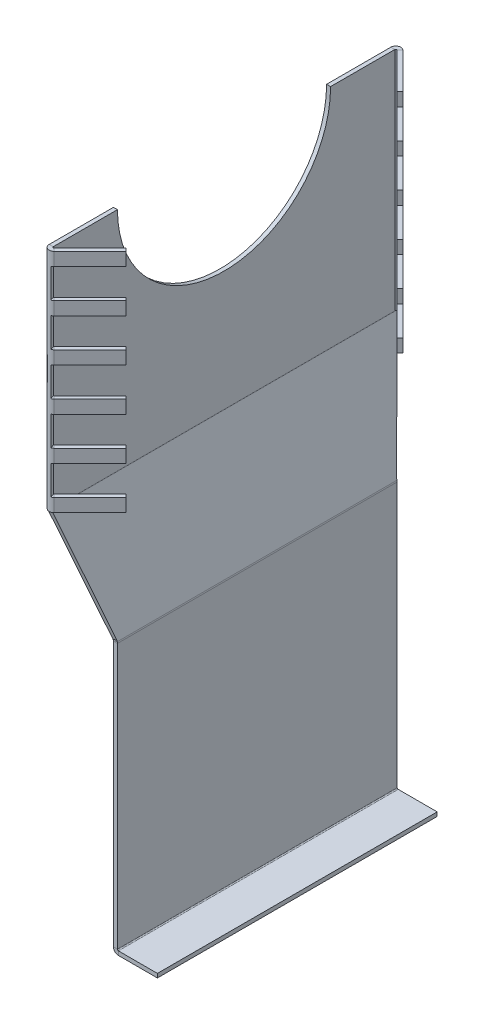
ISO-10303-21;
HEADER;
FILE_DESCRIPTION(('STEP AP214'),'2;1');
FILE_NAME('part.step','',(''),(''),'','','');
FILE_SCHEMA(('AUTOMOTIVE_DESIGN { 1 0 10303 214 1 1 1 1 }'));
ENDSEC;
DATA;
#1=APPLICATION_CONTEXT('core data for automotive mechanical design processes');
#2=APPLICATION_PROTOCOL_DEFINITION('international standard','automotive_design',2000,#1);
#3=PRODUCT_CONTEXT('',#1,'mechanical');
#4=PRODUCT('Part','Part','',(#3));
#5=PRODUCT_RELATED_PRODUCT_CATEGORY('part','',(#4));
#6=PRODUCT_DEFINITION_FORMATION('','',#4);
#7=PRODUCT_DEFINITION_CONTEXT('part definition',#1,'design');
#8=PRODUCT_DEFINITION('design','',#6,#7);
#9=PRODUCT_DEFINITION_SHAPE('','',#8);
#10=(LENGTH_UNIT() NAMED_UNIT(*) SI_UNIT(.MILLI.,.METRE.));
#11=(NAMED_UNIT(*) PLANE_ANGLE_UNIT() SI_UNIT($,.RADIAN.));
#12=(NAMED_UNIT(*) SI_UNIT($,.STERADIAN.) SOLID_ANGLE_UNIT());
#13=UNCERTAINTY_MEASURE_WITH_UNIT(LENGTH_MEASURE(1.E-05),#10,'distance_accuracy_value','');
#14=(GEOMETRIC_REPRESENTATION_CONTEXT(3) GLOBAL_UNCERTAINTY_ASSIGNED_CONTEXT((#13)) GLOBAL_UNIT_ASSIGNED_CONTEXT((#10,
#11,#12)) REPRESENTATION_CONTEXT('',''));
#15=CARTESIAN_POINT('',(0.,0.,0.));
#16=DIRECTION('',(0.,0.,1.));
#17=DIRECTION('',(1.,0.,0.));
#18=AXIS2_PLACEMENT_3D('',#15,#16,#17);
#19=CARTESIAN_POINT('',(-25.,286.458082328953,130.));
#20=DIRECTION('',(-1.,0.,0.));
#21=DIRECTION('',(0.,0.,1.));
#22=AXIS2_PLACEMENT_3D('',#19,#20,#21);
#23=PLANE('',#22);
#24=CARTESIAN_POINT('',(-25.,456.458082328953,0.));
#25=DIRECTION('',(1.,0.,0.));
#26=DIRECTION('',(0.,0.,-1.));
#27=AXIS2_PLACEMENT_3D('',#24,#25,#26);
#28=CIRCLE('',#27,80.);
#29=CARTESIAN_POINT('',(-25.,456.458082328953,80.));
#30=VERTEX_POINT('',#29);
#31=CARTESIAN_POINT('',(-25.,456.458082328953,-80.));
#32=VERTEX_POINT('',#31);
#33=EDGE_CURVE('E929',#30,#32,#28,.T.);
#34=ORIENTED_EDGE('',*,*,#33,.F.);
#35=DIRECTION('',(0.,0.,-1.));
#36=VECTOR('',#35,1.);
#37=CARTESIAN_POINT('',(-25.,456.458082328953,130.));
#38=LINE('',#37,#36);
#39=CARTESIAN_POINT('',(-25.,456.458082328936,128.18933982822));
#40=VERTEX_POINT('',#39);
#41=EDGE_CURVE('E363',#40,#30,#38,.T.);
#42=ORIENTED_EDGE('',*,*,#41,.F.);
#43=DIRECTION('',(0.,-1.,0.));
#44=VECTOR('',#43,1.);
#45=CARTESIAN_POINT('',(-25.,1305.92679467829,128.18933982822));
#46=LINE('',#45,#44);
#47=CARTESIAN_POINT('',(-25.,286.564339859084,128.18933982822));
#48=VERTEX_POINT('',#47);
#49=EDGE_CURVE('E1165',#40,#48,#46,.T.);
#50=ORIENTED_EDGE('',*,*,#49,.T.);
#51=DIRECTION('',(0.,0.,-1.));
#52=VECTOR('',#51,1.);
#53=CARTESIAN_POINT('',(-25.,286.564339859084,130.));
#54=LINE('',#53,#52);
#55=CARTESIAN_POINT('',(-25.,286.564339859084,-128.18933982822));
#56=VERTEX_POINT('',#55);
#57=EDGE_CURVE('E1291',#48,#56,#54,.T.);
#58=ORIENTED_EDGE('',*,*,#57,.T.);
#59=DIRECTION('',(0.,-1.,0.));
#60=VECTOR('',#59,1.);
#61=CARTESIAN_POINT('',(-25.,1305.92679467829,-128.18933982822));
#62=LINE('',#61,#60);
#63=CARTESIAN_POINT('',(-25.,456.458082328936,-128.18933982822));
#64=VERTEX_POINT('',#63);
#65=EDGE_CURVE('E1334',#64,#56,#62,.T.);
#66=ORIENTED_EDGE('',*,*,#65,.F.);
#67=DIRECTION('',(0.,0.,1.));
#68=VECTOR('',#67,1.);
#69=CARTESIAN_POINT('',(-25.,456.458082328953,-130.));
#70=LINE('',#69,#68);
#71=EDGE_CURVE('E944',#64,#32,#70,.T.);
#72=ORIENTED_EDGE('',*,*,#71,.T.);
#73=EDGE_LOOP('',(#34,#42,#50,#58,#66,#72));
#74=FACE_BOUND('',#73,.T.);
#75=ADVANCED_FACE('F356',(#74),#23,.F.);
#76=CARTESIAN_POINT('',(-28.,456.458082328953,130.));
#77=DIRECTION('',(0.,1.,0.));
#78=DIRECTION('',(0.,0.,1.));
#79=AXIS2_PLACEMENT_3D('',#76,#77,#78);
#80=PLANE('',#79);
#81=ORIENTED_EDGE('',*,*,#41,.T.);
#82=DIRECTION('',(-1.,0.,0.));
#83=VECTOR('',#82,1.);
#84=CARTESIAN_POINT('',(-28.,456.458082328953,80.));
#85=LINE('',#84,#83);
#86=CARTESIAN_POINT('',(-28.,456.458082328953,80.));
#87=VERTEX_POINT('',#86);
#88=EDGE_CURVE('E956',#87,#30,#85,.F.);
#89=ORIENTED_EDGE('',*,*,#88,.F.);
#90=DIRECTION('',(0.,0.,-1.));
#91=VECTOR('',#90,1.);
#92=CARTESIAN_POINT('',(-28.,456.458082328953,130.));
#93=LINE('',#92,#91);
#94=CARTESIAN_POINT('',(-28.,456.458082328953,128.18933982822));
#95=VERTEX_POINT('',#94);
#96=EDGE_CURVE('E926',#95,#87,#93,.T.);
#97=ORIENTED_EDGE('',*,*,#96,.F.);
#98=DIRECTION('',(-1.,0.,0.));
#99=VECTOR('',#98,1.);
#100=CARTESIAN_POINT('',(-25.,456.458082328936,128.18933982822));
#101=LINE('',#100,#99);
#102=EDGE_CURVE('E1185',#40,#95,#101,.T.);
#103=ORIENTED_EDGE('',*,*,#102,.F.);
#104=EDGE_LOOP('',(#81,#89,#97,#103));
#105=FACE_BOUND('',#104,.T.);
#106=ADVANCED_FACE('F1328',(#105),#80,.T.);
#107=CARTESIAN_POINT('',(-28.,286.458082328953,130.));
#108=DIRECTION('',(-1.,0.,0.));
#109=DIRECTION('',(0.,0.,1.));
#110=AXIS2_PLACEMENT_3D('',#107,#108,#109);
#111=PLANE('',#110);
#112=ORIENTED_EDGE('',*,*,#96,.T.);
#113=CARTESIAN_POINT('',(-28.,456.458082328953,0.));
#114=DIRECTION('',(1.,0.,0.));
#115=DIRECTION('',(0.,0.,-1.));
#116=AXIS2_PLACEMENT_3D('',#113,#114,#115);
#117=CIRCLE('',#116,80.);
#118=CARTESIAN_POINT('',(-28.,456.458082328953,-80.));
#119=VERTEX_POINT('',#118);
#120=EDGE_CURVE('E918',#87,#119,#117,.T.);
#121=ORIENTED_EDGE('',*,*,#120,.T.);
#122=DIRECTION('',(0.,0.,1.));
#123=VECTOR('',#122,1.);
#124=CARTESIAN_POINT('',(-28.,456.458082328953,-130.));
#125=LINE('',#124,#123);
#126=CARTESIAN_POINT('',(-28.,456.458082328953,-128.18933982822));
#127=VERTEX_POINT('',#126);
#128=EDGE_CURVE('E923',#127,#119,#125,.T.);
#129=ORIENTED_EDGE('',*,*,#128,.F.);
#130=DIRECTION('',(0.,-1.,0.));
#131=VECTOR('',#130,1.);
#132=CARTESIAN_POINT('',(-28.,1305.92679467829,-128.18933982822));
#133=LINE('',#132,#131);
#134=CARTESIAN_POINT('',(-28.,286.564339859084,-128.18933982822));
#135=VERTEX_POINT('',#134);
#136=EDGE_CURVE('E1349',#127,#135,#133,.T.);
#137=ORIENTED_EDGE('',*,*,#136,.T.);
#138=DIRECTION('',(0.,0.,-1.));
#139=VECTOR('',#138,1.);
#140=CARTESIAN_POINT('',(-28.,286.564339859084,130.));
#141=LINE('',#140,#139);
#142=CARTESIAN_POINT('',(-28.,286.564339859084,128.18933982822));
#143=VERTEX_POINT('',#142);
#144=EDGE_CURVE('E1321',#143,#135,#141,.T.);
#145=ORIENTED_EDGE('',*,*,#144,.F.);
#146=DIRECTION('',(0.,-1.,0.));
#147=VECTOR('',#146,1.);
#148=CARTESIAN_POINT('',(-28.,1305.92679467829,128.18933982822));
#149=LINE('',#148,#147);
#150=EDGE_CURVE('E1175',#95,#143,#149,.T.);
#151=ORIENTED_EDGE('',*,*,#150,.F.);
#152=EDGE_LOOP('',(#112,#121,#129,#137,#145,#151));
#153=FACE_BOUND('',#152,.T.);
#154=ADVANCED_FACE('F920',(#153),#111,.T.);
#155=CARTESIAN_POINT('',(-24.25,1305.92679467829,128.18933982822));
#156=DIRECTION('',(0.,-1.,0.));
#157=DIRECTION('',(0.,0.,-1.));
#158=AXIS2_PLACEMENT_3D('',#155,#156,#157);
#159=CYLINDRICAL_SURFACE('',#158,3.75);
#160=DIRECTION('',(0.,1.,0.));
#161=VECTOR('',#160,1.);
#162=CARTESIAN_POINT('',(-21.5983495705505,456.458082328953,130.84099025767));
#163=LINE('',#162,#161);
#164=CARTESIAN_POINT('',(-21.5983495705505,424.458082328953,130.84099025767));
#165=VERTEX_POINT('',#164);
#166=CARTESIAN_POINT('',(-21.5983495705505,414.458082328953,130.84099025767));
#167=VERTEX_POINT('',#166);
#168=EDGE_CURVE('E1211',#165,#167,#163,.F.);
#169=ORIENTED_EDGE('',*,*,#168,.F.);
#170=CARTESIAN_POINT('',(-24.25,424.458082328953,128.18933982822));
#171=DIRECTION('',(0.,-1.,0.));
#172=DIRECTION('',(0.,0.,-1.));
#173=AXIS2_PLACEMENT_3D('',#170,#171,#172);
#174=CIRCLE('',#173,3.75);
#175=CARTESIAN_POINT('',(-23.208260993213,424.458082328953,131.791739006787));
#176=VERTEX_POINT('',#175);
#177=EDGE_CURVE('E962',#176,#165,#174,.F.);
#178=ORIENTED_EDGE('',*,*,#177,.F.);
#179=DIRECTION('',(0.,-1.,0.));
#180=VECTOR('',#179,1.);
#181=CARTESIAN_POINT('',(-23.208260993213,1305.92679467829,131.791739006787));
#182=LINE('',#181,#180);
#183=CARTESIAN_POINT('',(-23.208260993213,446.458082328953,131.791739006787));
#184=VERTEX_POINT('',#183);
#185=EDGE_CURVE('E960',#184,#176,#182,.T.);
#186=ORIENTED_EDGE('',*,*,#185,.F.);
#187=CARTESIAN_POINT('',(-24.25,446.458082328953,128.18933982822));
#188=DIRECTION('',(0.,1.,0.));
#189=DIRECTION('',(0.,0.,1.));
#190=AXIS2_PLACEMENT_3D('',#187,#188,#189);
#191=CIRCLE('',#190,3.75);
#192=CARTESIAN_POINT('',(-21.5983495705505,446.458082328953,130.84099025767));
#193=VERTEX_POINT('',#192);
#194=EDGE_CURVE('E958',#193,#184,#191,.F.);
#195=ORIENTED_EDGE('',*,*,#194,.F.);
#196=CARTESIAN_POINT('',(-21.5983495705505,456.458082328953,130.84099025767));
#197=VERTEX_POINT('',#196);
#198=EDGE_CURVE('E1207',#197,#193,#163,.F.);
#199=ORIENTED_EDGE('',*,*,#198,.F.);
#200=CARTESIAN_POINT('',(-24.25,456.458082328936,128.18933982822));
#201=DIRECTION('',(0.,1.,-3.16113801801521E-11));
#202=DIRECTION('',(0.,3.16113801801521E-11,1.));
#203=AXIS2_PLACEMENT_3D('',#200,#201,#202);
#204=CIRCLE('',#203,3.75);
#205=EDGE_CURVE('E1179',#197,#95,#204,.F.);
#206=ORIENTED_EDGE('',*,*,#205,.T.);
#207=ORIENTED_EDGE('',*,*,#150,.T.);
#208=CARTESIAN_POINT('',(-24.25,286.564339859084,128.18933982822));
#209=DIRECTION('',(0.,-1.,0.));
#210=DIRECTION('',(0.,0.,-1.));
#211=AXIS2_PLACEMENT_3D('',#208,#209,#210);
#212=CIRCLE('',#211,3.75);
#213=CARTESIAN_POINT('',(-27.533901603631,286.564339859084,130.));
#214=VERTEX_POINT('',#213);
#215=EDGE_CURVE('E1176',#143,#214,#212,.F.);
#216=ORIENTED_EDGE('',*,*,#215,.T.);
#217=CARTESIAN_POINT('',(-21.5983495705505,286.564339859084,130.84099025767));
#218=VERTEX_POINT('',#217);
#219=EDGE_CURVE('E1180',#214,#218,#212,.F.);
#220=ORIENTED_EDGE('',*,*,#219,.T.);
#221=CARTESIAN_POINT('',(-21.5983495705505,296.458082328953,130.84099025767));
#222=VERTEX_POINT('',#221);
#223=EDGE_CURVE('E1216',#222,#218,#163,.F.);
#224=ORIENTED_EDGE('',*,*,#223,.F.);
#225=CARTESIAN_POINT('',(-24.25,296.458082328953,128.18933982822));
#226=DIRECTION('',(0.,-1.,0.));
#227=DIRECTION('',(1.,0.,0.));
#228=AXIS2_PLACEMENT_3D('',#225,#226,#227);
#229=CIRCLE('',#228,3.75);
#230=CARTESIAN_POINT('',(-23.2082609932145,296.458082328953,131.791739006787));
#231=VERTEX_POINT('',#230);
#232=EDGE_CURVE('E1003',#231,#222,#229,.F.);
#233=ORIENTED_EDGE('',*,*,#232,.F.);
#234=DIRECTION('',(0.,-1.,0.));
#235=VECTOR('',#234,1.);
#236=CARTESIAN_POINT('',(-23.2082609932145,1305.92679467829,131.791739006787));
#237=LINE('',#236,#235);
#238=CARTESIAN_POINT('',(-23.2082609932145,318.458082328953,131.791739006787));
#239=VERTEX_POINT('',#238);
#240=EDGE_CURVE('E1001',#239,#231,#237,.T.);
#241=ORIENTED_EDGE('',*,*,#240,.F.);
#242=CARTESIAN_POINT('',(-24.25,318.458082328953,128.18933982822));
#243=DIRECTION('',(0.,1.,0.));
#244=DIRECTION('',(-1.,0.,0.));
#245=AXIS2_PLACEMENT_3D('',#242,#243,#244);
#246=CIRCLE('',#245,3.75);
#247=CARTESIAN_POINT('',(-21.5983495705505,318.458082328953,130.84099025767));
#248=VERTEX_POINT('',#247);
#249=EDGE_CURVE('E998',#248,#239,#246,.F.);
#250=ORIENTED_EDGE('',*,*,#249,.F.);
#251=CARTESIAN_POINT('',(-21.5983495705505,328.458082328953,130.84099025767));
#252=VERTEX_POINT('',#251);
#253=EDGE_CURVE('E3149',#252,#248,#163,.F.);
#254=ORIENTED_EDGE('',*,*,#253,.F.);
#255=CARTESIAN_POINT('',(-24.25,328.458082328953,128.18933982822));
#256=DIRECTION('',(0.,-1.,0.));
#257=DIRECTION('',(1.,0.,0.));
#258=AXIS2_PLACEMENT_3D('',#255,#256,#257);
#259=CIRCLE('',#258,3.75);
#260=CARTESIAN_POINT('',(-23.2082609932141,328.458082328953,131.791739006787));
#261=VERTEX_POINT('',#260);
#262=EDGE_CURVE('E1044',#261,#252,#259,.F.);
#263=ORIENTED_EDGE('',*,*,#262,.F.);
#264=DIRECTION('',(0.,-1.,0.));
#265=VECTOR('',#264,1.);
#266=CARTESIAN_POINT('',(-23.2082609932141,1305.92679467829,131.791739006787));
#267=LINE('',#266,#265);
#268=CARTESIAN_POINT('',(-23.2082609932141,350.458082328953,131.791739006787));
#269=VERTEX_POINT('',#268);
#270=EDGE_CURVE('E1042',#269,#261,#267,.T.);
#271=ORIENTED_EDGE('',*,*,#270,.F.);
#272=CARTESIAN_POINT('',(-24.25,350.458082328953,128.18933982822));
#273=DIRECTION('',(0.,1.,0.));
#274=DIRECTION('',(-1.,0.,0.));
#275=AXIS2_PLACEMENT_3D('',#272,#273,#274);
#276=CIRCLE('',#275,3.75);
#277=CARTESIAN_POINT('',(-21.5983495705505,350.458082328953,130.84099025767));
#278=VERTEX_POINT('',#277);
#279=EDGE_CURVE('E1038',#278,#269,#276,.F.);
#280=ORIENTED_EDGE('',*,*,#279,.F.);
#281=CARTESIAN_POINT('',(-21.5983495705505,360.458082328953,130.84099025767));
#282=VERTEX_POINT('',#281);
#283=EDGE_CURVE('E3120',#282,#278,#163,.F.);
#284=ORIENTED_EDGE('',*,*,#283,.F.);
#285=CARTESIAN_POINT('',(-24.25,360.458082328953,128.18933982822));
#286=DIRECTION('',(0.,-1.,0.));
#287=DIRECTION('',(1.,0.,0.));
#288=AXIS2_PLACEMENT_3D('',#285,#286,#287);
#289=CIRCLE('',#288,3.75);
#290=CARTESIAN_POINT('',(-23.2082609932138,360.458082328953,131.791739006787));
#291=VERTEX_POINT('',#290);
#292=EDGE_CURVE('E1086',#291,#282,#289,.F.);
#293=ORIENTED_EDGE('',*,*,#292,.F.);
#294=DIRECTION('',(0.,-1.,0.));
#295=VECTOR('',#294,1.);
#296=CARTESIAN_POINT('',(-23.2082609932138,1305.92679467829,131.791739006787));
#297=LINE('',#296,#295);
#298=CARTESIAN_POINT('',(-23.2082609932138,382.458082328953,131.791739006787));
#299=VERTEX_POINT('',#298);
#300=EDGE_CURVE('E1084',#299,#291,#297,.T.);
#301=ORIENTED_EDGE('',*,*,#300,.F.);
#302=CARTESIAN_POINT('',(-24.25,382.458082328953,128.18933982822));
#303=DIRECTION('',(0.,1.,0.));
#304=DIRECTION('',(-1.,0.,0.));
#305=AXIS2_PLACEMENT_3D('',#302,#303,#304);
#306=CIRCLE('',#305,3.75);
#307=CARTESIAN_POINT('',(-21.5983495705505,382.458082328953,130.84099025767));
#308=VERTEX_POINT('',#307);
#309=EDGE_CURVE('E1080',#308,#299,#306,.F.);
#310=ORIENTED_EDGE('',*,*,#309,.F.);
#311=CARTESIAN_POINT('',(-21.5983495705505,392.458082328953,130.84099025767));
#312=VERTEX_POINT('',#311);
#313=EDGE_CURVE('E1212',#312,#308,#163,.F.);
#314=ORIENTED_EDGE('',*,*,#313,.F.);
#315=CARTESIAN_POINT('',(-24.25,392.458082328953,128.18933982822));
#316=DIRECTION('',(0.,-1.,0.));
#317=DIRECTION('',(0.,0.,-1.));
#318=AXIS2_PLACEMENT_3D('',#315,#316,#317);
#319=CIRCLE('',#318,3.75);
#320=CARTESIAN_POINT('',(-23.2082609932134,392.458082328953,131.791739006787));
#321=VERTEX_POINT('',#320);
#322=EDGE_CURVE('E1128',#321,#312,#319,.F.);
#323=ORIENTED_EDGE('',*,*,#322,.F.);
#324=DIRECTION('',(0.,-1.,0.));
#325=VECTOR('',#324,1.);
#326=CARTESIAN_POINT('',(-23.2082609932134,1305.92679467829,131.791739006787));
#327=LINE('',#326,#325);
#328=CARTESIAN_POINT('',(-23.2082609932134,414.458082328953,131.791739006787));
#329=VERTEX_POINT('',#328);
#330=EDGE_CURVE('E1126',#329,#321,#327,.T.);
#331=ORIENTED_EDGE('',*,*,#330,.F.);
#332=CARTESIAN_POINT('',(-24.25,414.458082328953,128.18933982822));
#333=DIRECTION('',(0.,1.,0.));
#334=DIRECTION('',(0.,0.,1.));
#335=AXIS2_PLACEMENT_3D('',#332,#333,#334);
#336=CIRCLE('',#335,3.75);
#337=EDGE_CURVE('E1122',#167,#329,#336,.F.);
#338=ORIENTED_EDGE('',*,*,#337,.F.);
#339=EDGE_LOOP('',(#169,#178,#186,#195,#199,#206,#207,#216,#220,#224,#233,#241,#250,#254,#263,
#271,#280,#284,#293,#301,#310,#314,#323,#331,#338));
#340=FACE_BOUND('',#339,.T.);
#341=ADVANCED_FACE('F1761',(#340),#159,.T.);
#342=CARTESIAN_POINT('',(-24.25,1305.92679467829,128.18933982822));
#343=DIRECTION('',(0.,-1.,0.));
#344=DIRECTION('',(0.,0.,-1.));
#345=AXIS2_PLACEMENT_3D('',#342,#343,#344);
#346=CYLINDRICAL_SURFACE('',#345,0.75);
#347=CARTESIAN_POINT('',(-24.25,424.458082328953,128.18933982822));
#348=DIRECTION('',(0.,-1.,0.));
#349=DIRECTION('',(0.,0.,-1.));
#350=AXIS2_PLACEMENT_3D('',#347,#348,#349);
#351=CIRCLE('',#350,0.75);
#352=CARTESIAN_POINT('',(-24.0416521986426,424.458082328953,128.909819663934));
#353=VERTEX_POINT('',#352);
#354=CARTESIAN_POINT('',(-23.7196699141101,424.458082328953,128.71966991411));
#355=VERTEX_POINT('',#354);
#356=EDGE_CURVE('E965',#353,#355,#351,.F.);
#357=ORIENTED_EDGE('',*,*,#356,.T.);
#358=DIRECTION('',(0.,-1.,0.));
#359=VECTOR('',#358,1.);
#360=CARTESIAN_POINT('',(-23.7196699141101,456.458082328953,128.71966991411));
#361=LINE('',#360,#359);
#362=CARTESIAN_POINT('',(-23.7196699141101,414.458082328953,128.71966991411));
#363=VERTEX_POINT('',#362);
#364=EDGE_CURVE('E1202',#355,#363,#361,.T.);
#365=ORIENTED_EDGE('',*,*,#364,.T.);
#366=CARTESIAN_POINT('',(-24.25,414.458082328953,128.18933982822));
#367=DIRECTION('',(0.,-1.,0.));
#368=DIRECTION('',(0.,0.,-1.));
#369=AXIS2_PLACEMENT_3D('',#366,#367,#368);
#370=CIRCLE('',#369,0.75);
#371=CARTESIAN_POINT('',(-24.0416521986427,414.458082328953,128.909819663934));
#372=VERTEX_POINT('',#371);
#373=EDGE_CURVE('E1131',#363,#372,#370,.T.);
#374=ORIENTED_EDGE('',*,*,#373,.T.);
#375=DIRECTION('',(0.,-1.,0.));
#376=VECTOR('',#375,1.);
#377=CARTESIAN_POINT('',(-24.0416521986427,1305.92679467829,128.909819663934));
#378=LINE('',#377,#376);
#379=CARTESIAN_POINT('',(-24.0416521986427,392.458082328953,128.909819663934));
#380=VERTEX_POINT('',#379);
#381=EDGE_CURVE('E1136',#372,#380,#378,.T.);
#382=ORIENTED_EDGE('',*,*,#381,.T.);
#383=CARTESIAN_POINT('',(-24.25,392.458082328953,128.18933982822));
#384=DIRECTION('',(0.,-1.,0.));
#385=DIRECTION('',(0.,0.,-1.));
#386=AXIS2_PLACEMENT_3D('',#383,#384,#385);
#387=CIRCLE('',#386,0.75);
#388=CARTESIAN_POINT('',(-23.7196699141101,392.458082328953,128.71966991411));
#389=VERTEX_POINT('',#388);
#390=EDGE_CURVE('E1132',#380,#389,#387,.F.);
#391=ORIENTED_EDGE('',*,*,#390,.T.);
#392=CARTESIAN_POINT('',(-23.7196699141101,382.458082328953,128.71966991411));
#393=VERTEX_POINT('',#392);
#394=EDGE_CURVE('E1203',#389,#393,#361,.T.);
#395=ORIENTED_EDGE('',*,*,#394,.T.);
#396=CARTESIAN_POINT('',(-24.25,382.458082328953,128.18933982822));
#397=DIRECTION('',(0.,-1.,0.));
#398=DIRECTION('',(0.,0.,-1.));
#399=AXIS2_PLACEMENT_3D('',#396,#397,#398);
#400=CIRCLE('',#399,0.75);
#401=CARTESIAN_POINT('',(-24.0416521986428,382.458082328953,128.909819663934));
#402=VERTEX_POINT('',#401);
#403=EDGE_CURVE('E1089',#393,#402,#400,.T.);
#404=ORIENTED_EDGE('',*,*,#403,.T.);
#405=DIRECTION('',(0.,-1.,0.));
#406=VECTOR('',#405,1.);
#407=CARTESIAN_POINT('',(-24.0416521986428,1305.92679467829,128.909819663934));
#408=LINE('',#407,#406);
#409=CARTESIAN_POINT('',(-24.0416521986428,360.458082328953,128.909819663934));
#410=VERTEX_POINT('',#409);
#411=EDGE_CURVE('E1094',#402,#410,#408,.T.);
#412=ORIENTED_EDGE('',*,*,#411,.T.);
#413=CARTESIAN_POINT('',(-24.25,360.458082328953,128.18933982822));
#414=DIRECTION('',(0.,-1.,0.));
#415=DIRECTION('',(0.,0.,-1.));
#416=AXIS2_PLACEMENT_3D('',#413,#414,#415);
#417=CIRCLE('',#416,0.75);
#418=CARTESIAN_POINT('',(-23.7196699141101,360.458082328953,128.71966991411));
#419=VERTEX_POINT('',#418);
#420=EDGE_CURVE('E1090',#410,#419,#417,.F.);
#421=ORIENTED_EDGE('',*,*,#420,.T.);
#422=CARTESIAN_POINT('',(-23.7196699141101,350.458082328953,128.71966991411));
#423=VERTEX_POINT('',#422);
#424=EDGE_CURVE('E3052',#419,#423,#361,.T.);
#425=ORIENTED_EDGE('',*,*,#424,.T.);
#426=CARTESIAN_POINT('',(-24.25,350.458082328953,128.18933982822));
#427=DIRECTION('',(0.,-1.,0.));
#428=DIRECTION('',(0.,0.,-1.));
#429=AXIS2_PLACEMENT_3D('',#426,#427,#428);
#430=CIRCLE('',#429,0.75);
#431=CARTESIAN_POINT('',(-24.0416521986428,350.458082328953,128.909819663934));
#432=VERTEX_POINT('',#431);
#433=EDGE_CURVE('E1047',#423,#432,#430,.T.);
#434=ORIENTED_EDGE('',*,*,#433,.T.);
#435=DIRECTION('',(0.,-1.,0.));
#436=VECTOR('',#435,1.);
#437=CARTESIAN_POINT('',(-24.0416521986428,1305.92679467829,128.909819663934));
#438=LINE('',#437,#436);
#439=CARTESIAN_POINT('',(-24.0416521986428,328.458082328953,128.909819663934));
#440=VERTEX_POINT('',#439);
#441=EDGE_CURVE('E1052',#432,#440,#438,.T.);
#442=ORIENTED_EDGE('',*,*,#441,.T.);
#443=CARTESIAN_POINT('',(-24.25,328.458082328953,128.18933982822));
#444=DIRECTION('',(0.,-1.,0.));
#445=DIRECTION('',(0.,0.,-1.));
#446=AXIS2_PLACEMENT_3D('',#443,#444,#445);
#447=CIRCLE('',#446,0.75);
#448=CARTESIAN_POINT('',(-23.7196699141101,328.458082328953,128.71966991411));
#449=VERTEX_POINT('',#448);
#450=EDGE_CURVE('E1048',#440,#449,#447,.F.);
#451=ORIENTED_EDGE('',*,*,#450,.T.);
#452=CARTESIAN_POINT('',(-23.7196699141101,318.458082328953,128.71966991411));
#453=VERTEX_POINT('',#452);
#454=EDGE_CURVE('E3054',#449,#453,#361,.T.);
#455=ORIENTED_EDGE('',*,*,#454,.T.);
#456=CARTESIAN_POINT('',(-24.25,318.458082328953,128.18933982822));
#457=DIRECTION('',(0.,-1.,0.));
#458=DIRECTION('',(0.,0.,-1.));
#459=AXIS2_PLACEMENT_3D('',#456,#457,#458);
#460=CIRCLE('',#459,0.75);
#461=CARTESIAN_POINT('',(-24.0416521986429,318.458082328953,128.909819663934));
#462=VERTEX_POINT('',#461);
#463=EDGE_CURVE('E1006',#453,#462,#460,.T.);
#464=ORIENTED_EDGE('',*,*,#463,.T.);
#465=DIRECTION('',(0.,-1.,0.));
#466=VECTOR('',#465,1.);
#467=CARTESIAN_POINT('',(-24.0416521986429,1305.92679467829,128.909819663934));
#468=LINE('',#467,#466);
#469=CARTESIAN_POINT('',(-24.0416521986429,296.458082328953,128.909819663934));
#470=VERTEX_POINT('',#469);
#471=EDGE_CURVE('E1011',#462,#470,#468,.T.);
#472=ORIENTED_EDGE('',*,*,#471,.T.);
#473=CARTESIAN_POINT('',(-24.25,296.458082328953,128.18933982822));
#474=DIRECTION('',(0.,-1.,0.));
#475=DIRECTION('',(0.,0.,-1.));
#476=AXIS2_PLACEMENT_3D('',#473,#474,#475);
#477=CIRCLE('',#476,0.75);
#478=CARTESIAN_POINT('',(-23.7196699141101,296.458082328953,128.71966991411));
#479=VERTEX_POINT('',#478);
#480=EDGE_CURVE('E1007',#470,#479,#477,.F.);
#481=ORIENTED_EDGE('',*,*,#480,.T.);
#482=CARTESIAN_POINT('',(-23.7196699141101,286.564339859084,128.71966991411));
#483=VERTEX_POINT('',#482);
#484=EDGE_CURVE('E1192',#479,#483,#361,.T.);
#485=ORIENTED_EDGE('',*,*,#484,.T.);
#486=CARTESIAN_POINT('',(-24.25,286.564339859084,128.18933982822));
#487=DIRECTION('',(0.,-1.,0.));
#488=DIRECTION('',(0.,0.,-1.));
#489=AXIS2_PLACEMENT_3D('',#486,#487,#488);
#490=CIRCLE('',#489,0.75);
#491=EDGE_CURVE('E1169',#48,#483,#490,.F.);
#492=ORIENTED_EDGE('',*,*,#491,.F.);
#493=ORIENTED_EDGE('',*,*,#49,.F.);
#494=CARTESIAN_POINT('',(-24.25,456.458082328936,128.18933982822));
#495=DIRECTION('',(0.,1.,-3.16113801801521E-11));
#496=DIRECTION('',(0.,3.16113801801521E-11,1.));
#497=AXIS2_PLACEMENT_3D('',#494,#495,#496);
#498=CIRCLE('',#497,0.75);
#499=CARTESIAN_POINT('',(-23.7196699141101,456.458082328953,128.71966991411));
#500=VERTEX_POINT('',#499);
#501=EDGE_CURVE('E1172',#500,#40,#498,.F.);
#502=ORIENTED_EDGE('',*,*,#501,.F.);
#503=CARTESIAN_POINT('',(-23.7196699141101,446.458082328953,128.71966991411));
#504=VERTEX_POINT('',#503);
#505=EDGE_CURVE('E1198',#500,#504,#361,.T.);
#506=ORIENTED_EDGE('',*,*,#505,.T.);
#507=CARTESIAN_POINT('',(-24.25,446.458082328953,128.18933982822));
#508=DIRECTION('',(0.,-1.,0.));
#509=DIRECTION('',(0.,0.,-1.));
#510=AXIS2_PLACEMENT_3D('',#507,#508,#509);
#511=CIRCLE('',#510,0.75);
#512=CARTESIAN_POINT('',(-24.0416521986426,446.458082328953,128.909819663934));
#513=VERTEX_POINT('',#512);
#514=EDGE_CURVE('E964',#504,#513,#511,.T.);
#515=ORIENTED_EDGE('',*,*,#514,.T.);
#516=DIRECTION('',(0.,-1.,0.));
#517=VECTOR('',#516,1.);
#518=CARTESIAN_POINT('',(-24.0416521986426,1305.92679467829,128.909819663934));
#519=LINE('',#518,#517);
#520=EDGE_CURVE('E969',#513,#353,#519,.T.);
#521=ORIENTED_EDGE('',*,*,#520,.T.);
#522=EDGE_LOOP('',(#357,#365,#374,#382,#391,#395,#404,#412,#421,#425,#434,#442,#451,#455,#464,
#472,#481,#485,#492,#493,#502,#506,#515,#521));
#523=FACE_BOUND('',#522,.T.);
#524=ADVANCED_FACE('F1894',(#523),#346,.F.);
#525=CARTESIAN_POINT('',(3.28427124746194,456.458082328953,101.715728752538));
#526=DIRECTION('',(-0.707106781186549,0.,0.707106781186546));
#527=DIRECTION('',(0.,-1.,0.));
#528=AXIS2_PLACEMENT_3D('',#525,#526,#527);
#529=PLANE('',#528);
#530=DIRECTION('',(0.,-1.,0.));
#531=VECTOR('',#530,1.);
#532=CARTESIAN_POINT('',(3.28427124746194,456.458082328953,101.715728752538));
#533=LINE('',#532,#531);
#534=CARTESIAN_POINT('',(3.28427124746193,424.458082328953,101.715728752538));
#535=VERTEX_POINT('',#534);
#536=CARTESIAN_POINT('',(3.28427124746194,414.458082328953,101.715728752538));
#537=VERTEX_POINT('',#536);
#538=EDGE_CURVE('E1196',#535,#537,#533,.T.);
#539=ORIENTED_EDGE('',*,*,#538,.F.);
#540=DIRECTION('',(-0.707106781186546,0.,-0.707106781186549));
#541=VECTOR('',#540,1.);
#542=CARTESIAN_POINT('',(3.28427124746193,424.458082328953,101.715728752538));
#543=LINE('',#542,#541);
#544=CARTESIAN_POINT('',(5.40559159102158,424.458082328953,103.837049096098));
#545=VERTEX_POINT('',#544);
#546=EDGE_CURVE('E995',#535,#545,#543,.F.);
#547=ORIENTED_EDGE('',*,*,#546,.T.);
#548=DIRECTION('',(0.,1.,0.));
#549=VECTOR('',#548,1.);
#550=CARTESIAN_POINT('',(5.40559159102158,456.458082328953,103.837049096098));
#551=LINE('',#550,#549);
#552=CARTESIAN_POINT('',(5.40559159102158,414.458082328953,103.837049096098));
#553=VERTEX_POINT('',#552);
#554=EDGE_CURVE('E1220',#545,#553,#551,.F.);
#555=ORIENTED_EDGE('',*,*,#554,.T.);
#556=DIRECTION('',(0.707106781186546,0.,0.707106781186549));
#557=VECTOR('',#556,1.);
#558=CARTESIAN_POINT('',(5.40559159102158,414.458082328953,103.837049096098));
#559=LINE('',#558,#557);
#560=EDGE_CURVE('E1154',#553,#537,#559,.F.);
#561=ORIENTED_EDGE('',*,*,#560,.T.);
#562=EDGE_LOOP('',(#539,#547,#555,#561));
#563=FACE_BOUND('',#562,.T.);
#564=ADVANCED_FACE('F1867',(#563),#529,.F.);
#565=CARTESIAN_POINT('',(5.40559159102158,456.458082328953,103.837049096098));
#566=VERTEX_POINT('',#565);
#567=CARTESIAN_POINT('',(5.40559159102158,446.458082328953,103.837049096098));
#568=VERTEX_POINT('',#567);
#569=EDGE_CURVE('E1217',#566,#568,#551,.F.);
#570=ORIENTED_EDGE('',*,*,#569,.T.);
#571=DIRECTION('',(-0.707106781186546,0.,-0.707106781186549));
#572=VECTOR('',#571,1.);
#573=CARTESIAN_POINT('',(3.28427124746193,446.458082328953,101.715728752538));
#574=LINE('',#573,#572);
#575=CARTESIAN_POINT('',(3.28427124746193,446.458082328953,101.715728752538));
#576=VERTEX_POINT('',#575);
#577=EDGE_CURVE('E990',#576,#568,#574,.F.);
#578=ORIENTED_EDGE('',*,*,#577,.F.);
#579=CARTESIAN_POINT('',(3.28427124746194,456.458082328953,101.715728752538));
#580=VERTEX_POINT('',#579);
#581=EDGE_CURVE('E1193',#580,#576,#533,.T.);
#582=ORIENTED_EDGE('',*,*,#581,.F.);
#583=DIRECTION('',(0.707106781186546,0.,0.707106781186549));
#584=VECTOR('',#583,1.);
#585=CARTESIAN_POINT('',(3.28427124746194,456.458082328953,101.715728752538));
#586=LINE('',#585,#584);
#587=EDGE_CURVE('E1227',#580,#566,#586,.T.);
#588=ORIENTED_EDGE('',*,*,#587,.T.);
#589=EDGE_LOOP('',(#570,#578,#582,#588));
#590=FACE_BOUND('',#589,.T.);
#591=ADVANCED_FACE('F2908',(#590),#529,.F.);
#592=CARTESIAN_POINT('',(5.40559159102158,456.458082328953,103.837049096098));
#593=DIRECTION('',(0.707106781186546,0.,0.707106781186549));
#594=DIRECTION('',(0.707106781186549,0.,-0.707106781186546));
#595=AXIS2_PLACEMENT_3D('',#592,#593,#594);
#596=PLANE('',#595);
#597=ORIENTED_EDGE('',*,*,#554,.F.);
#598=DIRECTION('',(0.707106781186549,0.,-0.707106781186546));
#599=VECTOR('',#598,1.);
#600=CARTESIAN_POINT('',(5.40559159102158,424.458082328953,103.837049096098));
#601=LINE('',#600,#599);
#602=EDGE_CURVE('E987',#545,#165,#601,.F.);
#603=ORIENTED_EDGE('',*,*,#602,.T.);
#604=ORIENTED_EDGE('',*,*,#168,.T.);
#605=DIRECTION('',(-0.707106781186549,0.,0.707106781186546));
#606=VECTOR('',#605,1.);
#607=CARTESIAN_POINT('',(5.40559159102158,414.458082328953,103.837049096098));
#608=LINE('',#607,#606);
#609=EDGE_CURVE('E1145',#553,#167,#608,.T.);
#610=ORIENTED_EDGE('',*,*,#609,.F.);
#611=EDGE_LOOP('',(#597,#603,#604,#610));
#612=FACE_BOUND('',#611,.T.);
#613=ADVANCED_FACE('F1877',(#612),#596,.T.);
#614=ORIENTED_EDGE('',*,*,#198,.T.);
#615=DIRECTION('',(0.707106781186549,0.,-0.707106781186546));
#616=VECTOR('',#615,1.);
#617=CARTESIAN_POINT('',(5.40559159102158,446.458082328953,103.837049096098));
#618=LINE('',#617,#616);
#619=EDGE_CURVE('E984',#193,#568,#618,.T.);
#620=ORIENTED_EDGE('',*,*,#619,.T.);
#621=ORIENTED_EDGE('',*,*,#569,.F.);
#622=DIRECTION('',(0.707106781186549,0.,-0.707106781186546));
#623=VECTOR('',#622,1.);
#624=CARTESIAN_POINT('',(5.40559159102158,456.458082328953,103.837049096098));
#625=LINE('',#624,#623);
#626=EDGE_CURVE('E1213',#566,#197,#625,.F.);
#627=ORIENTED_EDGE('',*,*,#626,.T.);
#628=EDGE_LOOP('',(#614,#620,#621,#627));
#629=FACE_BOUND('',#628,.T.);
#630=ADVANCED_FACE('F2920',(#629),#596,.T.);
#631=CARTESIAN_POINT('',(3.28427124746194,456.458082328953,101.715728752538));
#632=DIRECTION('',(0.707106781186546,0.,0.707106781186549));
#633=DIRECTION('',(0.707106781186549,0.,-0.707106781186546));
#634=AXIS2_PLACEMENT_3D('',#631,#632,#633);
#635=PLANE('',#634);
#636=DIRECTION('',(-0.707106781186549,0.,0.707106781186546));
#637=VECTOR('',#636,1.);
#638=CARTESIAN_POINT('',(16.8539574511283,424.458082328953,88.1460425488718));
#639=LINE('',#638,#637);
#640=EDGE_CURVE('E981',#535,#355,#639,.T.);
#641=ORIENTED_EDGE('',*,*,#640,.F.);
#642=ORIENTED_EDGE('',*,*,#538,.T.);
#643=DIRECTION('',(0.707106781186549,0.,-0.707106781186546));
#644=VECTOR('',#643,1.);
#645=CARTESIAN_POINT('',(3.28427124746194,414.458082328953,101.715728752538));
#646=LINE('',#645,#644);
#647=EDGE_CURVE('E1150',#537,#363,#646,.F.);
#648=ORIENTED_EDGE('',*,*,#647,.T.);
#649=ORIENTED_EDGE('',*,*,#364,.F.);
#650=EDGE_LOOP('',(#641,#642,#648,#649));
#651=FACE_BOUND('',#650,.T.);
#652=ADVANCED_FACE('F1884',(#651),#635,.F.);
#653=DIRECTION('',(0.707106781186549,0.,-0.707106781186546));
#654=VECTOR('',#653,1.);
#655=CARTESIAN_POINT('',(16.8539574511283,446.458082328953,88.1460425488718));
#656=LINE('',#655,#654);
#657=EDGE_CURVE('E979',#504,#576,#656,.T.);
#658=ORIENTED_EDGE('',*,*,#657,.F.);
#659=ORIENTED_EDGE('',*,*,#505,.F.);
#660=DIRECTION('',(-0.707106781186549,0.,0.707106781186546));
#661=VECTOR('',#660,1.);
#662=CARTESIAN_POINT('',(3.28427124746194,456.458082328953,101.715728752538));
#663=LINE('',#662,#661);
#664=EDGE_CURVE('E1189',#580,#500,#663,.T.);
#665=ORIENTED_EDGE('',*,*,#664,.F.);
#666=ORIENTED_EDGE('',*,*,#581,.T.);
#667=EDGE_LOOP('',(#658,#659,#665,#666));
#668=FACE_BOUND('',#667,.T.);
#669=ADVANCED_FACE('F1865',(#668),#635,.F.);
#670=CARTESIAN_POINT('',(3.28427124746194,296.458082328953,101.715728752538));
#671=VERTEX_POINT('',#670);
#672=CARTESIAN_POINT('',(3.28427124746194,286.564339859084,101.715728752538));
#673=VERTEX_POINT('',#672);
#674=EDGE_CURVE('E1188',#671,#673,#533,.T.);
#675=ORIENTED_EDGE('',*,*,#674,.F.);
#676=DIRECTION('',(0.707106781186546,0.,0.707106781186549));
#677=VECTOR('',#676,1.);
#678=CARTESIAN_POINT('',(5.40559159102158,296.458082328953,103.837049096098));
#679=LINE('',#678,#677);
#680=CARTESIAN_POINT('',(5.40559159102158,296.458082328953,103.837049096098));
#681=VERTEX_POINT('',#680);
#682=EDGE_CURVE('E1030',#681,#671,#679,.F.);
#683=ORIENTED_EDGE('',*,*,#682,.F.);
#684=CARTESIAN_POINT('',(5.40559159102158,286.564339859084,103.837049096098));
#685=VERTEX_POINT('',#684);
#686=EDGE_CURVE('E1206',#681,#685,#551,.F.);
#687=ORIENTED_EDGE('',*,*,#686,.T.);
#688=DIRECTION('',(0.707106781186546,0.,0.707106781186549));
#689=VECTOR('',#688,1.);
#690=CARTESIAN_POINT('',(3.28427124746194,286.564339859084,101.715728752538));
#691=LINE('',#690,#689);
#692=EDGE_CURVE('E1229',#673,#685,#691,.T.);
#693=ORIENTED_EDGE('',*,*,#692,.F.);
#694=EDGE_LOOP('',(#675,#683,#687,#693));
#695=FACE_BOUND('',#694,.T.);
#696=ADVANCED_FACE('F1861',(#695),#529,.F.);
#697=CARTESIAN_POINT('',(5.40559159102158,328.458082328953,103.837049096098));
#698=VERTEX_POINT('',#697);
#699=CARTESIAN_POINT('',(5.40559159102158,318.458082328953,103.837049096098));
#700=VERTEX_POINT('',#699);
#701=EDGE_CURVE('E3105',#698,#700,#551,.F.);
#702=ORIENTED_EDGE('',*,*,#701,.T.);
#703=DIRECTION('',(0.707106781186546,0.,0.707106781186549));
#704=VECTOR('',#703,1.);
#705=CARTESIAN_POINT('',(5.40559159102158,318.458082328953,103.837049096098));
#706=LINE('',#705,#704);
#707=CARTESIAN_POINT('',(3.28427124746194,318.458082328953,101.715728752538));
#708=VERTEX_POINT('',#707);
#709=EDGE_CURVE('E1027',#700,#708,#706,.F.);
#710=ORIENTED_EDGE('',*,*,#709,.T.);
#711=CARTESIAN_POINT('',(3.28427124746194,328.458082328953,101.715728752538));
#712=VERTEX_POINT('',#711);
#713=EDGE_CURVE('E3133',#712,#708,#533,.T.);
#714=ORIENTED_EDGE('',*,*,#713,.F.);
#715=DIRECTION('',(0.707106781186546,0.,0.707106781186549));
#716=VECTOR('',#715,1.);
#717=CARTESIAN_POINT('',(5.40559159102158,328.458082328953,103.837049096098));
#718=LINE('',#717,#716);
#719=EDGE_CURVE('E1072',#698,#712,#718,.F.);
#720=ORIENTED_EDGE('',*,*,#719,.F.);
#721=EDGE_LOOP('',(#702,#710,#714,#720));
#722=FACE_BOUND('',#721,.T.);
#723=ADVANCED_FACE('F1864',(#722),#529,.F.);
#724=ORIENTED_EDGE('',*,*,#686,.F.);
#725=DIRECTION('',(0.707106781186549,0.,-0.707106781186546));
#726=VECTOR('',#725,1.);
#727=CARTESIAN_POINT('',(5.40559159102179,296.458082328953,103.837049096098));
#728=LINE('',#727,#726);
#729=EDGE_CURVE('E1021',#222,#681,#728,.T.);
#730=ORIENTED_EDGE('',*,*,#729,.F.);
#731=ORIENTED_EDGE('',*,*,#223,.T.);
#732=DIRECTION('',(0.707106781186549,0.,-0.707106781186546));
#733=VECTOR('',#732,1.);
#734=CARTESIAN_POINT('',(5.40559159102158,286.564339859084,103.837049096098));
#735=LINE('',#734,#733);
#736=EDGE_CURVE('E1210',#218,#685,#735,.T.);
#737=ORIENTED_EDGE('',*,*,#736,.T.);
#738=EDGE_LOOP('',(#724,#730,#731,#737));
#739=FACE_BOUND('',#738,.T.);
#740=ADVANCED_FACE('F1872',(#739),#596,.T.);
#741=ORIENTED_EDGE('',*,*,#253,.T.);
#742=DIRECTION('',(-0.707106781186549,0.,0.707106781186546));
#743=VECTOR('',#742,1.);
#744=CARTESIAN_POINT('',(5.40559159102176,318.458082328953,103.837049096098));
#745=LINE('',#744,#743);
#746=EDGE_CURVE('E1019',#700,#248,#745,.T.);
#747=ORIENTED_EDGE('',*,*,#746,.F.);
#748=ORIENTED_EDGE('',*,*,#701,.F.);
#749=DIRECTION('',(0.707106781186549,0.,-0.707106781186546));
#750=VECTOR('',#749,1.);
#751=CARTESIAN_POINT('',(5.40559159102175,328.458082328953,103.837049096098));
#752=LINE('',#751,#750);
#753=EDGE_CURVE('E1063',#252,#698,#752,.T.);
#754=ORIENTED_EDGE('',*,*,#753,.F.);
#755=EDGE_LOOP('',(#741,#747,#748,#754));
#756=FACE_BOUND('',#755,.T.);
#757=ADVANCED_FACE('F1875',(#756),#596,.T.);
#758=DIRECTION('',(0.707106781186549,0.,-0.707106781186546));
#759=VECTOR('',#758,1.);
#760=CARTESIAN_POINT('',(3.28427124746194,296.458082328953,101.715728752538));
#761=LINE('',#760,#759);
#762=EDGE_CURVE('E1024',#479,#671,#761,.T.);
#763=ORIENTED_EDGE('',*,*,#762,.T.);
#764=ORIENTED_EDGE('',*,*,#674,.T.);
#765=DIRECTION('',(0.707106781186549,0.,-0.707106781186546));
#766=VECTOR('',#765,1.);
#767=CARTESIAN_POINT('',(3.28427124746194,286.564339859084,101.715728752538));
#768=LINE('',#767,#766);
#769=EDGE_CURVE('E1201',#483,#673,#768,.T.);
#770=ORIENTED_EDGE('',*,*,#769,.F.);
#771=ORIENTED_EDGE('',*,*,#484,.F.);
#772=EDGE_LOOP('',(#763,#764,#770,#771));
#773=FACE_BOUND('',#772,.T.);
#774=ADVANCED_FACE('F1879',(#773),#635,.F.);
#775=DIRECTION('',(0.707106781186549,0.,-0.707106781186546));
#776=VECTOR('',#775,1.);
#777=CARTESIAN_POINT('',(3.28427124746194,318.458082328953,101.715728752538));
#778=LINE('',#777,#776);
#779=EDGE_CURVE('E1023',#708,#453,#778,.F.);
#780=ORIENTED_EDGE('',*,*,#779,.T.);
#781=ORIENTED_EDGE('',*,*,#454,.F.);
#782=DIRECTION('',(0.707106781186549,0.,-0.707106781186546));
#783=VECTOR('',#782,1.);
#784=CARTESIAN_POINT('',(3.28427124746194,328.458082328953,101.715728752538));
#785=LINE('',#784,#783);
#786=EDGE_CURVE('E1066',#449,#712,#785,.T.);
#787=ORIENTED_EDGE('',*,*,#786,.T.);
#788=ORIENTED_EDGE('',*,*,#713,.T.);
#789=EDGE_LOOP('',(#780,#781,#787,#788));
#790=FACE_BOUND('',#789,.T.);
#791=ADVANCED_FACE('F1882',(#790),#635,.F.);
#792=CARTESIAN_POINT('',(5.40559159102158,360.458082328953,103.837049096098));
#793=VERTEX_POINT('',#792);
#794=CARTESIAN_POINT('',(5.40559159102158,350.458082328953,103.837049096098));
#795=VERTEX_POINT('',#794);
#796=EDGE_CURVE('E3104',#793,#795,#551,.F.);
#797=ORIENTED_EDGE('',*,*,#796,.T.);
#798=DIRECTION('',(0.707106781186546,0.,0.707106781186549));
#799=VECTOR('',#798,1.);
#800=CARTESIAN_POINT('',(5.40559159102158,350.458082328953,103.837049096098));
#801=LINE('',#800,#799);
#802=CARTESIAN_POINT('',(3.28427124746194,350.458082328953,101.715728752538));
#803=VERTEX_POINT('',#802);
#804=EDGE_CURVE('E1069',#795,#803,#801,.F.);
#805=ORIENTED_EDGE('',*,*,#804,.T.);
#806=CARTESIAN_POINT('',(3.28427124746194,360.458082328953,101.715728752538));
#807=VERTEX_POINT('',#806);
#808=EDGE_CURVE('E3136',#807,#803,#533,.T.);
#809=ORIENTED_EDGE('',*,*,#808,.F.);
#810=DIRECTION('',(0.707106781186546,0.,0.707106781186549));
#811=VECTOR('',#810,1.);
#812=CARTESIAN_POINT('',(5.40559159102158,360.458082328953,103.837049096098));
#813=LINE('',#812,#811);
#814=EDGE_CURVE('E1114',#793,#807,#813,.F.);
#815=ORIENTED_EDGE('',*,*,#814,.F.);
#816=EDGE_LOOP('',(#797,#805,#809,#815));
#817=FACE_BOUND('',#816,.T.);
#818=ADVANCED_FACE('F2946',(#817),#529,.F.);
#819=ORIENTED_EDGE('',*,*,#283,.T.);
#820=DIRECTION('',(-0.707106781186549,0.,0.707106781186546));
#821=VECTOR('',#820,1.);
#822=CARTESIAN_POINT('',(5.40559159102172,350.458082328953,103.837049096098));
#823=LINE('',#822,#821);
#824=EDGE_CURVE('E1061',#795,#278,#823,.T.);
#825=ORIENTED_EDGE('',*,*,#824,.F.);
#826=ORIENTED_EDGE('',*,*,#796,.F.);
#827=DIRECTION('',(0.707106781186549,0.,-0.707106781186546));
#828=VECTOR('',#827,1.);
#829=CARTESIAN_POINT('',(5.40559159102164,360.458082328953,103.837049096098));
#830=LINE('',#829,#828);
#831=EDGE_CURVE('E1105',#282,#793,#830,.T.);
#832=ORIENTED_EDGE('',*,*,#831,.F.);
#833=EDGE_LOOP('',(#819,#825,#826,#832));
#834=FACE_BOUND('',#833,.T.);
#835=ADVANCED_FACE('F2953',(#834),#596,.T.);
#836=DIRECTION('',(0.707106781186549,0.,-0.707106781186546));
#837=VECTOR('',#836,1.);
#838=CARTESIAN_POINT('',(3.28427124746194,350.458082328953,101.715728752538));
#839=LINE('',#838,#837);
#840=EDGE_CURVE('E1065',#803,#423,#839,.F.);
#841=ORIENTED_EDGE('',*,*,#840,.T.);
#842=ORIENTED_EDGE('',*,*,#424,.F.);
#843=DIRECTION('',(0.707106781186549,0.,-0.707106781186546));
#844=VECTOR('',#843,1.);
#845=CARTESIAN_POINT('',(3.28427124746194,360.458082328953,101.715728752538));
#846=LINE('',#845,#844);
#847=EDGE_CURVE('E1108',#419,#807,#846,.T.);
#848=ORIENTED_EDGE('',*,*,#847,.T.);
#849=ORIENTED_EDGE('',*,*,#808,.T.);
#850=EDGE_LOOP('',(#841,#842,#848,#849));
#851=FACE_BOUND('',#850,.T.);
#852=ADVANCED_FACE('F2960',(#851),#635,.F.);
#853=CARTESIAN_POINT('',(5.40559159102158,392.458082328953,103.837049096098));
#854=VERTEX_POINT('',#853);
#855=CARTESIAN_POINT('',(5.40559159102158,382.458082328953,103.837049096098));
#856=VERTEX_POINT('',#855);
#857=EDGE_CURVE('E1221',#854,#856,#551,.F.);
#858=ORIENTED_EDGE('',*,*,#857,.T.);
#859=DIRECTION('',(0.707106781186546,0.,0.707106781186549));
#860=VECTOR('',#859,1.);
#861=CARTESIAN_POINT('',(5.40559159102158,382.458082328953,103.837049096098));
#862=LINE('',#861,#860);
#863=CARTESIAN_POINT('',(3.28427124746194,382.458082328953,101.715728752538));
#864=VERTEX_POINT('',#863);
#865=EDGE_CURVE('E1111',#856,#864,#862,.F.);
#866=ORIENTED_EDGE('',*,*,#865,.T.);
#867=CARTESIAN_POINT('',(3.28427124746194,392.458082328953,101.715728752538));
#868=VERTEX_POINT('',#867);
#869=EDGE_CURVE('E1197',#868,#864,#533,.T.);
#870=ORIENTED_EDGE('',*,*,#869,.F.);
#871=DIRECTION('',(0.707106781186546,0.,0.707106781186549));
#872=VECTOR('',#871,1.);
#873=CARTESIAN_POINT('',(5.40559159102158,392.458082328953,103.837049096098));
#874=LINE('',#873,#872);
#875=EDGE_CURVE('E1157',#854,#868,#874,.F.);
#876=ORIENTED_EDGE('',*,*,#875,.F.);
#877=EDGE_LOOP('',(#858,#866,#870,#876));
#878=FACE_BOUND('',#877,.T.);
#879=ADVANCED_FACE('F1868',(#878),#529,.F.);
#880=ORIENTED_EDGE('',*,*,#313,.T.);
#881=DIRECTION('',(-0.707106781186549,0.,0.707106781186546));
#882=VECTOR('',#881,1.);
#883=CARTESIAN_POINT('',(5.40559159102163,382.458082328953,103.837049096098));
#884=LINE('',#883,#882);
#885=EDGE_CURVE('E1103',#856,#308,#884,.T.);
#886=ORIENTED_EDGE('',*,*,#885,.F.);
#887=ORIENTED_EDGE('',*,*,#857,.F.);
#888=DIRECTION('',(0.707106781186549,0.,-0.707106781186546));
#889=VECTOR('',#888,1.);
#890=CARTESIAN_POINT('',(5.40559159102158,392.458082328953,103.837049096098));
#891=LINE('',#890,#889);
#892=EDGE_CURVE('E1148',#312,#854,#891,.T.);
#893=ORIENTED_EDGE('',*,*,#892,.F.);
#894=EDGE_LOOP('',(#880,#886,#887,#893));
#895=FACE_BOUND('',#894,.T.);
#896=ADVANCED_FACE('F1878',(#895),#596,.T.);
#897=DIRECTION('',(0.707106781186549,0.,-0.707106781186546));
#898=VECTOR('',#897,1.);
#899=CARTESIAN_POINT('',(3.28427124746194,382.458082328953,101.715728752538));
#900=LINE('',#899,#898);
#901=EDGE_CURVE('E1107',#864,#393,#900,.F.);
#902=ORIENTED_EDGE('',*,*,#901,.T.);
#903=ORIENTED_EDGE('',*,*,#394,.F.);
#904=DIRECTION('',(0.707106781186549,0.,-0.707106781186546));
#905=VECTOR('',#904,1.);
#906=CARTESIAN_POINT('',(3.28427124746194,392.458082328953,101.715728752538));
#907=LINE('',#906,#905);
#908=EDGE_CURVE('E1151',#389,#868,#907,.T.);
#909=ORIENTED_EDGE('',*,*,#908,.T.);
#910=ORIENTED_EDGE('',*,*,#869,.T.);
#911=EDGE_LOOP('',(#902,#903,#909,#910));
#912=FACE_BOUND('',#911,.T.);
#913=ADVANCED_FACE('F1768',(#912),#635,.F.);
#914=CARTESIAN_POINT('',(-24.25,286.564339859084,130.));
#915=DIRECTION('',(0.,0.,-1.));
#916=DIRECTION('',(-1.,0.,0.));
#917=AXIS2_PLACEMENT_3D('',#914,#915,#916);
#918=CYLINDRICAL_SURFACE('',#917,3.75);
#919=DIRECTION('',(0.,0.,-1.));
#920=VECTOR('',#919,1.);
#921=CARTESIAN_POINT('',(-27.8524200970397,285.522673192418,130.));
#922=LINE('',#921,#920);
#923=CARTESIAN_POINT('',(-27.8524200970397,285.522673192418,129.697379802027));
#924=VERTEX_POINT('',#923);
#925=CARTESIAN_POINT('',(-27.8524200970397,285.522673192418,-129.697379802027));
#926=VERTEX_POINT('',#925);
#927=EDGE_CURVE('E1319',#924,#926,#922,.T.);
#928=ORIENTED_EDGE('',*,*,#927,.F.);
#929=CARTESIAN_POINT('',(-24.25,286.564339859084,130.));
#930=DIRECTION('',(0.,0.278980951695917,-0.960296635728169));
#931=DIRECTION('',(0.,-0.960296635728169,-0.278980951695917));
#932=AXIS2_PLACEMENT_3D('',#929,#930,#931);
#933=ELLIPSE('',#932,3.90504335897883,3.75);
#934=CARTESIAN_POINT('',(-28.,286.564339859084,130.));
#935=VERTEX_POINT('',#934);
#936=EDGE_CURVE('E1237',#935,#924,#933,.F.);
#937=ORIENTED_EDGE('',*,*,#936,.F.);
#938=EDGE_CURVE('E1322',#935,#143,#141,.T.);
#939=ORIENTED_EDGE('',*,*,#938,.T.);
#940=ORIENTED_EDGE('',*,*,#144,.T.);
#941=DIRECTION('',(0.,0.,1.));
#942=VECTOR('',#941,1.);
#943=CARTESIAN_POINT('',(-28.,286.564339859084,-130.));
#944=LINE('',#943,#942);
#945=CARTESIAN_POINT('',(-28.,286.564339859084,-130.));
#946=VERTEX_POINT('',#945);
#947=EDGE_CURVE('E945',#946,#135,#944,.T.);
#948=ORIENTED_EDGE('',*,*,#947,.F.);
#949=CARTESIAN_POINT('',(-24.25,286.564339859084,-130.));
#950=DIRECTION('',(0.,-0.278980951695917,-0.960296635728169));
#951=DIRECTION('',(0.,-0.960296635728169,0.278980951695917));
#952=AXIS2_PLACEMENT_3D('',#949,#950,#951);
#953=ELLIPSE('',#952,3.90504335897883,3.75);
#954=EDGE_CURVE('E1404',#946,#926,#953,.F.);
#955=ORIENTED_EDGE('',*,*,#954,.T.);
#956=EDGE_LOOP('',(#928,#937,#939,#940,#948,#955));
#957=FACE_BOUND('',#956,.T.);
#958=ADVANCED_FACE('F1764',(#957),#918,.T.);
#959=CARTESIAN_POINT('',(-2.88193607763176,199.166666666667,130.));
#960=DIRECTION('',(-0.960645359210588,-0.277777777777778,0.));
#961=DIRECTION('',(0.277777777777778,-0.960645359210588,0.));
#962=AXIS2_PLACEMENT_3D('',#959,#960,#961);
#963=PLANE('',#962);
#964=DIRECTION('',(0.277777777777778,-0.960645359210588,0.));
#965=VECTOR('',#964,1.);
#966=CARTESIAN_POINT('',(-2.88193607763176,199.166666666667,105.));
#967=LINE('',#966,#965);
#968=CARTESIAN_POINT('',(-3.27048053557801,200.51037901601,105.));
#969=VERTEX_POINT('',#968);
#970=CARTESIAN_POINT('',(-3.02951598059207,199.677045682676,105.));
#971=VERTEX_POINT('',#970);
#972=EDGE_CURVE('E1249',#969,#971,#967,.T.);
#973=ORIENTED_EDGE('',*,*,#972,.F.);
#974=DIRECTION('',(0.267553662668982,-0.92528706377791,-0.268810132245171));
#975=VECTOR('',#974,1.);
#976=CARTESIAN_POINT('',(-4.708040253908,205.481925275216,106.444310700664));
#977=LINE('',#976,#975);
#978=EDGE_CURVE('E1247',#924,#969,#977,.T.);
#979=ORIENTED_EDGE('',*,*,#978,.F.);
#980=ORIENTED_EDGE('',*,*,#927,.T.);
#981=DIRECTION('',(0.267553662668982,-0.92528706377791,0.268810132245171));
#982=VECTOR('',#981,1.);
#983=CARTESIAN_POINT('',(-4.708040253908,205.481925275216,-106.444310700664));
#984=LINE('',#983,#982);
#985=CARTESIAN_POINT('',(-3.27048053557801,200.51037901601,-105.));
#986=VERTEX_POINT('',#985);
#987=EDGE_CURVE('E1416',#926,#986,#984,.T.);
#988=ORIENTED_EDGE('',*,*,#987,.T.);
#989=DIRECTION('',(0.277777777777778,-0.960645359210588,0.));
#990=VECTOR('',#989,1.);
#991=CARTESIAN_POINT('',(-2.88193607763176,199.166666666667,-105.));
#992=LINE('',#991,#990);
#993=CARTESIAN_POINT('',(-3.02951598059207,199.677045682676,-105.));
#994=VERTEX_POINT('',#993);
#995=EDGE_CURVE('E1419',#986,#994,#992,.T.);
#996=ORIENTED_EDGE('',*,*,#995,.T.);
#997=DIRECTION('',(0.,0.,-1.));
#998=VECTOR('',#997,1.);
#999=CARTESIAN_POINT('',(-3.02951598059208,199.677045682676,130.));
#1000=LINE('',#999,#998);
#1001=EDGE_CURVE('E1317',#971,#994,#1000,.T.);
#1002=ORIENTED_EDGE('',*,*,#1001,.F.);
#1003=EDGE_LOOP('',(#973,#979,#980,#988,#996,#1002));
#1004=FACE_BOUND('',#1003,.T.);
#1005=ADVANCED_FACE('F1767',(#1004),#963,.T.);
#1006=CARTESIAN_POINT('',(-3.75000000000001,199.468712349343,130.));
#1007=DIRECTION('',(0.,0.,-1.));
#1008=DIRECTION('',(-1.,0.,0.));
#1009=AXIS2_PLACEMENT_3D('',#1006,#1007,#1008);
#1010=CYLINDRICAL_SURFACE('',#1009,0.75);
#1011=DIRECTION('',(0.,0.,-1.));
#1012=VECTOR('',#1011,1.);
#1013=CARTESIAN_POINT('',(-3.00000000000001,199.468712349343,130.));
#1014=LINE('',#1013,#1012);
#1015=CARTESIAN_POINT('',(-3.00000000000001,199.468712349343,105.));
#1016=VERTEX_POINT('',#1015);
#1017=CARTESIAN_POINT('',(-3.00000000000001,199.468712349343,-105.));
#1018=VERTEX_POINT('',#1017);
#1019=EDGE_CURVE('E1315',#1016,#1018,#1014,.T.);
#1020=ORIENTED_EDGE('',*,*,#1019,.F.);
#1021=CARTESIAN_POINT('',(-3.75000000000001,199.468712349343,105.));
#1022=DIRECTION('',(0.,0.,-1.));
#1023=DIRECTION('',(-1.,0.,0.));
#1024=AXIS2_PLACEMENT_3D('',#1021,#1022,#1023);
#1025=CIRCLE('',#1024,0.75);
#1026=EDGE_CURVE('E1245',#971,#1016,#1025,.T.);
#1027=ORIENTED_EDGE('',*,*,#1026,.F.);
#1028=ORIENTED_EDGE('',*,*,#1001,.T.);
#1029=CARTESIAN_POINT('',(-3.75000000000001,199.468712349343,-105.));
#1030=DIRECTION('',(0.,0.,-1.));
#1031=DIRECTION('',(-1.,0.,0.));
#1032=AXIS2_PLACEMENT_3D('',#1029,#1030,#1031);
#1033=CIRCLE('',#1032,0.75);
#1034=EDGE_CURVE('E1413',#994,#1018,#1033,.T.);
#1035=ORIENTED_EDGE('',*,*,#1034,.T.);
#1036=EDGE_LOOP('',(#1020,#1027,#1028,#1035));
#1037=FACE_BOUND('',#1036,.T.);
#1038=ADVANCED_FACE('F1772',(#1037),#1010,.F.);
#1039=CARTESIAN_POINT('',(-3.,0.,130.));
#1040=DIRECTION('',(-1.,0.,0.));
#1041=DIRECTION('',(0.,0.,1.));
#1042=AXIS2_PLACEMENT_3D('',#1039,#1040,#1041);
#1043=PLANE('',#1042);
#1044=DIRECTION('',(0.,0.,-1.));
#1045=VECTOR('',#1044,1.);
#1046=CARTESIAN_POINT('',(-3.,0.75,130.));
#1047=LINE('',#1046,#1045);
#1048=CARTESIAN_POINT('',(-3.,0.75,105.));
#1049=VERTEX_POINT('',#1048);
#1050=CARTESIAN_POINT('',(-3.,0.75,-105.));
#1051=VERTEX_POINT('',#1050);
#1052=EDGE_CURVE('E1313',#1049,#1051,#1047,.T.);
#1053=ORIENTED_EDGE('',*,*,#1052,.F.);
#1054=DIRECTION('',(0.,1.,0.));
#1055=VECTOR('',#1054,1.);
#1056=CARTESIAN_POINT('',(-3.,0.,105.));
#1057=LINE('',#1056,#1055);
#1058=EDGE_CURVE('E1285',#1016,#1049,#1057,.F.);
#1059=ORIENTED_EDGE('',*,*,#1058,.F.);
#1060=ORIENTED_EDGE('',*,*,#1019,.T.);
#1061=DIRECTION('',(0.,1.,0.));
#1062=VECTOR('',#1061,1.);
#1063=CARTESIAN_POINT('',(-3.,0.,-105.));
#1064=LINE('',#1063,#1062);
#1065=EDGE_CURVE('E1457',#1018,#1051,#1064,.F.);
#1066=ORIENTED_EDGE('',*,*,#1065,.T.);
#1067=EDGE_LOOP('',(#1053,#1059,#1060,#1066));
#1068=FACE_BOUND('',#1067,.T.);
#1069=ADVANCED_FACE('F1776',(#1068),#1043,.T.);
#1070=CARTESIAN_POINT('',(0.75,0.75,130.));
#1071=DIRECTION('',(0.,0.,-1.));
#1072=DIRECTION('',(-1.,0.,0.));
#1073=AXIS2_PLACEMENT_3D('',#1070,#1071,#1072);
#1074=CYLINDRICAL_SURFACE('',#1073,3.75);
#1075=DIRECTION('',(0.,0.,-1.));
#1076=VECTOR('',#1075,1.);
#1077=CARTESIAN_POINT('',(0.75,-3.,130.));
#1078=LINE('',#1077,#1076);
#1079=CARTESIAN_POINT('',(0.750000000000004,-3.,105.));
#1080=VERTEX_POINT('',#1079);
#1081=CARTESIAN_POINT('',(0.750000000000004,-3.,-105.));
#1082=VERTEX_POINT('',#1081);
#1083=EDGE_CURVE('E1311',#1080,#1082,#1078,.T.);
#1084=ORIENTED_EDGE('',*,*,#1083,.F.);
#1085=CARTESIAN_POINT('',(0.75,0.75,105.));
#1086=DIRECTION('',(0.,0.,-1.));
#1087=DIRECTION('',(-1.,0.,0.));
#1088=AXIS2_PLACEMENT_3D('',#1085,#1086,#1087);
#1089=CIRCLE('',#1088,3.75);
#1090=EDGE_CURVE('E1269',#1049,#1080,#1089,.F.);
#1091=ORIENTED_EDGE('',*,*,#1090,.F.);
#1092=ORIENTED_EDGE('',*,*,#1052,.T.);
#1093=CARTESIAN_POINT('',(0.75,0.75,-105.));
#1094=DIRECTION('',(0.,0.,-1.));
#1095=DIRECTION('',(-1.,0.,0.));
#1096=AXIS2_PLACEMENT_3D('',#1093,#1094,#1095);
#1097=CIRCLE('',#1096,3.75);
#1098=EDGE_CURVE('E1439',#1051,#1082,#1097,.F.);
#1099=ORIENTED_EDGE('',*,*,#1098,.T.);
#1100=EDGE_LOOP('',(#1084,#1091,#1092,#1099));
#1101=FACE_BOUND('',#1100,.T.);
#1102=ADVANCED_FACE('F1780',(#1101),#1074,.T.);
#1103=CARTESIAN_POINT('',(30.,-3.,130.));
#1104=DIRECTION('',(0.,-1.,0.));
#1105=DIRECTION('',(1.,0.,0.));
#1106=AXIS2_PLACEMENT_3D('',#1103,#1104,#1105);
#1107=PLANE('',#1106);
#1108=DIRECTION('',(0.,0.,-1.));
#1109=VECTOR('',#1108,1.);
#1110=CARTESIAN_POINT('',(30.,-3.,130.));
#1111=LINE('',#1110,#1109);
#1112=CARTESIAN_POINT('',(30.,-3.,105.));
#1113=VERTEX_POINT('',#1112);
#1114=CARTESIAN_POINT('',(30.,-3.,-105.));
#1115=VERTEX_POINT('',#1114);
#1116=EDGE_CURVE('E1309',#1113,#1115,#1111,.T.);
#1117=ORIENTED_EDGE('',*,*,#1116,.F.);
#1118=DIRECTION('',(1.,0.,0.));
#1119=VECTOR('',#1118,1.);
#1120=CARTESIAN_POINT('',(30.,-3.,105.));
#1121=LINE('',#1120,#1119);
#1122=EDGE_CURVE('E1274',#1080,#1113,#1121,.T.);
#1123=ORIENTED_EDGE('',*,*,#1122,.F.);
#1124=ORIENTED_EDGE('',*,*,#1083,.T.);
#1125=DIRECTION('',(1.,0.,0.));
#1126=VECTOR('',#1125,1.);
#1127=CARTESIAN_POINT('',(30.,-3.,-105.));
#1128=LINE('',#1127,#1126);
#1129=EDGE_CURVE('E1445',#1082,#1115,#1128,.T.);
#1130=ORIENTED_EDGE('',*,*,#1129,.T.);
#1131=EDGE_LOOP('',(#1117,#1123,#1124,#1130));
#1132=FACE_BOUND('',#1131,.T.);
#1133=ADVANCED_FACE('F1784',(#1132),#1107,.T.);
#1134=CARTESIAN_POINT('',(30.,0.,130.));
#1135=DIRECTION('',(1.,0.,0.));
#1136=DIRECTION('',(0.,0.,-1.));
#1137=AXIS2_PLACEMENT_3D('',#1134,#1135,#1136);
#1138=PLANE('',#1137);
#1139=DIRECTION('',(0.,0.,-1.));
#1140=VECTOR('',#1139,1.);
#1141=CARTESIAN_POINT('',(30.,0.,130.));
#1142=LINE('',#1141,#1140);
#1143=CARTESIAN_POINT('',(30.,0.,105.));
#1144=VERTEX_POINT('',#1143);
#1145=CARTESIAN_POINT('',(30.,0.,-105.));
#1146=VERTEX_POINT('',#1145);
#1147=EDGE_CURVE('E1307',#1144,#1146,#1142,.T.);
#1148=ORIENTED_EDGE('',*,*,#1147,.F.);
#1149=DIRECTION('',(0.,1.,0.));
#1150=VECTOR('',#1149,1.);
#1151=CARTESIAN_POINT('',(30.,0.,105.));
#1152=LINE('',#1151,#1150);
#1153=EDGE_CURVE('E1277',#1144,#1113,#1152,.F.);
#1154=ORIENTED_EDGE('',*,*,#1153,.T.);
#1155=ORIENTED_EDGE('',*,*,#1116,.T.);
#1156=DIRECTION('',(0.,1.,0.));
#1157=VECTOR('',#1156,1.);
#1158=CARTESIAN_POINT('',(30.,0.,-105.));
#1159=LINE('',#1158,#1157);
#1160=EDGE_CURVE('E1449',#1146,#1115,#1159,.F.);
#1161=ORIENTED_EDGE('',*,*,#1160,.F.);
#1162=EDGE_LOOP('',(#1148,#1154,#1155,#1161));
#1163=FACE_BOUND('',#1162,.T.);
#1164=ADVANCED_FACE('F1788',(#1163),#1138,.T.);
#1165=CARTESIAN_POINT('',(30.,0.,130.));
#1166=DIRECTION('',(0.,-1.,0.));
#1167=DIRECTION('',(1.,0.,0.));
#1168=AXIS2_PLACEMENT_3D('',#1165,#1166,#1167);
#1169=PLANE('',#1168);
#1170=DIRECTION('',(1.,0.,0.));
#1171=VECTOR('',#1170,1.);
#1172=CARTESIAN_POINT('',(30.,0.,105.));
#1173=LINE('',#1172,#1171);
#1174=CARTESIAN_POINT('',(0.750000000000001,0.,105.));
#1175=VERTEX_POINT('',#1174);
#1176=EDGE_CURVE('E1271',#1175,#1144,#1173,.T.);
#1177=ORIENTED_EDGE('',*,*,#1176,.T.);
#1178=ORIENTED_EDGE('',*,*,#1147,.T.);
#1179=DIRECTION('',(1.,0.,0.));
#1180=VECTOR('',#1179,1.);
#1181=CARTESIAN_POINT('',(30.,0.,-105.));
#1182=LINE('',#1181,#1180);
#1183=CARTESIAN_POINT('',(0.750000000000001,0.,-105.));
#1184=VERTEX_POINT('',#1183);
#1185=EDGE_CURVE('E1442',#1184,#1146,#1182,.T.);
#1186=ORIENTED_EDGE('',*,*,#1185,.F.);
#1187=DIRECTION('',(0.,0.,-1.));
#1188=VECTOR('',#1187,1.);
#1189=CARTESIAN_POINT('',(0.750000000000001,0.,130.));
#1190=LINE('',#1189,#1188);
#1191=EDGE_CURVE('E1305',#1175,#1184,#1190,.T.);
#1192=ORIENTED_EDGE('',*,*,#1191,.F.);
#1193=EDGE_LOOP('',(#1177,#1178,#1186,#1192));
#1194=FACE_BOUND('',#1193,.T.);
#1195=ADVANCED_FACE('F1792',(#1194),#1169,.F.);
#1196=CARTESIAN_POINT('',(0.75,0.75,130.));
#1197=DIRECTION('',(0.,0.,-1.));
#1198=DIRECTION('',(-1.,0.,0.));
#1199=AXIS2_PLACEMENT_3D('',#1196,#1197,#1198);
#1200=CYLINDRICAL_SURFACE('',#1199,0.75);
#1201=CARTESIAN_POINT('',(0.75,0.75,105.));
#1202=DIRECTION('',(0.,0.,-1.));
#1203=DIRECTION('',(0.,1.,0.));
#1204=AXIS2_PLACEMENT_3D('',#1201,#1202,#1203);
#1205=CIRCLE('',#1204,0.75);
#1206=CARTESIAN_POINT('',(0.,0.75,105.));
#1207=VERTEX_POINT('',#1206);
#1208=EDGE_CURVE('E1266',#1207,#1175,#1205,.F.);
#1209=ORIENTED_EDGE('',*,*,#1208,.T.);
#1210=ORIENTED_EDGE('',*,*,#1191,.T.);
#1211=CARTESIAN_POINT('',(0.75,0.75,-105.));
#1212=DIRECTION('',(0.,0.,-1.));
#1213=DIRECTION('',(0.,1.,0.));
#1214=AXIS2_PLACEMENT_3D('',#1211,#1212,#1213);
#1215=CIRCLE('',#1214,0.75);
#1216=CARTESIAN_POINT('',(0.,0.75,-105.));
#1217=VERTEX_POINT('',#1216);
#1218=EDGE_CURVE('E1436',#1217,#1184,#1215,.F.);
#1219=ORIENTED_EDGE('',*,*,#1218,.F.);
#1220=DIRECTION('',(0.,0.,-1.));
#1221=VECTOR('',#1220,1.);
#1222=CARTESIAN_POINT('',(0.,0.75,130.));
#1223=LINE('',#1222,#1221);
#1224=EDGE_CURVE('E1303',#1207,#1217,#1223,.T.);
#1225=ORIENTED_EDGE('',*,*,#1224,.F.);
#1226=EDGE_LOOP('',(#1209,#1210,#1219,#1225));
#1227=FACE_BOUND('',#1226,.T.);
#1228=ADVANCED_FACE('F1796',(#1227),#1200,.F.);
#1229=CARTESIAN_POINT('',(0.,0.,130.));
#1230=DIRECTION('',(-1.,0.,0.));
#1231=DIRECTION('',(0.,0.,1.));
#1232=AXIS2_PLACEMENT_3D('',#1229,#1230,#1231);
#1233=PLANE('',#1232);
#1234=DIRECTION('',(0.,-1.,0.));
#1235=VECTOR('',#1234,1.);
#1236=CARTESIAN_POINT('',(0.,0.,105.));
#1237=LINE('',#1236,#1235);
#1238=CARTESIAN_POINT('',(0.,199.468712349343,105.));
#1239=VERTEX_POINT('',#1238);
#1240=EDGE_CURVE('E1280',#1239,#1207,#1237,.T.);
#1241=ORIENTED_EDGE('',*,*,#1240,.T.);
#1242=ORIENTED_EDGE('',*,*,#1224,.T.);
#1243=DIRECTION('',(0.,-1.,0.));
#1244=VECTOR('',#1243,1.);
#1245=CARTESIAN_POINT('',(0.,0.,-105.));
#1246=LINE('',#1245,#1244);
#1247=CARTESIAN_POINT('',(0.,199.468712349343,-105.));
#1248=VERTEX_POINT('',#1247);
#1249=EDGE_CURVE('E1452',#1248,#1217,#1246,.T.);
#1250=ORIENTED_EDGE('',*,*,#1249,.F.);
#1251=DIRECTION('',(0.,0.,-1.));
#1252=VECTOR('',#1251,1.);
#1253=CARTESIAN_POINT('',(0.,199.468712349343,130.));
#1254=LINE('',#1253,#1252);
#1255=EDGE_CURVE('E1301',#1239,#1248,#1254,.T.);
#1256=ORIENTED_EDGE('',*,*,#1255,.F.);
#1257=EDGE_LOOP('',(#1241,#1242,#1250,#1256));
#1258=FACE_BOUND('',#1257,.T.);
#1259=ADVANCED_FACE('F1800',(#1258),#1233,.F.);
#1260=CARTESIAN_POINT('',(-3.75000000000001,199.468712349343,130.));
#1261=DIRECTION('',(0.,0.,-1.));
#1262=DIRECTION('',(-1.,0.,0.));
#1263=AXIS2_PLACEMENT_3D('',#1260,#1261,#1262);
#1264=CYLINDRICAL_SURFACE('',#1263,3.75);
#1265=CARTESIAN_POINT('',(-3.75000000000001,199.468712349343,105.));
#1266=DIRECTION('',(0.,0.,-1.));
#1267=DIRECTION('',(0.,1.,0.));
#1268=AXIS2_PLACEMENT_3D('',#1265,#1266,#1267);
#1269=CIRCLE('',#1268,3.75);
#1270=CARTESIAN_POINT('',(-0.147579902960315,200.51037901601,105.));
#1271=VERTEX_POINT('',#1270);
#1272=EDGE_CURVE('E1242',#1271,#1239,#1269,.T.);
#1273=ORIENTED_EDGE('',*,*,#1272,.T.);
#1274=ORIENTED_EDGE('',*,*,#1255,.T.);
#1275=CARTESIAN_POINT('',(-3.75000000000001,199.468712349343,-105.));
#1276=DIRECTION('',(0.,0.,-1.));
#1277=DIRECTION('',(0.,1.,0.));
#1278=AXIS2_PLACEMENT_3D('',#1275,#1276,#1277);
#1279=CIRCLE('',#1278,3.75);
#1280=CARTESIAN_POINT('',(-0.147579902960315,200.51037901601,-105.));
#1281=VERTEX_POINT('',#1280);
#1282=EDGE_CURVE('E1410',#1281,#1248,#1279,.T.);
#1283=ORIENTED_EDGE('',*,*,#1282,.F.);
#1284=DIRECTION('',(0.,0.,-1.));
#1285=VECTOR('',#1284,1.);
#1286=CARTESIAN_POINT('',(-0.147579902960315,200.51037901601,130.));
#1287=LINE('',#1286,#1285);
#1288=EDGE_CURVE('E1299',#1271,#1281,#1287,.T.);
#1289=ORIENTED_EDGE('',*,*,#1288,.F.);
#1290=EDGE_LOOP('',(#1273,#1274,#1283,#1289));
#1291=FACE_BOUND('',#1290,.T.);
#1292=ADVANCED_FACE('F1804',(#1291),#1264,.T.);
#1293=CARTESIAN_POINT('',(0.,200.,130.));
#1294=DIRECTION('',(-0.960645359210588,-0.277777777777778,0.));
#1295=DIRECTION('',(0.277777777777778,-0.960645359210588,0.));
#1296=AXIS2_PLACEMENT_3D('',#1293,#1294,#1295);
#1297=PLANE('',#1296);
#1298=DIRECTION('',(0.267553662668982,-0.92528706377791,-0.268810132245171));
#1299=VECTOR('',#1298,1.);
#1300=CARTESIAN_POINT('',(-1.82610417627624,206.315258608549,106.444310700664));
#1301=LINE('',#1300,#1299);
#1302=CARTESIAN_POINT('',(-24.970484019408,286.356006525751,129.697379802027));
#1303=VERTEX_POINT('',#1302);
#1304=CARTESIAN_POINT('',(-0.388544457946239,201.343712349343,105.));
#1305=VERTEX_POINT('',#1304);
#1306=EDGE_CURVE('E1252',#1303,#1305,#1301,.T.);
#1307=ORIENTED_EDGE('',*,*,#1306,.T.);
#1308=DIRECTION('',(0.277777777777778,-0.960645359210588,0.));
#1309=VECTOR('',#1308,1.);
#1310=CARTESIAN_POINT('',(0.,200.,105.));
#1311=LINE('',#1310,#1309);
#1312=EDGE_CURVE('E1255',#1305,#1271,#1311,.T.);
#1313=ORIENTED_EDGE('',*,*,#1312,.T.);
#1314=ORIENTED_EDGE('',*,*,#1288,.T.);
#1315=DIRECTION('',(0.277777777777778,-0.960645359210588,0.));
#1316=VECTOR('',#1315,1.);
#1317=CARTESIAN_POINT('',(0.,200.,-105.));
#1318=LINE('',#1317,#1316);
#1319=CARTESIAN_POINT('',(-0.388544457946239,201.343712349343,-105.));
#1320=VERTEX_POINT('',#1319);
#1321=EDGE_CURVE('E1425',#1320,#1281,#1318,.T.);
#1322=ORIENTED_EDGE('',*,*,#1321,.F.);
#1323=DIRECTION('',(0.267553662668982,-0.92528706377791,0.268810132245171));
#1324=VECTOR('',#1323,1.);
#1325=CARTESIAN_POINT('',(-1.82610417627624,206.315258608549,-106.444310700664));
#1326=LINE('',#1325,#1324);
#1327=CARTESIAN_POINT('',(-24.970484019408,286.356006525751,-129.697379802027));
#1328=VERTEX_POINT('',#1327);
#1329=EDGE_CURVE('E1422',#1328,#1320,#1326,.T.);
#1330=ORIENTED_EDGE('',*,*,#1329,.F.);
#1331=DIRECTION('',(0.,0.,-1.));
#1332=VECTOR('',#1331,1.);
#1333=CARTESIAN_POINT('',(-24.970484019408,286.356006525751,130.));
#1334=LINE('',#1333,#1332);
#1335=EDGE_CURVE('E1297',#1303,#1328,#1334,.T.);
#1336=ORIENTED_EDGE('',*,*,#1335,.F.);
#1337=EDGE_LOOP('',(#1307,#1313,#1314,#1322,#1330,#1336));
#1338=FACE_BOUND('',#1337,.T.);
#1339=ADVANCED_FACE('F1808',(#1338),#1297,.F.);
#1340=CARTESIAN_POINT('',(-24.25,286.564339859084,130.));
#1341=DIRECTION('',(0.,0.,-1.));
#1342=DIRECTION('',(-1.,0.,0.));
#1343=AXIS2_PLACEMENT_3D('',#1340,#1341,#1342);
#1344=CYLINDRICAL_SURFACE('',#1343,0.75);
#1345=CARTESIAN_POINT('',(-24.25,286.564339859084,130.));
#1346=DIRECTION('',(0.,0.823683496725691,-0.567049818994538));
#1347=DIRECTION('',(0.,-0.567049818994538,-0.823683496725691));
#1348=AXIS2_PLACEMENT_3D('',#1345,#1346,#1347);
#1349=ELLIPSE('',#1348,1.32263511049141,0.75);
#1350=CARTESIAN_POINT('',(-25.,286.564339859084,130.));
#1351=VERTEX_POINT('',#1350);
#1352=EDGE_CURVE('E1239',#1351,#1303,#1349,.F.);
#1353=ORIENTED_EDGE('',*,*,#1352,.T.);
#1354=ORIENTED_EDGE('',*,*,#1335,.T.);
#1355=CARTESIAN_POINT('',(-24.25,286.564339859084,-130.));
#1356=DIRECTION('',(0.,-0.823683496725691,-0.567049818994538));
#1357=DIRECTION('',(0.,-0.567049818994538,0.823683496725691));
#1358=AXIS2_PLACEMENT_3D('',#1355,#1356,#1357);
#1359=ELLIPSE('',#1358,1.32263511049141,0.75);
#1360=CARTESIAN_POINT('',(-25.,286.564339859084,-130.));
#1361=VERTEX_POINT('',#1360);
#1362=EDGE_CURVE('E1407',#1361,#1328,#1359,.F.);
#1363=ORIENTED_EDGE('',*,*,#1362,.F.);
#1364=DIRECTION('',(0.,0.,1.));
#1365=VECTOR('',#1364,1.);
#1366=CARTESIAN_POINT('',(-25.,286.564339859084,-130.));
#1367=LINE('',#1366,#1365);
#1368=EDGE_CURVE('E949',#1361,#56,#1367,.T.);
#1369=ORIENTED_EDGE('',*,*,#1368,.T.);
#1370=ORIENTED_EDGE('',*,*,#57,.F.);
#1371=EDGE_CURVE('E1294',#1351,#48,#54,.T.);
#1372=ORIENTED_EDGE('',*,*,#1371,.F.);
#1373=EDGE_LOOP('',(#1353,#1354,#1363,#1369,#1370,#1372));
#1374=FACE_BOUND('',#1373,.T.);
#1375=ADVANCED_FACE('F1469',(#1374),#1344,.F.);
#1376=CARTESIAN_POINT('',(0.,0.,105.));
#1377=DIRECTION('',(0.,0.,-1.));
#1378=DIRECTION('',(0.,-1.,0.));
#1379=AXIS2_PLACEMENT_3D('',#1376,#1377,#1378);
#1380=PLANE('',#1379);
#1381=DIRECTION('',(1.,0.,0.));
#1382=VECTOR('',#1381,1.);
#1383=CARTESIAN_POINT('',(0.,0.75,105.));
#1384=LINE('',#1383,#1382);
#1385=EDGE_CURVE('E1288',#1207,#1049,#1384,.F.);
#1386=ORIENTED_EDGE('',*,*,#1385,.F.);
#1387=ORIENTED_EDGE('',*,*,#1240,.F.);
#1388=DIRECTION('',(1.,0.,0.));
#1389=VECTOR('',#1388,1.);
#1390=CARTESIAN_POINT('',(0.,199.468712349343,105.));
#1391=LINE('',#1390,#1389);
#1392=EDGE_CURVE('E1287',#1239,#1016,#1391,.F.);
#1393=ORIENTED_EDGE('',*,*,#1392,.T.);
#1394=ORIENTED_EDGE('',*,*,#1058,.T.);
#1395=EDGE_LOOP('',(#1386,#1387,#1393,#1394));
#1396=FACE_BOUND('',#1395,.T.);
#1397=ADVANCED_FACE('F1815',(#1396),#1380,.F.);
#1398=CARTESIAN_POINT('',(30.,0.,105.));
#1399=DIRECTION('',(0.,0.,-1.));
#1400=DIRECTION('',(1.,0.,0.));
#1401=AXIS2_PLACEMENT_3D('',#1398,#1399,#1400);
#1402=PLANE('',#1401);
#1403=ORIENTED_EDGE('',*,*,#1153,.F.);
#1404=ORIENTED_EDGE('',*,*,#1176,.F.);
#1405=DIRECTION('',(0.,1.,0.));
#1406=VECTOR('',#1405,1.);
#1407=CARTESIAN_POINT('',(0.750000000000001,0.,105.));
#1408=LINE('',#1407,#1406);
#1409=EDGE_CURVE('E1276',#1175,#1080,#1408,.F.);
#1410=ORIENTED_EDGE('',*,*,#1409,.T.);
#1411=ORIENTED_EDGE('',*,*,#1122,.T.);
#1412=EDGE_LOOP('',(#1403,#1404,#1410,#1411));
#1413=FACE_BOUND('',#1412,.T.);
#1414=ADVANCED_FACE('F1818',(#1413),#1402,.F.);
#1415=CARTESIAN_POINT('',(0.75,0.75,105.));
#1416=DIRECTION('',(0.,0.,1.));
#1417=DIRECTION('',(0.,-1.,0.));
#1418=AXIS2_PLACEMENT_3D('',#1415,#1416,#1417);
#1419=PLANE('',#1418);
#1420=ORIENTED_EDGE('',*,*,#1409,.F.);
#1421=ORIENTED_EDGE('',*,*,#1208,.F.);
#1422=ORIENTED_EDGE('',*,*,#1385,.T.);
#1423=ORIENTED_EDGE('',*,*,#1090,.T.);
#1424=EDGE_LOOP('',(#1420,#1421,#1422,#1423));
#1425=FACE_BOUND('',#1424,.T.);
#1426=ADVANCED_FACE('F1822',(#1425),#1419,.T.);
#1427=CARTESIAN_POINT('',(-4.708040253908,205.481925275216,106.444310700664));
#1428=DIRECTION('',(-0.0746694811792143,0.258231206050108,-0.963193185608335));
#1429=DIRECTION('',(0.267553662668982,-0.92528706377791,-0.268810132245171));
#1430=AXIS2_PLACEMENT_3D('',#1427,#1428,#1429);
#1431=PLANE('',#1430);
#1432=DIRECTION('',(-0.960645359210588,-0.277777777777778,0.));
#1433=VECTOR('',#1432,1.);
#1434=CARTESIAN_POINT('',(-27.8524200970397,285.522673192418,129.697379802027));
#1435=LINE('',#1434,#1433);
#1436=EDGE_CURVE('E1259',#924,#1303,#1435,.F.);
#1437=ORIENTED_EDGE('',*,*,#1436,.F.);
#1438=ORIENTED_EDGE('',*,*,#978,.T.);
#1439=DIRECTION('',(-0.960645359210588,-0.277777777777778,0.));
#1440=VECTOR('',#1439,1.);
#1441=CARTESIAN_POINT('',(-3.27048053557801,200.51037901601,105.));
#1442=LINE('',#1441,#1440);
#1443=EDGE_CURVE('E1258',#969,#1305,#1442,.F.);
#1444=ORIENTED_EDGE('',*,*,#1443,.T.);
#1445=ORIENTED_EDGE('',*,*,#1306,.F.);
#1446=EDGE_LOOP('',(#1437,#1438,#1444,#1445));
#1447=FACE_BOUND('',#1446,.T.);
#1448=ADVANCED_FACE('F1826',(#1447),#1431,.F.);
#1449=CARTESIAN_POINT('',(-2.88193607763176,199.166666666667,105.));
#1450=DIRECTION('',(0.,0.,-1.));
#1451=DIRECTION('',(0.277777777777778,-0.960645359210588,0.));
#1452=AXIS2_PLACEMENT_3D('',#1449,#1450,#1451);
#1453=PLANE('',#1452);
#1454=ORIENTED_EDGE('',*,*,#972,.T.);
#1455=DIRECTION('',(0.960645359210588,0.277777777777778,0.));
#1456=VECTOR('',#1455,1.);
#1457=CARTESIAN_POINT('',(-0.147579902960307,200.51037901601,105.));
#1458=LINE('',#1457,#1456);
#1459=EDGE_CURVE('E1262',#1271,#971,#1458,.F.);
#1460=ORIENTED_EDGE('',*,*,#1459,.F.);
#1461=ORIENTED_EDGE('',*,*,#1312,.F.);
#1462=ORIENTED_EDGE('',*,*,#1443,.F.);
#1463=EDGE_LOOP('',(#1454,#1460,#1461,#1462));
#1464=FACE_BOUND('',#1463,.T.);
#1465=ADVANCED_FACE('F1828',(#1464),#1453,.F.);
#1466=CARTESIAN_POINT('',(-3.75000000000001,199.468712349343,105.));
#1467=DIRECTION('',(0.,0.,1.));
#1468=DIRECTION('',(0.,-1.,0.));
#1469=AXIS2_PLACEMENT_3D('',#1466,#1467,#1468);
#1470=PLANE('',#1469);
#1471=ORIENTED_EDGE('',*,*,#1392,.F.);
#1472=ORIENTED_EDGE('',*,*,#1272,.F.);
#1473=ORIENTED_EDGE('',*,*,#1459,.T.);
#1474=ORIENTED_EDGE('',*,*,#1026,.T.);
#1475=EDGE_LOOP('',(#1471,#1472,#1473,#1474));
#1476=FACE_BOUND('',#1475,.T.);
#1477=ADVANCED_FACE('F1831',(#1476),#1470,.T.);
#1478=CARTESIAN_POINT('',(-24.25,282.814339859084,128.910567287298));
#1479=CARTESIAN_POINT('',(-24.25,283.814339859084,128.910567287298));
#1480=CARTESIAN_POINT('',(-24.25,284.814339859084,128.910567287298));
#1481=CARTESIAN_POINT('',(-24.25,285.814339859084,128.910567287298));
#1482=CARTESIAN_POINT('',(-16.75,282.814339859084,128.910567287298));
#1483=CARTESIAN_POINT('',(-18.75,283.814339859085,128.910567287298));
#1484=CARTESIAN_POINT('',(-20.75,284.814339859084,128.910567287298));
#1485=CARTESIAN_POINT('',(-22.75,285.814339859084,128.910567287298));
#1486=CARTESIAN_POINT('',(-16.75,290.314339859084,131.089432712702));
#1487=CARTESIAN_POINT('',(-18.75,289.314339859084,131.089432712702));
#1488=CARTESIAN_POINT('',(-20.75,288.314339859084,131.089432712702));
#1489=CARTESIAN_POINT('',(-22.75,287.314339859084,131.089432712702));
#1490=CARTESIAN_POINT('',(-24.25,290.314339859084,131.089432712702));
#1491=CARTESIAN_POINT('',(-24.25,289.314339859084,131.089432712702));
#1492=CARTESIAN_POINT('',(-24.25,288.314339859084,131.089432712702));
#1493=CARTESIAN_POINT('',(-24.25,287.314339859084,131.089432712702));
#1494=CARTESIAN_POINT('',(-31.75,290.314339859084,131.089432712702));
#1495=CARTESIAN_POINT('',(-29.75,289.314339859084,131.089432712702));
#1496=CARTESIAN_POINT('',(-27.75,288.314339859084,131.089432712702));
#1497=CARTESIAN_POINT('',(-25.75,287.314339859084,131.089432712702));
#1498=CARTESIAN_POINT('',(-31.75,282.814339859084,128.910567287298));
#1499=CARTESIAN_POINT('',(-29.75,283.814339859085,128.910567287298));
#1500=CARTESIAN_POINT('',(-27.75,284.814339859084,128.910567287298));
#1501=CARTESIAN_POINT('',(-25.75,285.814339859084,128.910567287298));
#1502=CARTESIAN_POINT('',(-24.25,282.814339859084,128.910567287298));
#1503=CARTESIAN_POINT('',(-24.25,283.814339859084,128.910567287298));
#1504=CARTESIAN_POINT('',(-24.25,284.814339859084,128.910567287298));
#1505=CARTESIAN_POINT('',(-24.25,285.814339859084,128.910567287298));
#1506=(BOUNDED_SURFACE() B_SPLINE_SURFACE(3,3,((#1478,#1479,#1480,#1481),(#1482,#1483,#1484,
#1485),(#1486,#1487,#1488,#1489),(#1490,#1491,#1492,#1493),(#1494,#1495,#1496,#1497),(#1498,
#1499,#1500,#1501),(#1502,#1503,#1504,#1505)),.UNSPECIFIED.,.T.,.F.,
.F.) B_SPLINE_SURFACE_WITH_KNOTS((4,3,4),(4,4),(0.,0.5,1.),(0.,1.),
.UNSPECIFIED.) GEOMETRIC_REPRESENTATION_ITEM() RATIONAL_B_SPLINE_SURFACE(((1.,1.,1.,1.),
(0.333333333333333,0.333333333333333,0.333333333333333,0.333333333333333),(0.333333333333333,
0.333333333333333,0.333333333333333,0.333333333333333),(1.,1.,1.,1.),(0.333333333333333,
0.333333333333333,0.333333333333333,0.333333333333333),(0.333333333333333,0.333333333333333,
0.333333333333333,0.333333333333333),(1.,1.,1.,1.))) REPRESENTATION_ITEM('') SURFACE());
#1507=DIRECTION('',(-1.,0.,0.));
#1508=VECTOR('',#1507,1.);
#1509=CARTESIAN_POINT('',(-26.5,286.564339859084,130.));
#1510=LINE('',#1509,#1508);
#1511=EDGE_CURVE('E1232',#214,#1351,#1510,.F.);
#1512=DIRECTION('',(1.,0.,0.));
#1513=VECTOR('',#1512,1.);
#1514=CARTESIAN_POINT('',(-28.,286.564339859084,130.));
#1515=LINE('',#1514,#1513);
#1516=EDGE_CURVE('E11',#935,#214,#1515,.T.);
#1517=ORIENTED_EDGE('',*,*,#936,.T.);
#1518=ORIENTED_EDGE('',*,*,#1436,.T.);
#1519=ORIENTED_EDGE('',*,*,#1352,.F.);
#1520=ORIENTED_EDGE('',*,*,#1511,.F.);
#1521=ORIENTED_EDGE('',*,*,#1516,.F.);
#1522=EDGE_LOOP('',(#1517,#1518,#1519,#1520,#1521));
#1523=FACE_BOUND('',#1522,.T.);
#1524=ADVANCED_FACE('F1838',(#1523),#1506,.T.);
#1525=CARTESIAN_POINT('',(-28.,286.564339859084,130.));
#1526=DIRECTION('',(0.,-1.,0.));
#1527=DIRECTION('',(1.,0.,0.));
#1528=AXIS2_PLACEMENT_3D('',#1525,#1526,#1527);
#1529=PLANE('',#1528);
#1530=ORIENTED_EDGE('',*,*,#215,.F.);
#1531=ORIENTED_EDGE('',*,*,#938,.F.);
#1532=ORIENTED_EDGE('',*,*,#1516,.T.);
#1533=EDGE_LOOP('',(#1530,#1531,#1532));
#1534=FACE_BOUND('',#1533,.T.);
#1535=ADVANCED_FACE('F1844',(#1534),#1529,.F.);
#1536=CARTESIAN_POINT('',(-24.25,286.564339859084,128.18933982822));
#1537=DIRECTION('',(0.,1.,0.));
#1538=DIRECTION('',(0.,0.,1.));
#1539=AXIS2_PLACEMENT_3D('',#1536,#1537,#1538);
#1540=PLANE('',#1539);
#1541=ORIENTED_EDGE('',*,*,#1371,.T.);
#1542=ORIENTED_EDGE('',*,*,#491,.T.);
#1543=DIRECTION('',(0.707106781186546,0.,0.707106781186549));
#1544=VECTOR('',#1543,1.);
#1545=CARTESIAN_POINT('',(-23.7196699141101,286.564339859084,128.71966991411));
#1546=LINE('',#1545,#1544);
#1547=EDGE_CURVE('E1224',#483,#218,#1546,.T.);
#1548=ORIENTED_EDGE('',*,*,#1547,.T.);
#1549=ORIENTED_EDGE('',*,*,#219,.F.);
#1550=ORIENTED_EDGE('',*,*,#1511,.T.);
#1551=EDGE_LOOP('',(#1541,#1542,#1548,#1549,#1550));
#1552=FACE_BOUND('',#1551,.T.);
#1553=ADVANCED_FACE('F1853',(#1552),#1540,.F.);
#1554=CARTESIAN_POINT('',(3.28427124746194,456.458082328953,101.715728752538));
#1555=DIRECTION('',(0.,1.,0.));
#1556=DIRECTION('',(-0.707106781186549,0.,0.707106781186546));
#1557=AXIS2_PLACEMENT_3D('',#1554,#1555,#1556);
#1558=PLANE('',#1557);
#1559=ORIENTED_EDGE('',*,*,#587,.F.);
#1560=ORIENTED_EDGE('',*,*,#664,.T.);
#1561=DIRECTION('',(0.707106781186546,0.,0.707106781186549));
#1562=VECTOR('',#1561,1.);
#1563=CARTESIAN_POINT('',(-23.7196699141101,456.458082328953,128.71966991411));
#1564=LINE('',#1563,#1562);
#1565=EDGE_CURVE('E1225',#500,#197,#1564,.T.);
#1566=ORIENTED_EDGE('',*,*,#1565,.T.);
#1567=ORIENTED_EDGE('',*,*,#626,.F.);
#1568=EDGE_LOOP('',(#1559,#1560,#1566,#1567));
#1569=FACE_BOUND('',#1568,.T.);
#1570=ADVANCED_FACE('F1859',(#1569),#1558,.T.);
#1571=CARTESIAN_POINT('',(3.28427124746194,286.564339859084,101.715728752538));
#1572=DIRECTION('',(0.,-1.,0.));
#1573=DIRECTION('',(0.707106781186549,0.,-0.707106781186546));
#1574=AXIS2_PLACEMENT_3D('',#1571,#1572,#1573);
#1575=PLANE('',#1574);
#1576=ORIENTED_EDGE('',*,*,#769,.T.);
#1577=ORIENTED_EDGE('',*,*,#692,.T.);
#1578=ORIENTED_EDGE('',*,*,#736,.F.);
#1579=ORIENTED_EDGE('',*,*,#1547,.F.);
#1580=EDGE_LOOP('',(#1576,#1577,#1578,#1579));
#1581=FACE_BOUND('',#1580,.T.);
#1582=ADVANCED_FACE('F1855',(#1581),#1575,.T.);
#1583=CARTESIAN_POINT('',(-24.25,456.458082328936,128.18933982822));
#1584=DIRECTION('',(0.,-1.,3.16113801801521E-11));
#1585=DIRECTION('',(0.,-3.16113801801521E-11,-1.));
#1586=AXIS2_PLACEMENT_3D('',#1583,#1584,#1585);
#1587=PLANE('',#1586);
#1588=ORIENTED_EDGE('',*,*,#501,.T.);
#1589=ORIENTED_EDGE('',*,*,#102,.T.);
#1590=ORIENTED_EDGE('',*,*,#205,.F.);
#1591=ORIENTED_EDGE('',*,*,#1565,.F.);
#1592=EDGE_LOOP('',(#1588,#1589,#1590,#1591));
#1593=FACE_BOUND('',#1592,.T.);
#1594=ADVANCED_FACE('F1858',(#1593),#1587,.F.);
#1595=CARTESIAN_POINT('',(5.40559159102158,392.458082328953,103.837049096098));
#1596=DIRECTION('',(0.,-1.,0.));
#1597=DIRECTION('',(0.707106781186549,0.,-0.707106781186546));
#1598=AXIS2_PLACEMENT_3D('',#1595,#1596,#1597);
#1599=PLANE('',#1598);
#1600=DIRECTION('',(0.707106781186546,0.,0.707106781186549));
#1601=VECTOR('',#1600,1.);
#1602=CARTESIAN_POINT('',(-21.5983495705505,392.458082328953,130.84099025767));
#1603=LINE('',#1602,#1601);
#1604=EDGE_CURVE('E1159',#312,#389,#1603,.F.);
#1605=ORIENTED_EDGE('',*,*,#1604,.F.);
#1606=ORIENTED_EDGE('',*,*,#892,.T.);
#1607=ORIENTED_EDGE('',*,*,#875,.T.);
#1608=ORIENTED_EDGE('',*,*,#908,.F.);
#1609=EDGE_LOOP('',(#1605,#1606,#1607,#1608));
#1610=FACE_BOUND('',#1609,.T.);
#1611=ADVANCED_FACE('F1887',(#1610),#1599,.F.);
#1612=CARTESIAN_POINT('',(5.40559159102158,414.458082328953,103.837049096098));
#1613=DIRECTION('',(0.,1.,0.));
#1614=DIRECTION('',(-0.707106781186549,0.,0.707106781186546));
#1615=AXIS2_PLACEMENT_3D('',#1612,#1613,#1614);
#1616=PLANE('',#1615);
#1617=ORIENTED_EDGE('',*,*,#609,.T.);
#1618=DIRECTION('',(0.707106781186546,0.,0.707106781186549));
#1619=VECTOR('',#1618,1.);
#1620=CARTESIAN_POINT('',(-21.5983495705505,414.458082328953,130.84099025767));
#1621=LINE('',#1620,#1619);
#1622=EDGE_CURVE('E1162',#167,#363,#1621,.F.);
#1623=ORIENTED_EDGE('',*,*,#1622,.T.);
#1624=ORIENTED_EDGE('',*,*,#647,.F.);
#1625=ORIENTED_EDGE('',*,*,#560,.F.);
#1626=EDGE_LOOP('',(#1617,#1623,#1624,#1625));
#1627=FACE_BOUND('',#1626,.T.);
#1628=ADVANCED_FACE('F1899',(#1627),#1616,.F.);
#1629=CARTESIAN_POINT('',(-23.2082609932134,403.458082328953,131.791739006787));
#1630=DIRECTION('',(-0.960639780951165,0.,0.27779706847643));
#1631=DIRECTION('',(0.,-1.,0.));
#1632=AXIS2_PLACEMENT_3D('',#1629,#1630,#1631);
#1633=PLANE('',#1632);
#1634=DIRECTION('',(0.277797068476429,0.,0.960639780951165));
#1635=VECTOR('',#1634,1.);
#1636=CARTESIAN_POINT('',(-23.2082609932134,414.458082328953,131.791739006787));
#1637=LINE('',#1636,#1635);
#1638=EDGE_CURVE('E1143',#329,#372,#1637,.F.);
#1639=ORIENTED_EDGE('',*,*,#1638,.F.);
#1640=ORIENTED_EDGE('',*,*,#330,.T.);
#1641=DIRECTION('',(0.27779706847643,0.,0.960639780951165));
#1642=VECTOR('',#1641,1.);
#1643=CARTESIAN_POINT('',(-23.2082609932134,392.458082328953,131.791739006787));
#1644=LINE('',#1643,#1642);
#1645=EDGE_CURVE('E1135',#321,#380,#1644,.F.);
#1646=ORIENTED_EDGE('',*,*,#1645,.T.);
#1647=ORIENTED_EDGE('',*,*,#381,.F.);
#1648=EDGE_LOOP('',(#1639,#1640,#1646,#1647));
#1649=FACE_BOUND('',#1648,.T.);
#1650=ADVANCED_FACE('F1902',(#1649),#1633,.F.);
#1651=CARTESIAN_POINT('',(-24.25,392.458082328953,128.18933982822));
#1652=DIRECTION('',(0.,1.,0.));
#1653=DIRECTION('',(0.,0.,1.));
#1654=AXIS2_PLACEMENT_3D('',#1651,#1652,#1653);
#1655=PLANE('',#1654);
#1656=ORIENTED_EDGE('',*,*,#1645,.F.);
#1657=ORIENTED_EDGE('',*,*,#322,.T.);
#1658=ORIENTED_EDGE('',*,*,#1604,.T.);
#1659=ORIENTED_EDGE('',*,*,#390,.F.);
#1660=EDGE_LOOP('',(#1656,#1657,#1658,#1659));
#1661=FACE_BOUND('',#1660,.T.);
#1662=ADVANCED_FACE('F1911',(#1661),#1655,.T.);
#1663=CARTESIAN_POINT('',(-24.25,414.458082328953,128.18933982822));
#1664=DIRECTION('',(0.,-1.,0.));
#1665=DIRECTION('',(0.,0.,-1.));
#1666=AXIS2_PLACEMENT_3D('',#1663,#1664,#1665);
#1667=PLANE('',#1666);
#1668=ORIENTED_EDGE('',*,*,#337,.T.);
#1669=ORIENTED_EDGE('',*,*,#1638,.T.);
#1670=ORIENTED_EDGE('',*,*,#373,.F.);
#1671=ORIENTED_EDGE('',*,*,#1622,.F.);
#1672=EDGE_LOOP('',(#1668,#1669,#1670,#1671));
#1673=FACE_BOUND('',#1672,.T.);
#1674=ADVANCED_FACE('F1907',(#1673),#1667,.T.);
#1675=CARTESIAN_POINT('',(5.40559159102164,360.458082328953,103.837049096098));
#1676=DIRECTION('',(0.,-1.,0.));
#1677=DIRECTION('',(0.707106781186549,0.,-0.707106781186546));
#1678=AXIS2_PLACEMENT_3D('',#1675,#1676,#1677);
#1679=PLANE('',#1678);
#1680=DIRECTION('',(0.707106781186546,0.,0.707106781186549));
#1681=VECTOR('',#1680,1.);
#1682=CARTESIAN_POINT('',(-21.5983495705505,360.458082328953,130.84099025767));
#1683=LINE('',#1682,#1681);
#1684=EDGE_CURVE('E1116',#282,#419,#1683,.F.);
#1685=ORIENTED_EDGE('',*,*,#1684,.F.);
#1686=ORIENTED_EDGE('',*,*,#831,.T.);
#1687=ORIENTED_EDGE('',*,*,#814,.T.);
#1688=ORIENTED_EDGE('',*,*,#847,.F.);
#1689=EDGE_LOOP('',(#1685,#1686,#1687,#1688));
#1690=FACE_BOUND('',#1689,.T.);
#1691=ADVANCED_FACE('F1910',(#1690),#1679,.F.);
#1692=CARTESIAN_POINT('',(5.40559159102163,382.458082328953,103.837049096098));
#1693=DIRECTION('',(0.,1.,0.));
#1694=DIRECTION('',(-0.707106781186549,0.,0.707106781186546));
#1695=AXIS2_PLACEMENT_3D('',#1692,#1693,#1694);
#1696=PLANE('',#1695);
#1697=ORIENTED_EDGE('',*,*,#885,.T.);
#1698=DIRECTION('',(0.707106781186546,0.,0.707106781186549));
#1699=VECTOR('',#1698,1.);
#1700=CARTESIAN_POINT('',(-21.5983495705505,382.458082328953,130.84099025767));
#1701=LINE('',#1700,#1699);
#1702=EDGE_CURVE('E1119',#308,#393,#1701,.F.);
#1703=ORIENTED_EDGE('',*,*,#1702,.T.);
#1704=ORIENTED_EDGE('',*,*,#901,.F.);
#1705=ORIENTED_EDGE('',*,*,#865,.F.);
#1706=EDGE_LOOP('',(#1697,#1703,#1704,#1705));
#1707=FACE_BOUND('',#1706,.T.);
#1708=ADVANCED_FACE('F1919',(#1707),#1696,.F.);
#1709=CARTESIAN_POINT('',(-23.2082609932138,371.458082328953,131.791739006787));
#1710=DIRECTION('',(-0.960639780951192,0.,0.277797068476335));
#1711=DIRECTION('',(0.,-1.,0.));
#1712=AXIS2_PLACEMENT_3D('',#1709,#1710,#1711);
#1713=PLANE('',#1712);
#1714=DIRECTION('',(0.277797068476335,0.,0.960639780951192));
#1715=VECTOR('',#1714,1.);
#1716=CARTESIAN_POINT('',(-23.2082609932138,382.458082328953,131.791739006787));
#1717=LINE('',#1716,#1715);
#1718=EDGE_CURVE('E1101',#299,#402,#1717,.F.);
#1719=ORIENTED_EDGE('',*,*,#1718,.F.);
#1720=ORIENTED_EDGE('',*,*,#300,.T.);
#1721=DIRECTION('',(0.277797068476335,0.,0.960639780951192));
#1722=VECTOR('',#1721,1.);
#1723=CARTESIAN_POINT('',(-23.2082609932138,360.458082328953,131.791739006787));
#1724=LINE('',#1723,#1722);
#1725=EDGE_CURVE('E1093',#291,#410,#1724,.F.);
#1726=ORIENTED_EDGE('',*,*,#1725,.T.);
#1727=ORIENTED_EDGE('',*,*,#411,.F.);
#1728=EDGE_LOOP('',(#1719,#1720,#1726,#1727));
#1729=FACE_BOUND('',#1728,.T.);
#1730=ADVANCED_FACE('F1922',(#1729),#1713,.F.);
#1731=CARTESIAN_POINT('',(-24.25,360.458082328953,128.18933982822));
#1732=DIRECTION('',(0.,1.,0.));
#1733=DIRECTION('',(-1.,0.,0.));
#1734=AXIS2_PLACEMENT_3D('',#1731,#1732,#1733);
#1735=PLANE('',#1734);
#1736=ORIENTED_EDGE('',*,*,#1725,.F.);
#1737=ORIENTED_EDGE('',*,*,#292,.T.);
#1738=ORIENTED_EDGE('',*,*,#1684,.T.);
#1739=ORIENTED_EDGE('',*,*,#420,.F.);
#1740=EDGE_LOOP('',(#1736,#1737,#1738,#1739));
#1741=FACE_BOUND('',#1740,.T.);
#1742=ADVANCED_FACE('F1931',(#1741),#1735,.T.);
#1743=CARTESIAN_POINT('',(-24.25,382.458082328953,128.18933982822));
#1744=DIRECTION('',(0.,-1.,0.));
#1745=DIRECTION('',(1.,0.,0.));
#1746=AXIS2_PLACEMENT_3D('',#1743,#1744,#1745);
#1747=PLANE('',#1746);
#1748=ORIENTED_EDGE('',*,*,#309,.T.);
#1749=ORIENTED_EDGE('',*,*,#1718,.T.);
#1750=ORIENTED_EDGE('',*,*,#403,.F.);
#1751=ORIENTED_EDGE('',*,*,#1702,.F.);
#1752=EDGE_LOOP('',(#1748,#1749,#1750,#1751));
#1753=FACE_BOUND('',#1752,.T.);
#1754=ADVANCED_FACE('F1927',(#1753),#1747,.T.);
#1755=CARTESIAN_POINT('',(5.40559159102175,328.458082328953,103.837049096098));
#1756=DIRECTION('',(0.,-1.,0.));
#1757=DIRECTION('',(0.707106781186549,0.,-0.707106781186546));
#1758=AXIS2_PLACEMENT_3D('',#1755,#1756,#1757);
#1759=PLANE('',#1758);
#1760=DIRECTION('',(0.707106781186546,0.,0.707106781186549));
#1761=VECTOR('',#1760,1.);
#1762=CARTESIAN_POINT('',(-21.5983495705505,328.458082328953,130.84099025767));
#1763=LINE('',#1762,#1761);
#1764=EDGE_CURVE('E1074',#252,#449,#1763,.F.);
#1765=ORIENTED_EDGE('',*,*,#1764,.F.);
#1766=ORIENTED_EDGE('',*,*,#753,.T.);
#1767=ORIENTED_EDGE('',*,*,#719,.T.);
#1768=ORIENTED_EDGE('',*,*,#786,.F.);
#1769=EDGE_LOOP('',(#1765,#1766,#1767,#1768));
#1770=FACE_BOUND('',#1769,.T.);
#1771=ADVANCED_FACE('F1930',(#1770),#1759,.F.);
#1772=CARTESIAN_POINT('',(5.40559159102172,350.458082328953,103.837049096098));
#1773=DIRECTION('',(0.,1.,0.));
#1774=DIRECTION('',(-0.707106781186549,0.,0.707106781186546));
#1775=AXIS2_PLACEMENT_3D('',#1772,#1773,#1774);
#1776=PLANE('',#1775);
#1777=ORIENTED_EDGE('',*,*,#824,.T.);
#1778=DIRECTION('',(0.707106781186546,0.,0.707106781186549));
#1779=VECTOR('',#1778,1.);
#1780=CARTESIAN_POINT('',(-21.5983495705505,350.458082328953,130.84099025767));
#1781=LINE('',#1780,#1779);
#1782=EDGE_CURVE('E1077',#278,#423,#1781,.F.);
#1783=ORIENTED_EDGE('',*,*,#1782,.T.);
#1784=ORIENTED_EDGE('',*,*,#840,.F.);
#1785=ORIENTED_EDGE('',*,*,#804,.F.);
#1786=EDGE_LOOP('',(#1777,#1783,#1784,#1785));
#1787=FACE_BOUND('',#1786,.T.);
#1788=ADVANCED_FACE('F1939',(#1787),#1776,.F.);
#1789=CARTESIAN_POINT('',(-23.2082609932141,339.458082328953,131.791739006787));
#1790=DIRECTION('',(-0.960639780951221,0.,0.277797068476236));
#1791=DIRECTION('',(0.,-1.,0.));
#1792=AXIS2_PLACEMENT_3D('',#1789,#1790,#1791);
#1793=PLANE('',#1792);
#1794=DIRECTION('',(0.277797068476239,0.,0.96063978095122));
#1795=VECTOR('',#1794,1.);
#1796=CARTESIAN_POINT('',(-23.2082609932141,350.458082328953,131.791739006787));
#1797=LINE('',#1796,#1795);
#1798=EDGE_CURVE('E1059',#269,#432,#1797,.F.);
#1799=ORIENTED_EDGE('',*,*,#1798,.F.);
#1800=ORIENTED_EDGE('',*,*,#270,.T.);
#1801=DIRECTION('',(0.277797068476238,0.,0.96063978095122));
#1802=VECTOR('',#1801,1.);
#1803=CARTESIAN_POINT('',(-23.2082609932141,328.458082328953,131.791739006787));
#1804=LINE('',#1803,#1802);
#1805=EDGE_CURVE('E1051',#261,#440,#1804,.F.);
#1806=ORIENTED_EDGE('',*,*,#1805,.T.);
#1807=ORIENTED_EDGE('',*,*,#441,.F.);
#1808=EDGE_LOOP('',(#1799,#1800,#1806,#1807));
#1809=FACE_BOUND('',#1808,.T.);
#1810=ADVANCED_FACE('F1942',(#1809),#1793,.F.);
#1811=CARTESIAN_POINT('',(-24.25,328.458082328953,128.18933982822));
#1812=DIRECTION('',(0.,1.,0.));
#1813=DIRECTION('',(-1.,0.,0.));
#1814=AXIS2_PLACEMENT_3D('',#1811,#1812,#1813);
#1815=PLANE('',#1814);
#1816=ORIENTED_EDGE('',*,*,#1805,.F.);
#1817=ORIENTED_EDGE('',*,*,#262,.T.);
#1818=ORIENTED_EDGE('',*,*,#1764,.T.);
#1819=ORIENTED_EDGE('',*,*,#450,.F.);
#1820=EDGE_LOOP('',(#1816,#1817,#1818,#1819));
#1821=FACE_BOUND('',#1820,.T.);
#1822=ADVANCED_FACE('F1951',(#1821),#1815,.T.);
#1823=CARTESIAN_POINT('',(-24.25,350.458082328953,128.18933982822));
#1824=DIRECTION('',(0.,-1.,0.));
#1825=DIRECTION('',(1.,0.,0.));
#1826=AXIS2_PLACEMENT_3D('',#1823,#1824,#1825);
#1827=PLANE('',#1826);
#1828=ORIENTED_EDGE('',*,*,#279,.T.);
#1829=ORIENTED_EDGE('',*,*,#1798,.T.);
#1830=ORIENTED_EDGE('',*,*,#433,.F.);
#1831=ORIENTED_EDGE('',*,*,#1782,.F.);
#1832=EDGE_LOOP('',(#1828,#1829,#1830,#1831));
#1833=FACE_BOUND('',#1832,.T.);
#1834=ADVANCED_FACE('F1947',(#1833),#1827,.T.);
#1835=CARTESIAN_POINT('',(5.40559159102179,296.458082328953,103.837049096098));
#1836=DIRECTION('',(0.,-1.,0.));
#1837=DIRECTION('',(0.707106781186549,0.,-0.707106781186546));
#1838=AXIS2_PLACEMENT_3D('',#1835,#1836,#1837);
#1839=PLANE('',#1838);
#1840=DIRECTION('',(0.707106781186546,0.,0.707106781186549));
#1841=VECTOR('',#1840,1.);
#1842=CARTESIAN_POINT('',(-21.5983495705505,296.458082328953,130.84099025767));
#1843=LINE('',#1842,#1841);
#1844=EDGE_CURVE('E1032',#222,#479,#1843,.F.);
#1845=ORIENTED_EDGE('',*,*,#1844,.F.);
#1846=ORIENTED_EDGE('',*,*,#729,.T.);
#1847=ORIENTED_EDGE('',*,*,#682,.T.);
#1848=ORIENTED_EDGE('',*,*,#762,.F.);
#1849=EDGE_LOOP('',(#1845,#1846,#1847,#1848));
#1850=FACE_BOUND('',#1849,.T.);
#1851=ADVANCED_FACE('F1950',(#1850),#1839,.F.);
#1852=CARTESIAN_POINT('',(5.40559159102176,318.458082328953,103.837049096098));
#1853=DIRECTION('',(0.,1.,0.));
#1854=DIRECTION('',(-0.707106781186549,0.,0.707106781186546));
#1855=AXIS2_PLACEMENT_3D('',#1852,#1853,#1854);
#1856=PLANE('',#1855);
#1857=ORIENTED_EDGE('',*,*,#746,.T.);
#1858=DIRECTION('',(0.707106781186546,0.,0.707106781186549));
#1859=VECTOR('',#1858,1.);
#1860=CARTESIAN_POINT('',(-21.5983495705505,318.458082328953,130.84099025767));
#1861=LINE('',#1860,#1859);
#1862=EDGE_CURVE('E1035',#248,#453,#1861,.F.);
#1863=ORIENTED_EDGE('',*,*,#1862,.T.);
#1864=ORIENTED_EDGE('',*,*,#779,.F.);
#1865=ORIENTED_EDGE('',*,*,#709,.F.);
#1866=EDGE_LOOP('',(#1857,#1863,#1864,#1865));
#1867=FACE_BOUND('',#1866,.T.);
#1868=ADVANCED_FACE('F1959',(#1867),#1856,.F.);
#1869=CARTESIAN_POINT('',(-23.2082609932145,307.458082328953,131.791739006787));
#1870=DIRECTION('',(-0.960639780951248,0.,0.277797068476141));
#1871=DIRECTION('',(0.,-1.,0.));
#1872=AXIS2_PLACEMENT_3D('',#1869,#1870,#1871);
#1873=PLANE('',#1872);
#1874=DIRECTION('',(0.277797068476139,0.,0.960639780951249));
#1875=VECTOR('',#1874,1.);
#1876=CARTESIAN_POINT('',(-23.2082609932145,318.458082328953,131.791739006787));
#1877=LINE('',#1876,#1875);
#1878=EDGE_CURVE('E378',#239,#462,#1877,.F.);
#1879=ORIENTED_EDGE('',*,*,#1878,.F.);
#1880=ORIENTED_EDGE('',*,*,#240,.T.);
#1881=DIRECTION('',(0.277797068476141,0.,0.960639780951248));
#1882=VECTOR('',#1881,1.);
#1883=CARTESIAN_POINT('',(-23.2082609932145,296.458082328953,131.791739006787));
#1884=LINE('',#1883,#1882);
#1885=EDGE_CURVE('E1010',#231,#470,#1884,.F.);
#1886=ORIENTED_EDGE('',*,*,#1885,.T.);
#1887=ORIENTED_EDGE('',*,*,#471,.F.);
#1888=EDGE_LOOP('',(#1879,#1880,#1886,#1887));
#1889=FACE_BOUND('',#1888,.T.);
#1890=ADVANCED_FACE('F1962',(#1889),#1873,.F.);
#1891=CARTESIAN_POINT('',(-24.25,296.458082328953,128.18933982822));
#1892=DIRECTION('',(0.,1.,0.));
#1893=DIRECTION('',(-1.,0.,0.));
#1894=AXIS2_PLACEMENT_3D('',#1891,#1892,#1893);
#1895=PLANE('',#1894);
#1896=ORIENTED_EDGE('',*,*,#1885,.F.);
#1897=ORIENTED_EDGE('',*,*,#232,.T.);
#1898=ORIENTED_EDGE('',*,*,#1844,.T.);
#1899=ORIENTED_EDGE('',*,*,#480,.F.);
#1900=EDGE_LOOP('',(#1896,#1897,#1898,#1899));
#1901=FACE_BOUND('',#1900,.T.);
#1902=ADVANCED_FACE('F1971',(#1901),#1895,.T.);
#1903=CARTESIAN_POINT('',(-24.25,318.458082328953,128.18933982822));
#1904=DIRECTION('',(0.,-1.,0.));
#1905=DIRECTION('',(1.,0.,0.));
#1906=AXIS2_PLACEMENT_3D('',#1903,#1904,#1905);
#1907=PLANE('',#1906);
#1908=ORIENTED_EDGE('',*,*,#249,.T.);
#1909=ORIENTED_EDGE('',*,*,#1878,.T.);
#1910=ORIENTED_EDGE('',*,*,#463,.F.);
#1911=ORIENTED_EDGE('',*,*,#1862,.F.);
#1912=EDGE_LOOP('',(#1908,#1909,#1910,#1911));
#1913=FACE_BOUND('',#1912,.T.);
#1914=ADVANCED_FACE('F1967',(#1913),#1907,.T.);
#1915=CARTESIAN_POINT('',(16.8539574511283,424.458082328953,88.1460425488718));
#1916=DIRECTION('',(0.,1.,0.));
#1917=DIRECTION('',(-0.707106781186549,0.,0.707106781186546));
#1918=AXIS2_PLACEMENT_3D('',#1915,#1916,#1917);
#1919=PLANE('',#1918);
#1920=ORIENTED_EDGE('',*,*,#546,.F.);
#1921=ORIENTED_EDGE('',*,*,#640,.T.);
#1922=DIRECTION('',(-0.707106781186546,0.,-0.707106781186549));
#1923=VECTOR('',#1922,1.);
#1924=CARTESIAN_POINT('',(-23.7196699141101,424.458082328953,128.71966991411));
#1925=LINE('',#1924,#1923);
#1926=EDGE_CURVE('E992',#355,#165,#1925,.F.);
#1927=ORIENTED_EDGE('',*,*,#1926,.T.);
#1928=ORIENTED_EDGE('',*,*,#602,.F.);
#1929=EDGE_LOOP('',(#1920,#1921,#1927,#1928));
#1930=FACE_BOUND('',#1929,.T.);
#1931=ADVANCED_FACE('F1970',(#1930),#1919,.T.);
#1932=CARTESIAN_POINT('',(16.8539574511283,446.458082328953,88.1460425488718));
#1933=DIRECTION('',(0.,-1.,0.));
#1934=DIRECTION('',(0.707106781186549,0.,-0.707106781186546));
#1935=AXIS2_PLACEMENT_3D('',#1932,#1933,#1934);
#1936=PLANE('',#1935);
#1937=DIRECTION('',(-0.707106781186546,0.,-0.707106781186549));
#1938=VECTOR('',#1937,1.);
#1939=CARTESIAN_POINT('',(-23.7196699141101,446.458082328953,128.71966991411));
#1940=LINE('',#1939,#1938);
#1941=EDGE_CURVE('E370',#504,#193,#1940,.F.);
#1942=ORIENTED_EDGE('',*,*,#1941,.F.);
#1943=ORIENTED_EDGE('',*,*,#657,.T.);
#1944=ORIENTED_EDGE('',*,*,#577,.T.);
#1945=ORIENTED_EDGE('',*,*,#619,.F.);
#1946=EDGE_LOOP('',(#1942,#1943,#1944,#1945));
#1947=FACE_BOUND('',#1946,.T.);
#1948=ADVANCED_FACE('F1980',(#1947),#1936,.T.);
#1949=CARTESIAN_POINT('',(-23.208260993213,435.458082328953,131.791739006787));
#1950=DIRECTION('',(-0.960639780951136,0.,0.277797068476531));
#1951=DIRECTION('',(0.,-1.,0.));
#1952=AXIS2_PLACEMENT_3D('',#1949,#1950,#1951);
#1953=PLANE('',#1952);
#1954=DIRECTION('',(0.27779706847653,0.,0.960639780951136));
#1955=VECTOR('',#1954,1.);
#1956=CARTESIAN_POINT('',(-23.208260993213,446.458082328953,131.791739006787));
#1957=LINE('',#1956,#1955);
#1958=EDGE_CURVE('E976',#184,#513,#1957,.F.);
#1959=ORIENTED_EDGE('',*,*,#1958,.F.);
#1960=ORIENTED_EDGE('',*,*,#185,.T.);
#1961=DIRECTION('',(0.27779706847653,0.,0.960639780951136));
#1962=VECTOR('',#1961,1.);
#1963=CARTESIAN_POINT('',(-23.208260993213,424.458082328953,131.791739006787));
#1964=LINE('',#1963,#1962);
#1965=EDGE_CURVE('E968',#176,#353,#1964,.F.);
#1966=ORIENTED_EDGE('',*,*,#1965,.T.);
#1967=ORIENTED_EDGE('',*,*,#520,.F.);
#1968=EDGE_LOOP('',(#1959,#1960,#1966,#1967));
#1969=FACE_BOUND('',#1968,.T.);
#1970=ADVANCED_FACE('F1984',(#1969),#1953,.F.);
#1971=CARTESIAN_POINT('',(-24.25,424.458082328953,128.18933982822));
#1972=DIRECTION('',(0.,1.,0.));
#1973=DIRECTION('',(0.,0.,1.));
#1974=AXIS2_PLACEMENT_3D('',#1971,#1972,#1973);
#1975=PLANE('',#1974);
#1976=ORIENTED_EDGE('',*,*,#1965,.F.);
#1977=ORIENTED_EDGE('',*,*,#177,.T.);
#1978=ORIENTED_EDGE('',*,*,#1926,.F.);
#1979=ORIENTED_EDGE('',*,*,#356,.F.);
#1980=EDGE_LOOP('',(#1976,#1977,#1978,#1979));
#1981=FACE_BOUND('',#1980,.T.);
#1982=ADVANCED_FACE('F1988',(#1981),#1975,.T.);
#1983=CARTESIAN_POINT('',(-24.25,446.458082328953,128.18933982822));
#1984=DIRECTION('',(0.,-1.,0.));
#1985=DIRECTION('',(0.,0.,-1.));
#1986=AXIS2_PLACEMENT_3D('',#1983,#1984,#1985);
#1987=PLANE('',#1986);
#1988=ORIENTED_EDGE('',*,*,#194,.T.);
#1989=ORIENTED_EDGE('',*,*,#1958,.T.);
#1990=ORIENTED_EDGE('',*,*,#514,.F.);
#1991=ORIENTED_EDGE('',*,*,#1941,.T.);
#1992=EDGE_LOOP('',(#1988,#1989,#1990,#1991));
#1993=FACE_BOUND('',#1992,.T.);
#1994=ADVANCED_FACE('F1985',(#1993),#1987,.T.);
#1995=CARTESIAN_POINT('',(-28.,456.458082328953,0.));
#1996=DIRECTION('',(1.,0.,0.));
#1997=DIRECTION('',(0.,0.,-1.));
#1998=AXIS2_PLACEMENT_3D('',#1995,#1996,#1997);
#1999=CYLINDRICAL_SURFACE('',#1998,80.);
#2000=ORIENTED_EDGE('',*,*,#120,.F.);
#2001=ORIENTED_EDGE('',*,*,#88,.T.);
#2002=ORIENTED_EDGE('',*,*,#33,.T.);
#2003=DIRECTION('',(-1.,0.,0.));
#2004=VECTOR('',#2003,1.);
#2005=CARTESIAN_POINT('',(-28.,456.458082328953,-80.));
#2006=LINE('',#2005,#2004);
#2007=EDGE_CURVE('E933',#119,#32,#2006,.F.);
#2008=ORIENTED_EDGE('',*,*,#2007,.F.);
#2009=EDGE_LOOP('',(#2000,#2001,#2002,#2008));
#2010=FACE_BOUND('',#2009,.T.);
#2011=ADVANCED_FACE('F934',(#2010),#1999,.F.);
#2012=CARTESIAN_POINT('',(-28.,456.458082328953,-130.));
#2013=DIRECTION('',(0.,1.,0.));
#2014=DIRECTION('',(0.,0.,-1.));
#2015=AXIS2_PLACEMENT_3D('',#2012,#2013,#2014);
#2016=PLANE('',#2015);
#2017=ORIENTED_EDGE('',*,*,#71,.F.);
#2018=DIRECTION('',(-1.,0.,0.));
#2019=VECTOR('',#2018,1.);
#2020=CARTESIAN_POINT('',(-25.,456.458082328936,-128.18933982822));
#2021=LINE('',#2020,#2019);
#2022=EDGE_CURVE('E943',#64,#127,#2021,.T.);
#2023=ORIENTED_EDGE('',*,*,#2022,.T.);
#2024=ORIENTED_EDGE('',*,*,#128,.T.);
#2025=ORIENTED_EDGE('',*,*,#2007,.T.);
#2026=EDGE_LOOP('',(#2017,#2023,#2024,#2025));
#2027=FACE_BOUND('',#2026,.T.);
#2028=ADVANCED_FACE('F941',(#2027),#2016,.T.);
#2029=CARTESIAN_POINT('',(-24.25,1305.92679467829,-128.18933982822));
#2030=DIRECTION('',(0.,-1.,0.));
#2031=DIRECTION('',(0.,0.,1.));
#2032=AXIS2_PLACEMENT_3D('',#2029,#2030,#2031);
#2033=CYLINDRICAL_SURFACE('',#2032,3.75);
#2034=DIRECTION('',(0.,1.,0.));
#2035=VECTOR('',#2034,1.);
#2036=CARTESIAN_POINT('',(-21.5983495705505,456.458082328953,-130.84099025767));
#2037=LINE('',#2036,#2035);
#2038=CARTESIAN_POINT('',(-21.5983495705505,424.458082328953,-130.84099025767));
#2039=VERTEX_POINT('',#2038);
#2040=CARTESIAN_POINT('',(-21.5983495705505,414.458082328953,-130.84099025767));
#2041=VERTEX_POINT('',#2040);
#2042=EDGE_CURVE('E1380',#2039,#2041,#2037,.F.);
#2043=ORIENTED_EDGE('',*,*,#2042,.T.);
#2044=CARTESIAN_POINT('',(-24.25,414.458082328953,-128.18933982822));
#2045=DIRECTION('',(0.,-1.,0.));
#2046=DIRECTION('',(0.,0.,-1.));
#2047=AXIS2_PLACEMENT_3D('',#2044,#2045,#2046);
#2048=CIRCLE('',#2047,3.75);
#2049=CARTESIAN_POINT('',(-23.2082609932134,414.458082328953,-131.791739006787));
#2050=VERTEX_POINT('',#2049);
#2051=EDGE_CURVE('E1586',#2041,#2050,#2048,.F.);
#2052=ORIENTED_EDGE('',*,*,#2051,.T.);
#2053=DIRECTION('',(0.,-1.,0.));
#2054=VECTOR('',#2053,1.);
#2055=CARTESIAN_POINT('',(-23.2082609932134,1305.92679467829,-131.791739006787));
#2056=LINE('',#2055,#2054);
#2057=CARTESIAN_POINT('',(-23.2082609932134,392.458082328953,-131.791739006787));
#2058=VERTEX_POINT('',#2057);
#2059=EDGE_CURVE('E1591',#2050,#2058,#2056,.T.);
#2060=ORIENTED_EDGE('',*,*,#2059,.T.);
#2061=CARTESIAN_POINT('',(-24.25,392.458082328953,-128.18933982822));
#2062=DIRECTION('',(0.,1.,0.));
#2063=DIRECTION('',(0.,0.,1.));
#2064=AXIS2_PLACEMENT_3D('',#2061,#2062,#2063);
#2065=CIRCLE('',#2064,3.75);
#2066=CARTESIAN_POINT('',(-21.5983495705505,392.458082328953,-130.84099025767));
#2067=VERTEX_POINT('',#2066);
#2068=EDGE_CURVE('E1594',#2058,#2067,#2065,.F.);
#2069=ORIENTED_EDGE('',*,*,#2068,.T.);
#2070=CARTESIAN_POINT('',(-21.5983495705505,382.458082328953,-130.84099025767));
#2071=VERTEX_POINT('',#2070);
#2072=EDGE_CURVE('E1381',#2067,#2071,#2037,.F.);
#2073=ORIENTED_EDGE('',*,*,#2072,.T.);
#2074=CARTESIAN_POINT('',(-24.25,382.458082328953,-128.18933982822));
#2075=DIRECTION('',(0.,-1.,0.));
#2076=DIRECTION('',(-1.,0.,0.));
#2077=AXIS2_PLACEMENT_3D('',#2074,#2075,#2076);
#2078=CIRCLE('',#2077,3.75);
#2079=CARTESIAN_POINT('',(-23.2082609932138,382.458082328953,-131.791739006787));
#2080=VERTEX_POINT('',#2079);
#2081=EDGE_CURVE('E1547',#2071,#2080,#2078,.F.);
#2082=ORIENTED_EDGE('',*,*,#2081,.T.);
#2083=DIRECTION('',(0.,-1.,0.));
#2084=VECTOR('',#2083,1.);
#2085=CARTESIAN_POINT('',(-23.2082609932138,1305.92679467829,-131.791739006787));
#2086=LINE('',#2085,#2084);
#2087=CARTESIAN_POINT('',(-23.2082609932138,360.458082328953,-131.791739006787));
#2088=VERTEX_POINT('',#2087);
#2089=EDGE_CURVE('E1551',#2080,#2088,#2086,.T.);
#2090=ORIENTED_EDGE('',*,*,#2089,.T.);
#2091=CARTESIAN_POINT('',(-24.25,360.458082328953,-128.18933982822));
#2092=DIRECTION('',(0.,1.,0.));
#2093=DIRECTION('',(1.,0.,0.));
#2094=AXIS2_PLACEMENT_3D('',#2091,#2092,#2093);
#2095=CIRCLE('',#2094,3.75);
#2096=CARTESIAN_POINT('',(-21.5983495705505,360.458082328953,-130.84099025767));
#2097=VERTEX_POINT('',#2096);
#2098=EDGE_CURVE('E1554',#2088,#2097,#2095,.F.);
#2099=ORIENTED_EDGE('',*,*,#2098,.T.);
#2100=CARTESIAN_POINT('',(-21.5983495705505,350.458082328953,-130.84099025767));
#2101=VERTEX_POINT('',#2100);
#2102=EDGE_CURVE('E1707',#2097,#2101,#2037,.F.);
#2103=ORIENTED_EDGE('',*,*,#2102,.T.);
#2104=CARTESIAN_POINT('',(-24.25,350.458082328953,-128.18933982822));
#2105=DIRECTION('',(0.,-1.,0.));
#2106=DIRECTION('',(-1.,0.,0.));
#2107=AXIS2_PLACEMENT_3D('',#2104,#2105,#2106);
#2108=CIRCLE('',#2107,3.75);
#2109=CARTESIAN_POINT('',(-23.2082609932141,350.458082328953,-131.791739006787));
#2110=VERTEX_POINT('',#2109);
#2111=EDGE_CURVE('E1700',#2101,#2110,#2108,.F.);
#2112=ORIENTED_EDGE('',*,*,#2111,.T.);
#2113=DIRECTION('',(0.,-1.,0.));
#2114=VECTOR('',#2113,1.);
#2115=CARTESIAN_POINT('',(-23.2082609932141,1305.92679467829,-131.791739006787));
#2116=LINE('',#2115,#2114);
#2117=CARTESIAN_POINT('',(-23.2082609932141,328.458082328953,-131.791739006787));
#2118=VERTEX_POINT('',#2117);
#2119=EDGE_CURVE('E1523',#2110,#2118,#2116,.T.);
#2120=ORIENTED_EDGE('',*,*,#2119,.T.);
#2121=CARTESIAN_POINT('',(-24.25,328.458082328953,-128.18933982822));
#2122=DIRECTION('',(0.,1.,0.));
#2123=DIRECTION('',(1.,0.,0.));
#2124=AXIS2_PLACEMENT_3D('',#2121,#2122,#2123);
#2125=CIRCLE('',#2124,3.75);
#2126=CARTESIAN_POINT('',(-21.5983495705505,328.458082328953,-130.84099025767));
#2127=VERTEX_POINT('',#2126);
#2128=EDGE_CURVE('E1518',#2118,#2127,#2125,.F.);
#2129=ORIENTED_EDGE('',*,*,#2128,.T.);
#2130=CARTESIAN_POINT('',(-21.5983495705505,318.458082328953,-130.84099025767));
#2131=VERTEX_POINT('',#2130);
#2132=EDGE_CURVE('E1711',#2127,#2131,#2037,.F.);
#2133=ORIENTED_EDGE('',*,*,#2132,.T.);
#2134=CARTESIAN_POINT('',(-24.25,318.458082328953,-128.18933982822));
#2135=DIRECTION('',(0.,-1.,0.));
#2136=DIRECTION('',(-1.,0.,0.));
#2137=AXIS2_PLACEMENT_3D('',#2134,#2135,#2136);
#2138=CIRCLE('',#2137,3.75);
#2139=CARTESIAN_POINT('',(-23.2082609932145,318.458082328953,-131.791739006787));
#2140=VERTEX_POINT('',#2139);
#2141=EDGE_CURVE('E2089',#2131,#2140,#2138,.F.);
#2142=ORIENTED_EDGE('',*,*,#2141,.T.);
#2143=DIRECTION('',(0.,-1.,0.));
#2144=VECTOR('',#2143,1.);
#2145=CARTESIAN_POINT('',(-23.2082609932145,1305.92679467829,-131.791739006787));
#2146=LINE('',#2145,#2144);
#2147=CARTESIAN_POINT('',(-23.2082609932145,296.458082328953,-131.791739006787));
#2148=VERTEX_POINT('',#2147);
#2149=EDGE_CURVE('E2091',#2140,#2148,#2146,.T.);
#2150=ORIENTED_EDGE('',*,*,#2149,.T.);
#2151=CARTESIAN_POINT('',(-24.25,296.458082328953,-128.18933982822));
#2152=DIRECTION('',(0.,1.,0.));
#2153=DIRECTION('',(1.,0.,0.));
#2154=AXIS2_PLACEMENT_3D('',#2151,#2152,#2153);
#2155=CIRCLE('',#2154,3.75);
#2156=CARTESIAN_POINT('',(-21.5983495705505,296.458082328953,-130.84099025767));
#2157=VERTEX_POINT('',#2156);
#2158=EDGE_CURVE('E2094',#2148,#2157,#2155,.F.);
#2159=ORIENTED_EDGE('',*,*,#2158,.T.);
#2160=CARTESIAN_POINT('',(-21.5983495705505,286.564339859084,-130.84099025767));
#2161=VERTEX_POINT('',#2160);
#2162=EDGE_CURVE('E1385',#2157,#2161,#2037,.F.);
#2163=ORIENTED_EDGE('',*,*,#2162,.T.);
#2164=CARTESIAN_POINT('',(-24.25,286.564339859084,-128.18933982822));
#2165=DIRECTION('',(0.,1.,0.));
#2166=DIRECTION('',(0.,0.,1.));
#2167=AXIS2_PLACEMENT_3D('',#2164,#2165,#2166);
#2168=CIRCLE('',#2167,3.75);
#2169=CARTESIAN_POINT('',(-27.533901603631,286.564339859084,-130.));
#2170=VERTEX_POINT('',#2169);
#2171=EDGE_CURVE('E1354',#2170,#2161,#2168,.F.);
#2172=ORIENTED_EDGE('',*,*,#2171,.F.);
#2173=EDGE_CURVE('E1350',#135,#2170,#2168,.F.);
#2174=ORIENTED_EDGE('',*,*,#2173,.F.);
#2175=ORIENTED_EDGE('',*,*,#136,.F.);
#2176=CARTESIAN_POINT('',(-24.25,456.458082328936,-128.18933982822));
#2177=DIRECTION('',(0.,-1.,-3.16113801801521E-11));
#2178=DIRECTION('',(0.,3.16113801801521E-11,-1.));
#2179=AXIS2_PLACEMENT_3D('',#2176,#2177,#2178);
#2180=CIRCLE('',#2179,3.75);
#2181=CARTESIAN_POINT('',(-21.5983495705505,456.458082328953,-130.84099025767));
#2182=VERTEX_POINT('',#2181);
#2183=EDGE_CURVE('E1353',#2182,#127,#2180,.F.);
#2184=ORIENTED_EDGE('',*,*,#2183,.F.);
#2185=CARTESIAN_POINT('',(-21.5983495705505,446.458082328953,-130.84099025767));
#2186=VERTEX_POINT('',#2185);
#2187=EDGE_CURVE('E1376',#2182,#2186,#2037,.F.);
#2188=ORIENTED_EDGE('',*,*,#2187,.T.);
#2189=CARTESIAN_POINT('',(-24.25,446.458082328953,-128.18933982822));
#2190=DIRECTION('',(0.,-1.,0.));
#2191=DIRECTION('',(0.,0.,-1.));
#2192=AXIS2_PLACEMENT_3D('',#2189,#2190,#2191);
#2193=CIRCLE('',#2192,3.75);
#2194=CARTESIAN_POINT('',(-23.208260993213,446.458082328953,-131.791739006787));
#2195=VERTEX_POINT('',#2194);
#2196=EDGE_CURVE('E939',#2186,#2195,#2193,.F.);
#2197=ORIENTED_EDGE('',*,*,#2196,.T.);
#2198=DIRECTION('',(0.,-1.,0.));
#2199=VECTOR('',#2198,1.);
#2200=CARTESIAN_POINT('',(-23.208260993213,1305.92679467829,-131.791739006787));
#2201=LINE('',#2200,#2199);
#2202=CARTESIAN_POINT('',(-23.208260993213,424.458082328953,-131.791739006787));
#2203=VERTEX_POINT('',#2202);
#2204=EDGE_CURVE('E2609',#2195,#2203,#2201,.T.);
#2205=ORIENTED_EDGE('',*,*,#2204,.T.);
#2206=CARTESIAN_POINT('',(-24.25,424.458082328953,-128.18933982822));
#2207=DIRECTION('',(0.,1.,0.));
#2208=DIRECTION('',(0.,0.,1.));
#2209=AXIS2_PLACEMENT_3D('',#2206,#2207,#2208);
#2210=CIRCLE('',#2209,3.75);
#2211=EDGE_CURVE('E1723',#2203,#2039,#2210,.F.);
#2212=ORIENTED_EDGE('',*,*,#2211,.T.);
#2213=EDGE_LOOP('',(#2043,#2052,#2060,#2069,#2073,#2082,#2090,#2099,#2103,#2112,#2120,#2129,
#2133,#2142,#2150,#2159,#2163,#2172,#2174,#2175,#2184,#2188,#2197,#2205,#2212));
#2214=FACE_BOUND('',#2213,.T.);
#2215=ADVANCED_FACE('F1709',(#2214),#2033,.T.);
#2216=CARTESIAN_POINT('',(-24.25,1305.92679467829,-128.18933982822));
#2217=DIRECTION('',(0.,-1.,0.));
#2218=DIRECTION('',(0.,0.,1.));
#2219=AXIS2_PLACEMENT_3D('',#2216,#2217,#2218);
#2220=CYLINDRICAL_SURFACE('',#2219,0.75);
#2221=CARTESIAN_POINT('',(-24.25,424.458082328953,-128.18933982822));
#2222=DIRECTION('',(0.,1.,0.));
#2223=DIRECTION('',(0.,0.,1.));
#2224=AXIS2_PLACEMENT_3D('',#2221,#2222,#2223);
#2225=CIRCLE('',#2224,0.75);
#2226=CARTESIAN_POINT('',(-24.0416521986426,424.458082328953,-128.909819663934));
#2227=VERTEX_POINT('',#2226);
#2228=CARTESIAN_POINT('',(-23.7196699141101,424.458082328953,-128.71966991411));
#2229=VERTEX_POINT('',#2228);
#2230=EDGE_CURVE('E2204',#2227,#2229,#2225,.F.);
#2231=ORIENTED_EDGE('',*,*,#2230,.F.);
#2232=DIRECTION('',(0.,-1.,0.));
#2233=VECTOR('',#2232,1.);
#2234=CARTESIAN_POINT('',(-24.0416521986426,1305.92679467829,-128.909819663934));
#2235=LINE('',#2234,#2233);
#2236=CARTESIAN_POINT('',(-24.0416521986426,446.458082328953,-128.909819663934));
#2237=VERTEX_POINT('',#2236);
#2238=EDGE_CURVE('E2209',#2237,#2227,#2235,.T.);
#2239=ORIENTED_EDGE('',*,*,#2238,.F.);
#2240=CARTESIAN_POINT('',(-24.25,446.458082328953,-128.18933982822));
#2241=DIRECTION('',(0.,1.,0.));
#2242=DIRECTION('',(0.,0.,1.));
#2243=AXIS2_PLACEMENT_3D('',#2240,#2241,#2242);
#2244=CIRCLE('',#2243,0.75);
#2245=CARTESIAN_POINT('',(-23.7196699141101,446.458082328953,-128.71966991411));
#2246=VERTEX_POINT('',#2245);
#2247=EDGE_CURVE('E2212',#2246,#2237,#2244,.T.);
#2248=ORIENTED_EDGE('',*,*,#2247,.F.);
#2249=DIRECTION('',(0.,-1.,0.));
#2250=VECTOR('',#2249,1.);
#2251=CARTESIAN_POINT('',(-23.7196699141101,456.458082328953,-128.71966991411));
#2252=LINE('',#2251,#2250);
#2253=CARTESIAN_POINT('',(-23.7196699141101,456.458082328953,-128.71966991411));
#2254=VERTEX_POINT('',#2253);
#2255=EDGE_CURVE('E1368',#2254,#2246,#2252,.T.);
#2256=ORIENTED_EDGE('',*,*,#2255,.F.);
#2257=CARTESIAN_POINT('',(-24.25,456.458082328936,-128.18933982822));
#2258=DIRECTION('',(0.,-1.,-3.16113801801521E-11));
#2259=DIRECTION('',(0.,3.16113801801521E-11,-1.));
#2260=AXIS2_PLACEMENT_3D('',#2257,#2258,#2259);
#2261=CIRCLE('',#2260,0.75);
#2262=EDGE_CURVE('E1341',#2254,#64,#2261,.F.);
#2263=ORIENTED_EDGE('',*,*,#2262,.T.);
#2264=ORIENTED_EDGE('',*,*,#65,.T.);
#2265=CARTESIAN_POINT('',(-24.25,286.564339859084,-128.18933982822));
#2266=DIRECTION('',(0.,1.,0.));
#2267=DIRECTION('',(0.,0.,1.));
#2268=AXIS2_PLACEMENT_3D('',#2265,#2266,#2267);
#2269=CIRCLE('',#2268,0.75);
#2270=CARTESIAN_POINT('',(-23.7196699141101,286.564339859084,-128.71966991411));
#2271=VERTEX_POINT('',#2270);
#2272=EDGE_CURVE('E1338',#56,#2271,#2269,.F.);
#2273=ORIENTED_EDGE('',*,*,#2272,.T.);
#2274=CARTESIAN_POINT('',(-23.7196699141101,296.458082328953,-128.71966991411));
#2275=VERTEX_POINT('',#2274);
#2276=EDGE_CURVE('E1362',#2275,#2271,#2252,.T.);
#2277=ORIENTED_EDGE('',*,*,#2276,.F.);
#2278=CARTESIAN_POINT('',(-24.25,296.458082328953,-128.18933982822));
#2279=DIRECTION('',(0.,1.,0.));
#2280=DIRECTION('',(0.,0.,1.));
#2281=AXIS2_PLACEMENT_3D('',#2278,#2279,#2280);
#2282=CIRCLE('',#2281,0.75);
#2283=CARTESIAN_POINT('',(-24.0416521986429,296.458082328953,-128.909819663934));
#2284=VERTEX_POINT('',#2283);
#2285=EDGE_CURVE('E1482',#2284,#2275,#2282,.F.);
#2286=ORIENTED_EDGE('',*,*,#2285,.F.);
#2287=DIRECTION('',(0.,-1.,0.));
#2288=VECTOR('',#2287,1.);
#2289=CARTESIAN_POINT('',(-24.0416521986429,1305.92679467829,-128.909819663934));
#2290=LINE('',#2289,#2288);
#2291=CARTESIAN_POINT('',(-24.0416521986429,318.458082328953,-128.909819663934));
#2292=VERTEX_POINT('',#2291);
#2293=EDGE_CURVE('E2099',#2292,#2284,#2290,.T.);
#2294=ORIENTED_EDGE('',*,*,#2293,.F.);
#2295=CARTESIAN_POINT('',(-24.25,318.458082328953,-128.18933982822));
#2296=DIRECTION('',(0.,1.,0.));
#2297=DIRECTION('',(0.,0.,1.));
#2298=AXIS2_PLACEMENT_3D('',#2295,#2296,#2297);
#2299=CIRCLE('',#2298,0.75);
#2300=CARTESIAN_POINT('',(-23.7196699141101,318.458082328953,-128.71966991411));
#2301=VERTEX_POINT('',#2300);
#2302=EDGE_CURVE('E2096',#2301,#2292,#2299,.T.);
#2303=ORIENTED_EDGE('',*,*,#2302,.F.);
#2304=CARTESIAN_POINT('',(-23.7196699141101,328.458082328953,-128.71966991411));
#2305=VERTEX_POINT('',#2304);
#2306=EDGE_CURVE('E1485',#2305,#2301,#2252,.T.);
#2307=ORIENTED_EDGE('',*,*,#2306,.F.);
#2308=CARTESIAN_POINT('',(-24.25,328.458082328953,-128.18933982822));
#2309=DIRECTION('',(0.,1.,0.));
#2310=DIRECTION('',(0.,0.,1.));
#2311=AXIS2_PLACEMENT_3D('',#2308,#2309,#2310);
#2312=CIRCLE('',#2311,0.75);
#2313=CARTESIAN_POINT('',(-24.0416521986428,328.458082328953,-128.909819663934));
#2314=VERTEX_POINT('',#2313);
#2315=EDGE_CURVE('E1520',#2314,#2305,#2312,.F.);
#2316=ORIENTED_EDGE('',*,*,#2315,.F.);
#2317=DIRECTION('',(0.,-1.,0.));
#2318=VECTOR('',#2317,1.);
#2319=CARTESIAN_POINT('',(-24.0416521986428,1305.92679467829,-128.909819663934));
#2320=LINE('',#2319,#2318);
#2321=CARTESIAN_POINT('',(-24.0416521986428,350.458082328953,-128.909819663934));
#2322=VERTEX_POINT('',#2321);
#2323=EDGE_CURVE('E1516',#2322,#2314,#2320,.T.);
#2324=ORIENTED_EDGE('',*,*,#2323,.F.);
#2325=CARTESIAN_POINT('',(-24.25,350.458082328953,-128.18933982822));
#2326=DIRECTION('',(0.,1.,0.));
#2327=DIRECTION('',(0.,0.,1.));
#2328=AXIS2_PLACEMENT_3D('',#2325,#2326,#2327);
#2329=CIRCLE('',#2328,0.75);
#2330=CARTESIAN_POINT('',(-23.7196699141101,350.458082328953,-128.71966991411));
#2331=VERTEX_POINT('',#2330);
#2332=EDGE_CURVE('E1513',#2331,#2322,#2329,.T.);
#2333=ORIENTED_EDGE('',*,*,#2332,.F.);
#2334=CARTESIAN_POINT('',(-23.7196699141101,360.458082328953,-128.71966991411));
#2335=VERTEX_POINT('',#2334);
#2336=EDGE_CURVE('E1487',#2335,#2331,#2252,.T.);
#2337=ORIENTED_EDGE('',*,*,#2336,.F.);
#2338=CARTESIAN_POINT('',(-24.25,360.458082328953,-128.18933982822));
#2339=DIRECTION('',(0.,1.,0.));
#2340=DIRECTION('',(0.,0.,1.));
#2341=AXIS2_PLACEMENT_3D('',#2338,#2339,#2340);
#2342=CIRCLE('',#2341,0.75);
#2343=CARTESIAN_POINT('',(-24.0416521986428,360.458082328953,-128.909819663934));
#2344=VERTEX_POINT('',#2343);
#2345=EDGE_CURVE('E1558',#2344,#2335,#2342,.F.);
#2346=ORIENTED_EDGE('',*,*,#2345,.F.);
#2347=DIRECTION('',(0.,-1.,0.));
#2348=VECTOR('',#2347,1.);
#2349=CARTESIAN_POINT('',(-24.0416521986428,1305.92679467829,-128.909819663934));
#2350=LINE('',#2349,#2348);
#2351=CARTESIAN_POINT('',(-24.0416521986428,382.458082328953,-128.909819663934));
#2352=VERTEX_POINT('',#2351);
#2353=EDGE_CURVE('E1561',#2352,#2344,#2350,.T.);
#2354=ORIENTED_EDGE('',*,*,#2353,.F.);
#2355=CARTESIAN_POINT('',(-24.25,382.458082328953,-128.18933982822));
#2356=DIRECTION('',(0.,1.,0.));
#2357=DIRECTION('',(0.,0.,1.));
#2358=AXIS2_PLACEMENT_3D('',#2355,#2356,#2357);
#2359=CIRCLE('',#2358,0.75);
#2360=CARTESIAN_POINT('',(-23.7196699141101,382.458082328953,-128.71966991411));
#2361=VERTEX_POINT('',#2360);
#2362=EDGE_CURVE('E1557',#2361,#2352,#2359,.T.);
#2363=ORIENTED_EDGE('',*,*,#2362,.F.);
#2364=CARTESIAN_POINT('',(-23.7196699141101,392.458082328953,-128.71966991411));
#2365=VERTEX_POINT('',#2364);
#2366=EDGE_CURVE('E1373',#2365,#2361,#2252,.T.);
#2367=ORIENTED_EDGE('',*,*,#2366,.F.);
#2368=CARTESIAN_POINT('',(-24.25,392.458082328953,-128.18933982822));
#2369=DIRECTION('',(0.,1.,0.));
#2370=DIRECTION('',(0.,0.,1.));
#2371=AXIS2_PLACEMENT_3D('',#2368,#2369,#2370);
#2372=CIRCLE('',#2371,0.75);
#2373=CARTESIAN_POINT('',(-24.0416521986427,392.458082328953,-128.909819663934));
#2374=VERTEX_POINT('',#2373);
#2375=EDGE_CURVE('E1598',#2374,#2365,#2372,.F.);
#2376=ORIENTED_EDGE('',*,*,#2375,.F.);
#2377=DIRECTION('',(0.,-1.,0.));
#2378=VECTOR('',#2377,1.);
#2379=CARTESIAN_POINT('',(-24.0416521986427,1305.92679467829,-128.909819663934));
#2380=LINE('',#2379,#2378);
#2381=CARTESIAN_POINT('',(-24.0416521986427,414.458082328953,-128.909819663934));
#2382=VERTEX_POINT('',#2381);
#2383=EDGE_CURVE('E1602',#2382,#2374,#2380,.T.);
#2384=ORIENTED_EDGE('',*,*,#2383,.F.);
#2385=CARTESIAN_POINT('',(-24.25,414.458082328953,-128.18933982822));
#2386=DIRECTION('',(0.,1.,0.));
#2387=DIRECTION('',(0.,0.,1.));
#2388=AXIS2_PLACEMENT_3D('',#2385,#2386,#2387);
#2389=CIRCLE('',#2388,0.75);
#2390=CARTESIAN_POINT('',(-23.7196699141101,414.458082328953,-128.71966991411));
#2391=VERTEX_POINT('',#2390);
#2392=EDGE_CURVE('E1597',#2391,#2382,#2389,.T.);
#2393=ORIENTED_EDGE('',*,*,#2392,.F.);
#2394=EDGE_CURVE('E1372',#2229,#2391,#2252,.T.);
#2395=ORIENTED_EDGE('',*,*,#2394,.F.);
#2396=EDGE_LOOP('',(#2231,#2239,#2248,#2256,#2263,#2264,#2273,#2277,#2286,#2294,#2303,#2307,
#2316,#2324,#2333,#2337,#2346,#2354,#2363,#2367,#2376,#2384,#2393,#2395));
#2397=FACE_BOUND('',#2396,.T.);
#2398=ADVANCED_FACE('F1477',(#2397),#2220,.F.);
#2399=CARTESIAN_POINT('',(3.28427124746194,456.458082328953,-101.715728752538));
#2400=DIRECTION('',(-0.707106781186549,0.,-0.707106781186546));
#2401=DIRECTION('',(0.,-1.,0.));
#2402=AXIS2_PLACEMENT_3D('',#2399,#2400,#2401);
#2403=PLANE('',#2402);
#2404=DIRECTION('',(0.,-1.,0.));
#2405=VECTOR('',#2404,1.);
#2406=CARTESIAN_POINT('',(3.28427124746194,456.458082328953,-101.715728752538));
#2407=LINE('',#2406,#2405);
#2408=CARTESIAN_POINT('',(3.28427124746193,424.458082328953,-101.715728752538));
#2409=VERTEX_POINT('',#2408);
#2410=CARTESIAN_POINT('',(3.28427124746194,414.458082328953,-101.715728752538));
#2411=VERTEX_POINT('',#2410);
#2412=EDGE_CURVE('E1366',#2409,#2411,#2407,.T.);
#2413=ORIENTED_EDGE('',*,*,#2412,.T.);
#2414=DIRECTION('',(0.707106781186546,0.,-0.707106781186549));
#2415=VECTOR('',#2414,1.);
#2416=CARTESIAN_POINT('',(5.40559159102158,414.458082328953,-103.837049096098));
#2417=LINE('',#2416,#2415);
#2418=CARTESIAN_POINT('',(5.40559159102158,414.458082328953,-103.837049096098));
#2419=VERTEX_POINT('',#2418);
#2420=EDGE_CURVE('E1346',#2419,#2411,#2417,.F.);
#2421=ORIENTED_EDGE('',*,*,#2420,.F.);
#2422=DIRECTION('',(0.,1.,0.));
#2423=VECTOR('',#2422,1.);
#2424=CARTESIAN_POINT('',(5.40559159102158,456.458082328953,-103.837049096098));
#2425=LINE('',#2424,#2423);
#2426=CARTESIAN_POINT('',(5.40559159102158,424.458082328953,-103.837049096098));
#2427=VERTEX_POINT('',#2426);
#2428=EDGE_CURVE('E1389',#2427,#2419,#2425,.F.);
#2429=ORIENTED_EDGE('',*,*,#2428,.F.);
#2430=DIRECTION('',(-0.707106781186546,0.,0.707106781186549));
#2431=VECTOR('',#2430,1.);
#2432=CARTESIAN_POINT('',(3.28427124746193,424.458082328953,-101.715728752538));
#2433=LINE('',#2432,#2431);
#2434=EDGE_CURVE('E2087',#2409,#2427,#2433,.F.);
#2435=ORIENTED_EDGE('',*,*,#2434,.F.);
#2436=EDGE_LOOP('',(#2413,#2421,#2429,#2435));
#2437=FACE_BOUND('',#2436,.T.);
#2438=ADVANCED_FACE('F2043',(#2437),#2403,.F.);
#2439=CARTESIAN_POINT('',(5.40559159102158,456.458082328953,-103.837049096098));
#2440=VERTEX_POINT('',#2439);
#2441=CARTESIAN_POINT('',(5.40559159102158,446.458082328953,-103.837049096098));
#2442=VERTEX_POINT('',#2441);
#2443=EDGE_CURVE('E1386',#2440,#2442,#2425,.F.);
#2444=ORIENTED_EDGE('',*,*,#2443,.F.);
#2445=DIRECTION('',(0.707106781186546,0.,-0.707106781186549));
#2446=VECTOR('',#2445,1.);
#2447=CARTESIAN_POINT('',(3.28427124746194,456.458082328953,-101.715728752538));
#2448=LINE('',#2447,#2446);
#2449=CARTESIAN_POINT('',(3.28427124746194,456.458082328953,-101.715728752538));
#2450=VERTEX_POINT('',#2449);
#2451=EDGE_CURVE('E1395',#2450,#2440,#2448,.T.);
#2452=ORIENTED_EDGE('',*,*,#2451,.F.);
#2453=CARTESIAN_POINT('',(3.28427124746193,446.458082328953,-101.715728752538));
#2454=VERTEX_POINT('',#2453);
#2455=EDGE_CURVE('E1363',#2450,#2454,#2407,.T.);
#2456=ORIENTED_EDGE('',*,*,#2455,.T.);
#2457=DIRECTION('',(-0.707106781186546,0.,0.707106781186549));
#2458=VECTOR('',#2457,1.);
#2459=CARTESIAN_POINT('',(3.28427124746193,446.458082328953,-101.715728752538));
#2460=LINE('',#2459,#2458);
#2461=EDGE_CURVE('E2058',#2454,#2442,#2460,.F.);
#2462=ORIENTED_EDGE('',*,*,#2461,.T.);
#2463=EDGE_LOOP('',(#2444,#2452,#2456,#2462));
#2464=FACE_BOUND('',#2463,.T.);
#2465=ADVANCED_FACE('F2056',(#2464),#2403,.F.);
#2466=CARTESIAN_POINT('',(5.40559159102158,456.458082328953,-103.837049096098));
#2467=DIRECTION('',(0.707106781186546,0.,-0.707106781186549));
#2468=DIRECTION('',(0.707106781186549,0.,0.707106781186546));
#2469=AXIS2_PLACEMENT_3D('',#2466,#2467,#2468);
#2470=PLANE('',#2469);
#2471=ORIENTED_EDGE('',*,*,#2428,.T.);
#2472=DIRECTION('',(-0.707106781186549,0.,-0.707106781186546));
#2473=VECTOR('',#2472,1.);
#2474=CARTESIAN_POINT('',(5.40559159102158,414.458082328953,-103.837049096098));
#2475=LINE('',#2474,#2473);
#2476=EDGE_CURVE('E1610',#2419,#2041,#2475,.T.);
#2477=ORIENTED_EDGE('',*,*,#2476,.T.);
#2478=ORIENTED_EDGE('',*,*,#2042,.F.);
#2479=DIRECTION('',(0.707106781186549,0.,0.707106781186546));
#2480=VECTOR('',#2479,1.);
#2481=CARTESIAN_POINT('',(5.40559159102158,424.458082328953,-103.837049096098));
#2482=LINE('',#2481,#2480);
#2483=EDGE_CURVE('E1726',#2427,#2039,#2482,.F.);
#2484=ORIENTED_EDGE('',*,*,#2483,.F.);
#2485=EDGE_LOOP('',(#2471,#2477,#2478,#2484));
#2486=FACE_BOUND('',#2485,.T.);
#2487=ADVANCED_FACE('F1724',(#2486),#2470,.T.);
#2488=ORIENTED_EDGE('',*,*,#2187,.F.);
#2489=DIRECTION('',(0.707106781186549,0.,0.707106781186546));
#2490=VECTOR('',#2489,1.);
#2491=CARTESIAN_POINT('',(5.40559159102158,456.458082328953,-103.837049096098));
#2492=LINE('',#2491,#2490);
#2493=EDGE_CURVE('E1382',#2440,#2182,#2492,.F.);
#2494=ORIENTED_EDGE('',*,*,#2493,.F.);
#2495=ORIENTED_EDGE('',*,*,#2443,.T.);
#2496=DIRECTION('',(0.707106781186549,0.,0.707106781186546));
#2497=VECTOR('',#2496,1.);
#2498=CARTESIAN_POINT('',(5.40559159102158,446.458082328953,-103.837049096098));
#2499=LINE('',#2498,#2497);
#2500=EDGE_CURVE('E2062',#2186,#2442,#2499,.T.);
#2501=ORIENTED_EDGE('',*,*,#2500,.F.);
#2502=EDGE_LOOP('',(#2488,#2494,#2495,#2501));
#2503=FACE_BOUND('',#2502,.T.);
#2504=ADVANCED_FACE('F2061',(#2503),#2470,.T.);
#2505=CARTESIAN_POINT('',(3.28427124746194,456.458082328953,-101.715728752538));
#2506=DIRECTION('',(0.707106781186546,0.,-0.707106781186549));
#2507=DIRECTION('',(0.707106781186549,0.,0.707106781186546));
#2508=AXIS2_PLACEMENT_3D('',#2505,#2506,#2507);
#2509=PLANE('',#2508);
#2510=DIRECTION('',(-0.707106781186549,0.,-0.707106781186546));
#2511=VECTOR('',#2510,1.);
#2512=CARTESIAN_POINT('',(16.8539574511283,424.458082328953,-88.1460425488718));
#2513=LINE('',#2512,#2511);
#2514=EDGE_CURVE('E2076',#2409,#2229,#2513,.T.);
#2515=ORIENTED_EDGE('',*,*,#2514,.T.);
#2516=ORIENTED_EDGE('',*,*,#2394,.T.);
#2517=DIRECTION('',(0.707106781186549,0.,0.707106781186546));
#2518=VECTOR('',#2517,1.);
#2519=CARTESIAN_POINT('',(3.28427124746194,414.458082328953,-101.715728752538));
#2520=LINE('',#2519,#2518);
#2521=EDGE_CURVE('E1615',#2411,#2391,#2520,.F.);
#2522=ORIENTED_EDGE('',*,*,#2521,.F.);
#2523=ORIENTED_EDGE('',*,*,#2412,.F.);
#2524=EDGE_LOOP('',(#2515,#2516,#2522,#2523));
#2525=FACE_BOUND('',#2524,.T.);
#2526=ADVANCED_FACE('F2188',(#2525),#2509,.F.);
#2527=DIRECTION('',(0.707106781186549,0.,0.707106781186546));
#2528=VECTOR('',#2527,1.);
#2529=CARTESIAN_POINT('',(16.8539574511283,446.458082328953,-88.1460425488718));
#2530=LINE('',#2529,#2528);
#2531=EDGE_CURVE('E2074',#2246,#2454,#2530,.T.);
#2532=ORIENTED_EDGE('',*,*,#2531,.T.);
#2533=ORIENTED_EDGE('',*,*,#2455,.F.);
#2534=DIRECTION('',(-0.707106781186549,0.,-0.707106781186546));
#2535=VECTOR('',#2534,1.);
#2536=CARTESIAN_POINT('',(3.28427124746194,456.458082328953,-101.715728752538));
#2537=LINE('',#2536,#2535);
#2538=EDGE_CURVE('E1359',#2450,#2254,#2537,.T.);
#2539=ORIENTED_EDGE('',*,*,#2538,.T.);
#2540=ORIENTED_EDGE('',*,*,#2255,.T.);
#2541=EDGE_LOOP('',(#2532,#2533,#2539,#2540));
#2542=FACE_BOUND('',#2541,.T.);
#2543=ADVANCED_FACE('F2042',(#2542),#2509,.F.);
#2544=CARTESIAN_POINT('',(3.28427124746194,296.458082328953,-101.715728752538));
#2545=VERTEX_POINT('',#2544);
#2546=CARTESIAN_POINT('',(3.28427124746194,286.564339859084,-101.715728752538));
#2547=VERTEX_POINT('',#2546);
#2548=EDGE_CURVE('E1358',#2545,#2547,#2407,.T.);
#2549=ORIENTED_EDGE('',*,*,#2548,.T.);
#2550=DIRECTION('',(0.707106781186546,0.,-0.707106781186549));
#2551=VECTOR('',#2550,1.);
#2552=CARTESIAN_POINT('',(3.28427124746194,286.564339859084,-101.715728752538));
#2553=LINE('',#2552,#2551);
#2554=CARTESIAN_POINT('',(5.40559159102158,286.564339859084,-103.837049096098));
#2555=VERTEX_POINT('',#2554);
#2556=EDGE_CURVE('E1398',#2547,#2555,#2553,.T.);
#2557=ORIENTED_EDGE('',*,*,#2556,.T.);
#2558=CARTESIAN_POINT('',(5.40559159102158,296.458082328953,-103.837049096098));
#2559=VERTEX_POINT('',#2558);
#2560=EDGE_CURVE('E1375',#2559,#2555,#2425,.F.);
#2561=ORIENTED_EDGE('',*,*,#2560,.F.);
#2562=DIRECTION('',(0.707106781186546,0.,-0.707106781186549));
#2563=VECTOR('',#2562,1.);
#2564=CARTESIAN_POINT('',(5.40559159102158,296.458082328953,-103.837049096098));
#2565=LINE('',#2564,#2563);
#2566=EDGE_CURVE('E1667',#2559,#2545,#2565,.F.);
#2567=ORIENTED_EDGE('',*,*,#2566,.T.);
#2568=EDGE_LOOP('',(#2549,#2557,#2561,#2567));
#2569=FACE_BOUND('',#2568,.T.);
#2570=ADVANCED_FACE('F1663',(#2569),#2403,.F.);
#2571=CARTESIAN_POINT('',(5.40559159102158,328.458082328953,-103.837049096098));
#2572=VERTEX_POINT('',#2571);
#2573=CARTESIAN_POINT('',(5.40559159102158,318.458082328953,-103.837049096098));
#2574=VERTEX_POINT('',#2573);
#2575=EDGE_CURVE('E1679',#2572,#2574,#2425,.F.);
#2576=ORIENTED_EDGE('',*,*,#2575,.F.);
#2577=DIRECTION('',(0.707106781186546,0.,-0.707106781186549));
#2578=VECTOR('',#2577,1.);
#2579=CARTESIAN_POINT('',(5.40559159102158,328.458082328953,-103.837049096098));
#2580=LINE('',#2579,#2578);
#2581=CARTESIAN_POINT('',(3.28427124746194,328.458082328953,-101.715728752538));
#2582=VERTEX_POINT('',#2581);
#2583=EDGE_CURVE('E1540',#2572,#2582,#2580,.F.);
#2584=ORIENTED_EDGE('',*,*,#2583,.T.);
#2585=CARTESIAN_POINT('',(3.28427124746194,318.458082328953,-101.715728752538));
#2586=VERTEX_POINT('',#2585);
#2587=EDGE_CURVE('E1652',#2582,#2586,#2407,.T.);
#2588=ORIENTED_EDGE('',*,*,#2587,.T.);
#2589=DIRECTION('',(0.707106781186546,0.,-0.707106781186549));
#2590=VECTOR('',#2589,1.);
#2591=CARTESIAN_POINT('',(5.40559159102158,318.458082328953,-103.837049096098));
#2592=LINE('',#2591,#2590);
#2593=EDGE_CURVE('E2113',#2574,#2586,#2592,.F.);
#2594=ORIENTED_EDGE('',*,*,#2593,.F.);
#2595=EDGE_LOOP('',(#2576,#2584,#2588,#2594));
#2596=FACE_BOUND('',#2595,.T.);
#2597=ADVANCED_FACE('F1748',(#2596),#2403,.F.);
#2598=ORIENTED_EDGE('',*,*,#2560,.T.);
#2599=DIRECTION('',(0.707106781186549,0.,0.707106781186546));
#2600=VECTOR('',#2599,1.);
#2601=CARTESIAN_POINT('',(5.40559159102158,286.564339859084,-103.837049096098));
#2602=LINE('',#2601,#2600);
#2603=EDGE_CURVE('E1379',#2161,#2555,#2602,.T.);
#2604=ORIENTED_EDGE('',*,*,#2603,.F.);
#2605=ORIENTED_EDGE('',*,*,#2162,.F.);
#2606=DIRECTION('',(0.707106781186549,0.,0.707106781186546));
#2607=VECTOR('',#2606,1.);
#2608=CARTESIAN_POINT('',(5.40559159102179,296.458082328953,-103.837049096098));
#2609=LINE('',#2608,#2607);
#2610=EDGE_CURVE('E1678',#2157,#2559,#2609,.T.);
#2611=ORIENTED_EDGE('',*,*,#2610,.T.);
#2612=EDGE_LOOP('',(#2598,#2604,#2605,#2611));
#2613=FACE_BOUND('',#2612,.T.);
#2614=ADVANCED_FACE('F1676',(#2613),#2470,.T.);
#2615=ORIENTED_EDGE('',*,*,#2132,.F.);
#2616=DIRECTION('',(0.707106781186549,0.,0.707106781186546));
#2617=VECTOR('',#2616,1.);
#2618=CARTESIAN_POINT('',(5.40559159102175,328.458082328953,-103.837049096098));
#2619=LINE('',#2618,#2617);
#2620=EDGE_CURVE('E1534',#2127,#2572,#2619,.T.);
#2621=ORIENTED_EDGE('',*,*,#2620,.T.);
#2622=ORIENTED_EDGE('',*,*,#2575,.T.);
#2623=DIRECTION('',(-0.707106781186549,0.,-0.707106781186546));
#2624=VECTOR('',#2623,1.);
#2625=CARTESIAN_POINT('',(5.40559159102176,318.458082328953,-103.837049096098));
#2626=LINE('',#2625,#2624);
#2627=EDGE_CURVE('E2107',#2574,#2131,#2626,.T.);
#2628=ORIENTED_EDGE('',*,*,#2627,.T.);
#2629=EDGE_LOOP('',(#2615,#2621,#2622,#2628));
#2630=FACE_BOUND('',#2629,.T.);
#2631=ADVANCED_FACE('F1747',(#2630),#2470,.T.);
#2632=DIRECTION('',(0.707106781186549,0.,0.707106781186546));
#2633=VECTOR('',#2632,1.);
#2634=CARTESIAN_POINT('',(3.28427124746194,296.458082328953,-101.715728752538));
#2635=LINE('',#2634,#2633);
#2636=EDGE_CURVE('E1669',#2275,#2545,#2635,.T.);
#2637=ORIENTED_EDGE('',*,*,#2636,.F.);
#2638=ORIENTED_EDGE('',*,*,#2276,.T.);
#2639=DIRECTION('',(0.707106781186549,0.,0.707106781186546));
#2640=VECTOR('',#2639,1.);
#2641=CARTESIAN_POINT('',(3.28427124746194,286.564339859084,-101.715728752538));
#2642=LINE('',#2641,#2640);
#2643=EDGE_CURVE('E1371',#2271,#2547,#2642,.T.);
#2644=ORIENTED_EDGE('',*,*,#2643,.T.);
#2645=ORIENTED_EDGE('',*,*,#2548,.F.);
#2646=EDGE_LOOP('',(#2637,#2638,#2644,#2645));
#2647=FACE_BOUND('',#2646,.T.);
#2648=ADVANCED_FACE('F1668',(#2647),#2509,.F.);
#2649=DIRECTION('',(0.707106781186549,0.,0.707106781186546));
#2650=VECTOR('',#2649,1.);
#2651=CARTESIAN_POINT('',(3.28427124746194,318.458082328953,-101.715728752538));
#2652=LINE('',#2651,#2650);
#2653=EDGE_CURVE('E2111',#2586,#2301,#2652,.F.);
#2654=ORIENTED_EDGE('',*,*,#2653,.F.);
#2655=ORIENTED_EDGE('',*,*,#2587,.F.);
#2656=DIRECTION('',(0.707106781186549,0.,0.707106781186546));
#2657=VECTOR('',#2656,1.);
#2658=CARTESIAN_POINT('',(3.28427124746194,328.458082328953,-101.715728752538));
#2659=LINE('',#2658,#2657);
#2660=EDGE_CURVE('E1536',#2305,#2582,#2659,.T.);
#2661=ORIENTED_EDGE('',*,*,#2660,.F.);
#2662=ORIENTED_EDGE('',*,*,#2306,.T.);
#2663=EDGE_LOOP('',(#2654,#2655,#2661,#2662));
#2664=FACE_BOUND('',#2663,.T.);
#2665=ADVANCED_FACE('F2131',(#2664),#2509,.F.);
#2666=CARTESIAN_POINT('',(5.40559159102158,360.458082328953,-103.837049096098));
#2667=VERTEX_POINT('',#2666);
#2668=CARTESIAN_POINT('',(5.40559159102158,350.458082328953,-103.837049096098));
#2669=VERTEX_POINT('',#2668);
#2670=EDGE_CURVE('E1681',#2667,#2669,#2425,.F.);
#2671=ORIENTED_EDGE('',*,*,#2670,.F.);
#2672=DIRECTION('',(0.707106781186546,0.,-0.707106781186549));
#2673=VECTOR('',#2672,1.);
#2674=CARTESIAN_POINT('',(5.40559159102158,360.458082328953,-103.837049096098));
#2675=LINE('',#2674,#2673);
#2676=CARTESIAN_POINT('',(3.28427124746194,360.458082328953,-101.715728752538));
#2677=VERTEX_POINT('',#2676);
#2678=EDGE_CURVE('E1579',#2667,#2677,#2675,.F.);
#2679=ORIENTED_EDGE('',*,*,#2678,.T.);
#2680=CARTESIAN_POINT('',(3.28427124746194,350.458082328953,-101.715728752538));
#2681=VERTEX_POINT('',#2680);
#2682=EDGE_CURVE('E1649',#2677,#2681,#2407,.T.);
#2683=ORIENTED_EDGE('',*,*,#2682,.T.);
#2684=DIRECTION('',(0.707106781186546,0.,-0.707106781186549));
#2685=VECTOR('',#2684,1.);
#2686=CARTESIAN_POINT('',(5.40559159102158,350.458082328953,-103.837049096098));
#2687=LINE('',#2686,#2685);
#2688=EDGE_CURVE('E1538',#2669,#2681,#2687,.F.);
#2689=ORIENTED_EDGE('',*,*,#2688,.F.);
#2690=EDGE_LOOP('',(#2671,#2679,#2683,#2689));
#2691=FACE_BOUND('',#2690,.T.);
#2692=ADVANCED_FACE('F1695',(#2691),#2403,.F.);
#2693=ORIENTED_EDGE('',*,*,#2102,.F.);
#2694=DIRECTION('',(0.707106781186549,0.,0.707106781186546));
#2695=VECTOR('',#2694,1.);
#2696=CARTESIAN_POINT('',(5.40559159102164,360.458082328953,-103.837049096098));
#2697=LINE('',#2696,#2695);
#2698=EDGE_CURVE('E1572',#2097,#2667,#2697,.T.);
#2699=ORIENTED_EDGE('',*,*,#2698,.T.);
#2700=ORIENTED_EDGE('',*,*,#2670,.T.);
#2701=DIRECTION('',(-0.707106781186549,0.,-0.707106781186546));
#2702=VECTOR('',#2701,1.);
#2703=CARTESIAN_POINT('',(5.40559159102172,350.458082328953,-103.837049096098));
#2704=LINE('',#2703,#2702);
#2705=EDGE_CURVE('E1531',#2669,#2101,#2704,.T.);
#2706=ORIENTED_EDGE('',*,*,#2705,.T.);
#2707=EDGE_LOOP('',(#2693,#2699,#2700,#2706));
#2708=FACE_BOUND('',#2707,.T.);
#2709=ADVANCED_FACE('F1691',(#2708),#2470,.T.);
#2710=DIRECTION('',(0.707106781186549,0.,0.707106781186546));
#2711=VECTOR('',#2710,1.);
#2712=CARTESIAN_POINT('',(3.28427124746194,350.458082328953,-101.715728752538));
#2713=LINE('',#2712,#2711);
#2714=EDGE_CURVE('E1506',#2681,#2331,#2713,.F.);
#2715=ORIENTED_EDGE('',*,*,#2714,.F.);
#2716=ORIENTED_EDGE('',*,*,#2682,.F.);
#2717=DIRECTION('',(0.707106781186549,0.,0.707106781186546));
#2718=VECTOR('',#2717,1.);
#2719=CARTESIAN_POINT('',(3.28427124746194,360.458082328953,-101.715728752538));
#2720=LINE('',#2719,#2718);
#2721=EDGE_CURVE('E1508',#2335,#2677,#2720,.T.);
#2722=ORIENTED_EDGE('',*,*,#2721,.F.);
#2723=ORIENTED_EDGE('',*,*,#2336,.T.);
#2724=EDGE_LOOP('',(#2715,#2716,#2722,#2723));
#2725=FACE_BOUND('',#2724,.T.);
#2726=ADVANCED_FACE('F1503',(#2725),#2509,.F.);
#2727=CARTESIAN_POINT('',(5.40559159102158,392.458082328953,-103.837049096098));
#2728=VERTEX_POINT('',#2727);
#2729=CARTESIAN_POINT('',(5.40559159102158,382.458082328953,-103.837049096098));
#2730=VERTEX_POINT('',#2729);
#2731=EDGE_CURVE('E1390',#2728,#2730,#2425,.F.);
#2732=ORIENTED_EDGE('',*,*,#2731,.F.);
#2733=DIRECTION('',(0.707106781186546,0.,-0.707106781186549));
#2734=VECTOR('',#2733,1.);
#2735=CARTESIAN_POINT('',(5.40559159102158,392.458082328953,-103.837049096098));
#2736=LINE('',#2735,#2734);
#2737=CARTESIAN_POINT('',(3.28427124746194,392.458082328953,-101.715728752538));
#2738=VERTEX_POINT('',#2737);
#2739=EDGE_CURVE('E1620',#2728,#2738,#2736,.F.);
#2740=ORIENTED_EDGE('',*,*,#2739,.T.);
#2741=CARTESIAN_POINT('',(3.28427124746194,382.458082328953,-101.715728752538));
#2742=VERTEX_POINT('',#2741);
#2743=EDGE_CURVE('E1367',#2738,#2742,#2407,.T.);
#2744=ORIENTED_EDGE('',*,*,#2743,.T.);
#2745=DIRECTION('',(0.707106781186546,0.,-0.707106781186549));
#2746=VECTOR('',#2745,1.);
#2747=CARTESIAN_POINT('',(5.40559159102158,382.458082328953,-103.837049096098));
#2748=LINE('',#2747,#2746);
#2749=EDGE_CURVE('E1576',#2730,#2742,#2748,.F.);
#2750=ORIENTED_EDGE('',*,*,#2749,.F.);
#2751=EDGE_LOOP('',(#2732,#2740,#2744,#2750));
#2752=FACE_BOUND('',#2751,.T.);
#2753=ADVANCED_FACE('F1648',(#2752),#2403,.F.);
#2754=ORIENTED_EDGE('',*,*,#2072,.F.);
#2755=DIRECTION('',(0.707106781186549,0.,0.707106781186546));
#2756=VECTOR('',#2755,1.);
#2757=CARTESIAN_POINT('',(5.40559159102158,392.458082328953,-103.837049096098));
#2758=LINE('',#2757,#2756);
#2759=EDGE_CURVE('E1613',#2067,#2728,#2758,.T.);
#2760=ORIENTED_EDGE('',*,*,#2759,.T.);
#2761=ORIENTED_EDGE('',*,*,#2731,.T.);
#2762=DIRECTION('',(-0.707106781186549,0.,-0.707106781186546));
#2763=VECTOR('',#2762,1.);
#2764=CARTESIAN_POINT('',(5.40559159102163,382.458082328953,-103.837049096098));
#2765=LINE('',#2764,#2763);
#2766=EDGE_CURVE('E1569',#2730,#2071,#2765,.T.);
#2767=ORIENTED_EDGE('',*,*,#2766,.T.);
#2768=EDGE_LOOP('',(#2754,#2760,#2761,#2767));
#2769=FACE_BOUND('',#2768,.T.);
#2770=ADVANCED_FACE('F1735',(#2769),#2470,.T.);
#2771=DIRECTION('',(0.707106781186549,0.,0.707106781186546));
#2772=VECTOR('',#2771,1.);
#2773=CARTESIAN_POINT('',(3.28427124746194,382.458082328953,-101.715728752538));
#2774=LINE('',#2773,#2772);
#2775=EDGE_CURVE('E1574',#2742,#2361,#2774,.F.);
#2776=ORIENTED_EDGE('',*,*,#2775,.F.);
#2777=ORIENTED_EDGE('',*,*,#2743,.F.);
#2778=DIRECTION('',(0.707106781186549,0.,0.707106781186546));
#2779=VECTOR('',#2778,1.);
#2780=CARTESIAN_POINT('',(3.28427124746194,392.458082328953,-101.715728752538));
#2781=LINE('',#2780,#2779);
#2782=EDGE_CURVE('E1616',#2365,#2738,#2781,.T.);
#2783=ORIENTED_EDGE('',*,*,#2782,.F.);
#2784=ORIENTED_EDGE('',*,*,#2366,.T.);
#2785=EDGE_LOOP('',(#2776,#2777,#2783,#2784));
#2786=FACE_BOUND('',#2785,.T.);
#2787=ADVANCED_FACE('F1631',(#2786),#2509,.F.);
#2788=CARTESIAN_POINT('',(0.,0.,-105.));
#2789=DIRECTION('',(0.,0.,1.));
#2790=DIRECTION('',(0.,-1.,0.));
#2791=AXIS2_PLACEMENT_3D('',#2788,#2789,#2790);
#2792=PLANE('',#2791);
#2793=DIRECTION('',(1.,0.,0.));
#2794=VECTOR('',#2793,1.);
#2795=CARTESIAN_POINT('',(0.,0.75,-105.));
#2796=LINE('',#2795,#2794);
#2797=EDGE_CURVE('E1461',#1217,#1051,#2796,.F.);
#2798=ORIENTED_EDGE('',*,*,#2797,.T.);
#2799=ORIENTED_EDGE('',*,*,#1065,.F.);
#2800=DIRECTION('',(1.,0.,0.));
#2801=VECTOR('',#2800,1.);
#2802=CARTESIAN_POINT('',(0.,199.468712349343,-105.));
#2803=LINE('',#2802,#2801);
#2804=EDGE_CURVE('E1460',#1248,#1018,#2803,.F.);
#2805=ORIENTED_EDGE('',*,*,#2804,.F.);
#2806=ORIENTED_EDGE('',*,*,#1249,.T.);
#2807=EDGE_LOOP('',(#2798,#2799,#2805,#2806));
#2808=FACE_BOUND('',#2807,.T.);
#2809=ADVANCED_FACE('F1742',(#2808),#2792,.F.);
#2810=CARTESIAN_POINT('',(30.,0.,-105.));
#2811=DIRECTION('',(0.,0.,1.));
#2812=DIRECTION('',(1.,0.,0.));
#2813=AXIS2_PLACEMENT_3D('',#2810,#2811,#2812);
#2814=PLANE('',#2813);
#2815=ORIENTED_EDGE('',*,*,#1160,.T.);
#2816=ORIENTED_EDGE('',*,*,#1129,.F.);
#2817=DIRECTION('',(0.,1.,0.));
#2818=VECTOR('',#2817,1.);
#2819=CARTESIAN_POINT('',(0.750000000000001,0.,-105.));
#2820=LINE('',#2819,#2818);
#2821=EDGE_CURVE('E1448',#1184,#1082,#2820,.F.);
#2822=ORIENTED_EDGE('',*,*,#2821,.F.);
#2823=ORIENTED_EDGE('',*,*,#1185,.T.);
#2824=EDGE_LOOP('',(#2815,#2816,#2822,#2823));
#2825=FACE_BOUND('',#2824,.T.);
#2826=ADVANCED_FACE('F2002',(#2825),#2814,.F.);
#2827=CARTESIAN_POINT('',(0.75,0.75,-105.));
#2828=DIRECTION('',(0.,0.,-1.));
#2829=DIRECTION('',(0.,-1.,0.));
#2830=AXIS2_PLACEMENT_3D('',#2827,#2828,#2829);
#2831=PLANE('',#2830);
#2832=ORIENTED_EDGE('',*,*,#2821,.T.);
#2833=ORIENTED_EDGE('',*,*,#1098,.F.);
#2834=ORIENTED_EDGE('',*,*,#2797,.F.);
#2835=ORIENTED_EDGE('',*,*,#1218,.T.);
#2836=EDGE_LOOP('',(#2832,#2833,#2834,#2835));
#2837=FACE_BOUND('',#2836,.T.);
#2838=ADVANCED_FACE('F2006',(#2837),#2831,.T.);
#2839=CARTESIAN_POINT('',(-4.708040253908,205.481925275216,-106.444310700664));
#2840=DIRECTION('',(-0.0746694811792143,0.258231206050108,0.963193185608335));
#2841=DIRECTION('',(0.267553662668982,-0.92528706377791,0.268810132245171));
#2842=AXIS2_PLACEMENT_3D('',#2839,#2840,#2841);
#2843=PLANE('',#2842);
#2844=DIRECTION('',(-0.960645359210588,-0.277777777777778,0.));
#2845=VECTOR('',#2844,1.);
#2846=CARTESIAN_POINT('',(-27.8524200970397,285.522673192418,-129.697379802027));
#2847=LINE('',#2846,#2845);
#2848=EDGE_CURVE('E1429',#926,#1328,#2847,.F.);
#2849=ORIENTED_EDGE('',*,*,#2848,.T.);
#2850=ORIENTED_EDGE('',*,*,#1329,.T.);
#2851=DIRECTION('',(-0.960645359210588,-0.277777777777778,0.));
#2852=VECTOR('',#2851,1.);
#2853=CARTESIAN_POINT('',(-3.27048053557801,200.51037901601,-105.));
#2854=LINE('',#2853,#2852);
#2855=EDGE_CURVE('E1428',#986,#1320,#2854,.F.);
#2856=ORIENTED_EDGE('',*,*,#2855,.F.);
#2857=ORIENTED_EDGE('',*,*,#987,.F.);
#2858=EDGE_LOOP('',(#2849,#2850,#2856,#2857));
#2859=FACE_BOUND('',#2858,.T.);
#2860=ADVANCED_FACE('F2010',(#2859),#2843,.F.);
#2861=CARTESIAN_POINT('',(-2.88193607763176,199.166666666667,-105.));
#2862=DIRECTION('',(0.,0.,1.));
#2863=DIRECTION('',(0.277777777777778,-0.960645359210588,0.));
#2864=AXIS2_PLACEMENT_3D('',#2861,#2862,#2863);
#2865=PLANE('',#2864);
#2866=ORIENTED_EDGE('',*,*,#995,.F.);
#2867=ORIENTED_EDGE('',*,*,#2855,.T.);
#2868=ORIENTED_EDGE('',*,*,#1321,.T.);
#2869=DIRECTION('',(0.960645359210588,0.277777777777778,0.));
#2870=VECTOR('',#2869,1.);
#2871=CARTESIAN_POINT('',(-0.147579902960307,200.51037901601,-105.));
#2872=LINE('',#2871,#2870);
#2873=EDGE_CURVE('E1432',#1281,#994,#2872,.F.);
#2874=ORIENTED_EDGE('',*,*,#2873,.T.);
#2875=EDGE_LOOP('',(#2866,#2867,#2868,#2874));
#2876=FACE_BOUND('',#2875,.T.);
#2877=ADVANCED_FACE('F2012',(#2876),#2865,.F.);
#2878=CARTESIAN_POINT('',(-3.75000000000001,199.468712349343,-105.));
#2879=DIRECTION('',(0.,0.,-1.));
#2880=DIRECTION('',(0.,-1.,0.));
#2881=AXIS2_PLACEMENT_3D('',#2878,#2879,#2880);
#2882=PLANE('',#2881);
#2883=ORIENTED_EDGE('',*,*,#2804,.T.);
#2884=ORIENTED_EDGE('',*,*,#1034,.F.);
#2885=ORIENTED_EDGE('',*,*,#2873,.F.);
#2886=ORIENTED_EDGE('',*,*,#1282,.T.);
#2887=EDGE_LOOP('',(#2883,#2884,#2885,#2886));
#2888=FACE_BOUND('',#2887,.T.);
#2889=ADVANCED_FACE('F2015',(#2888),#2882,.T.);
#2890=CARTESIAN_POINT('',(-24.25,282.814339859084,-128.910567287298));
#2891=CARTESIAN_POINT('',(-24.25,283.814339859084,-128.910567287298));
#2892=CARTESIAN_POINT('',(-24.25,284.814339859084,-128.910567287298));
#2893=CARTESIAN_POINT('',(-24.25,285.814339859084,-128.910567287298));
#2894=CARTESIAN_POINT('',(-16.75,282.814339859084,-128.910567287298));
#2895=CARTESIAN_POINT('',(-18.75,283.814339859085,-128.910567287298));
#2896=CARTESIAN_POINT('',(-20.75,284.814339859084,-128.910567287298));
#2897=CARTESIAN_POINT('',(-22.75,285.814339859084,-128.910567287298));
#2898=CARTESIAN_POINT('',(-16.75,290.314339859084,-131.089432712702));
#2899=CARTESIAN_POINT('',(-18.75,289.314339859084,-131.089432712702));
#2900=CARTESIAN_POINT('',(-20.75,288.314339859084,-131.089432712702));
#2901=CARTESIAN_POINT('',(-22.75,287.314339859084,-131.089432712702));
#2902=CARTESIAN_POINT('',(-24.25,290.314339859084,-131.089432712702));
#2903=CARTESIAN_POINT('',(-24.25,289.314339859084,-131.089432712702));
#2904=CARTESIAN_POINT('',(-24.25,288.314339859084,-131.089432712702));
#2905=CARTESIAN_POINT('',(-24.25,287.314339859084,-131.089432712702));
#2906=CARTESIAN_POINT('',(-31.75,290.314339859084,-131.089432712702));
#2907=CARTESIAN_POINT('',(-29.75,289.314339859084,-131.089432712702));
#2908=CARTESIAN_POINT('',(-27.75,288.314339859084,-131.089432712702));
#2909=CARTESIAN_POINT('',(-25.75,287.314339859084,-131.089432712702));
#2910=CARTESIAN_POINT('',(-31.75,282.814339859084,-128.910567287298));
#2911=CARTESIAN_POINT('',(-29.75,283.814339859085,-128.910567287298));
#2912=CARTESIAN_POINT('',(-27.75,284.814339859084,-128.910567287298));
#2913=CARTESIAN_POINT('',(-25.75,285.814339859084,-128.910567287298));
#2914=CARTESIAN_POINT('',(-24.25,282.814339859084,-128.910567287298));
#2915=CARTESIAN_POINT('',(-24.25,283.814339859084,-128.910567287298));
#2916=CARTESIAN_POINT('',(-24.25,284.814339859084,-128.910567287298));
#2917=CARTESIAN_POINT('',(-24.25,285.814339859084,-128.910567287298));
#2918=(BOUNDED_SURFACE() B_SPLINE_SURFACE(3,3,((#2890,#2891,#2892,#2893),(#2894,#2895,#2896,
#2897),(#2898,#2899,#2900,#2901),(#2902,#2903,#2904,#2905),(#2906,#2907,#2908,#2909),(#2910,
#2911,#2912,#2913),(#2914,#2915,#2916,#2917)),.UNSPECIFIED.,.T.,.F.,
.F.) B_SPLINE_SURFACE_WITH_KNOTS((4,3,4),(4,4),(0.,0.5,1.),(0.,1.),
.UNSPECIFIED.) GEOMETRIC_REPRESENTATION_ITEM() RATIONAL_B_SPLINE_SURFACE(((1.,1.,1.,1.),
(0.333333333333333,0.333333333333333,0.333333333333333,0.333333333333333),(0.333333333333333,
0.333333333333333,0.333333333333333,0.333333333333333),(1.,1.,1.,1.),(0.333333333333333,
0.333333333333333,0.333333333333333,0.333333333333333),(0.333333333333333,0.333333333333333,
0.333333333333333,0.333333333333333),(1.,1.,1.,1.))) REPRESENTATION_ITEM('') SURFACE());
#2919=DIRECTION('',(1.,0.,0.));
#2920=VECTOR('',#2919,1.);
#2921=CARTESIAN_POINT('',(-28.,286.564339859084,-130.));
#2922=LINE('',#2921,#2920);
#2923=EDGE_CURVE('E930',#946,#2170,#2922,.T.);
#2924=DIRECTION('',(-1.,0.,0.));
#2925=VECTOR('',#2924,1.);
#2926=CARTESIAN_POINT('',(-26.5,286.564339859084,-130.));
#2927=LINE('',#2926,#2925);
#2928=EDGE_CURVE('E1401',#2170,#1361,#2927,.F.);
#2929=ORIENTED_EDGE('',*,*,#954,.F.);
#2930=ORIENTED_EDGE('',*,*,#2923,.T.);
#2931=ORIENTED_EDGE('',*,*,#2928,.T.);
#2932=ORIENTED_EDGE('',*,*,#1362,.T.);
#2933=ORIENTED_EDGE('',*,*,#2848,.F.);
#2934=EDGE_LOOP('',(#2929,#2930,#2931,#2932,#2933));
#2935=FACE_BOUND('',#2934,.T.);
#2936=ADVANCED_FACE('F2022',(#2935),#2918,.F.);
#2937=CARTESIAN_POINT('',(-28.,286.564339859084,-130.));
#2938=DIRECTION('',(0.,-1.,0.));
#2939=DIRECTION('',(1.,0.,0.));
#2940=AXIS2_PLACEMENT_3D('',#2937,#2938,#2939);
#2941=PLANE('',#2940);
#2942=ORIENTED_EDGE('',*,*,#2173,.T.);
#2943=ORIENTED_EDGE('',*,*,#2923,.F.);
#2944=ORIENTED_EDGE('',*,*,#947,.T.);
#2945=EDGE_LOOP('',(#2942,#2943,#2944));
#2946=FACE_BOUND('',#2945,.T.);
#2947=ADVANCED_FACE('F2028',(#2946),#2941,.F.);
#2948=CARTESIAN_POINT('',(-24.25,286.564339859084,-128.18933982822));
#2949=DIRECTION('',(0.,1.,0.));
#2950=DIRECTION('',(0.,0.,-1.));
#2951=AXIS2_PLACEMENT_3D('',#2948,#2949,#2950);
#2952=PLANE('',#2951);
#2953=ORIENTED_EDGE('',*,*,#1368,.F.);
#2954=ORIENTED_EDGE('',*,*,#2928,.F.);
#2955=ORIENTED_EDGE('',*,*,#2171,.T.);
#2956=DIRECTION('',(0.707106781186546,0.,-0.707106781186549));
#2957=VECTOR('',#2956,1.);
#2958=CARTESIAN_POINT('',(-23.7196699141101,286.564339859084,-128.71966991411));
#2959=LINE('',#2958,#2957);
#2960=EDGE_CURVE('E1392',#2271,#2161,#2959,.T.);
#2961=ORIENTED_EDGE('',*,*,#2960,.F.);
#2962=ORIENTED_EDGE('',*,*,#2272,.F.);
#2963=EDGE_LOOP('',(#2953,#2954,#2955,#2961,#2962));
#2964=FACE_BOUND('',#2963,.T.);
#2965=ADVANCED_FACE('F1472',(#2964),#2952,.F.);
#2966=CARTESIAN_POINT('',(3.28427124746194,456.458082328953,-101.715728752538));
#2967=DIRECTION('',(0.,1.,0.));
#2968=DIRECTION('',(-0.707106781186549,0.,-0.707106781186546));
#2969=AXIS2_PLACEMENT_3D('',#2966,#2967,#2968);
#2970=PLANE('',#2969);
#2971=ORIENTED_EDGE('',*,*,#2451,.T.);
#2972=ORIENTED_EDGE('',*,*,#2493,.T.);
#2973=DIRECTION('',(0.707106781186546,0.,-0.707106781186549));
#2974=VECTOR('',#2973,1.);
#2975=CARTESIAN_POINT('',(-23.7196699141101,456.458082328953,-128.71966991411));
#2976=LINE('',#2975,#2974);
#2977=EDGE_CURVE('E1393',#2254,#2182,#2976,.T.);
#2978=ORIENTED_EDGE('',*,*,#2977,.F.);
#2979=ORIENTED_EDGE('',*,*,#2538,.F.);
#2980=EDGE_LOOP('',(#2971,#2972,#2978,#2979));
#2981=FACE_BOUND('',#2980,.T.);
#2982=ADVANCED_FACE('F2040',(#2981),#2970,.T.);
#2983=CARTESIAN_POINT('',(3.28427124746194,286.564339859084,-101.715728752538));
#2984=DIRECTION('',(0.,-1.,0.));
#2985=DIRECTION('',(0.707106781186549,0.,0.707106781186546));
#2986=AXIS2_PLACEMENT_3D('',#2983,#2984,#2985);
#2987=PLANE('',#2986);
#2988=ORIENTED_EDGE('',*,*,#2643,.F.);
#2989=ORIENTED_EDGE('',*,*,#2960,.T.);
#2990=ORIENTED_EDGE('',*,*,#2603,.T.);
#2991=ORIENTED_EDGE('',*,*,#2556,.F.);
#2992=EDGE_LOOP('',(#2988,#2989,#2990,#2991));
#2993=FACE_BOUND('',#2992,.T.);
#2994=ADVANCED_FACE('F1671',(#2993),#2987,.T.);
#2995=CARTESIAN_POINT('',(-24.25,456.458082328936,-128.18933982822));
#2996=DIRECTION('',(0.,-1.,-3.16113801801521E-11));
#2997=DIRECTION('',(0.,-3.16113801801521E-11,1.));
#2998=AXIS2_PLACEMENT_3D('',#2995,#2996,#2997);
#2999=PLANE('',#2998);
#3000=ORIENTED_EDGE('',*,*,#2262,.F.);
#3001=ORIENTED_EDGE('',*,*,#2977,.T.);
#3002=ORIENTED_EDGE('',*,*,#2183,.T.);
#3003=ORIENTED_EDGE('',*,*,#2022,.F.);
#3004=EDGE_LOOP('',(#3000,#3001,#3002,#3003));
#3005=FACE_BOUND('',#3004,.T.);
#3006=ADVANCED_FACE('F2039',(#3005),#2999,.F.);
#3007=CARTESIAN_POINT('',(5.40559159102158,392.458082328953,-103.837049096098));
#3008=DIRECTION('',(0.,-1.,0.));
#3009=DIRECTION('',(0.707106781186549,0.,0.707106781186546));
#3010=AXIS2_PLACEMENT_3D('',#3007,#3008,#3009);
#3011=PLANE('',#3010);
#3012=DIRECTION('',(0.707106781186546,0.,-0.707106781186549));
#3013=VECTOR('',#3012,1.);
#3014=CARTESIAN_POINT('',(-21.5983495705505,392.458082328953,-130.84099025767));
#3015=LINE('',#3014,#3013);
#3016=EDGE_CURVE('E1343',#2067,#2365,#3015,.F.);
#3017=ORIENTED_EDGE('',*,*,#3016,.T.);
#3018=ORIENTED_EDGE('',*,*,#2782,.T.);
#3019=ORIENTED_EDGE('',*,*,#2739,.F.);
#3020=ORIENTED_EDGE('',*,*,#2759,.F.);
#3021=EDGE_LOOP('',(#3017,#3018,#3019,#3020));
#3022=FACE_BOUND('',#3021,.T.);
#3023=ADVANCED_FACE('F1625',(#3022),#3011,.F.);
#3024=CARTESIAN_POINT('',(5.40559159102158,414.458082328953,-103.837049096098));
#3025=DIRECTION('',(0.,1.,0.));
#3026=DIRECTION('',(-0.707106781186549,0.,-0.707106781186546));
#3027=AXIS2_PLACEMENT_3D('',#3024,#3025,#3026);
#3028=PLANE('',#3027);
#3029=ORIENTED_EDGE('',*,*,#2476,.F.);
#3030=ORIENTED_EDGE('',*,*,#2420,.T.);
#3031=ORIENTED_EDGE('',*,*,#2521,.T.);
#3032=DIRECTION('',(0.707106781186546,0.,-0.707106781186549));
#3033=VECTOR('',#3032,1.);
#3034=CARTESIAN_POINT('',(-21.5983495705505,414.458082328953,-130.84099025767));
#3035=LINE('',#3034,#3033);
#3036=EDGE_CURVE('E1339',#2041,#2391,#3035,.F.);
#3037=ORIENTED_EDGE('',*,*,#3036,.F.);
#3038=EDGE_LOOP('',(#3029,#3030,#3031,#3037));
#3039=FACE_BOUND('',#3038,.T.);
#3040=ADVANCED_FACE('F2175',(#3039),#3028,.F.);
#3041=CARTESIAN_POINT('',(-23.2082609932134,403.458082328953,-131.791739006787));
#3042=DIRECTION('',(-0.960639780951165,0.,-0.27779706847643));
#3043=DIRECTION('',(0.,-1.,0.));
#3044=AXIS2_PLACEMENT_3D('',#3041,#3042,#3043);
#3045=PLANE('',#3044);
#3046=DIRECTION('',(0.277797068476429,0.,-0.960639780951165));
#3047=VECTOR('',#3046,1.);
#3048=CARTESIAN_POINT('',(-23.2082609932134,414.458082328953,-131.791739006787));
#3049=LINE('',#3048,#3047);
#3050=EDGE_CURVE('E1608',#2050,#2382,#3049,.F.);
#3051=ORIENTED_EDGE('',*,*,#3050,.T.);
#3052=ORIENTED_EDGE('',*,*,#2383,.T.);
#3053=DIRECTION('',(0.27779706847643,0.,-0.960639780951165));
#3054=VECTOR('',#3053,1.);
#3055=CARTESIAN_POINT('',(-23.2082609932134,392.458082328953,-131.791739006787));
#3056=LINE('',#3055,#3054);
#3057=EDGE_CURVE('E1601',#2058,#2374,#3056,.F.);
#3058=ORIENTED_EDGE('',*,*,#3057,.F.);
#3059=ORIENTED_EDGE('',*,*,#2059,.F.);
#3060=EDGE_LOOP('',(#3051,#3052,#3058,#3059));
#3061=FACE_BOUND('',#3060,.T.);
#3062=ADVANCED_FACE('F1734',(#3061),#3045,.F.);
#3063=CARTESIAN_POINT('',(-24.25,392.458082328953,-128.18933982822));
#3064=DIRECTION('',(0.,1.,0.));
#3065=DIRECTION('',(0.,0.,-1.));
#3066=AXIS2_PLACEMENT_3D('',#3063,#3064,#3065);
#3067=PLANE('',#3066);
#3068=ORIENTED_EDGE('',*,*,#3057,.T.);
#3069=ORIENTED_EDGE('',*,*,#2375,.T.);
#3070=ORIENTED_EDGE('',*,*,#3016,.F.);
#3071=ORIENTED_EDGE('',*,*,#2068,.F.);
#3072=EDGE_LOOP('',(#3068,#3069,#3070,#3071));
#3073=FACE_BOUND('',#3072,.T.);
#3074=ADVANCED_FACE('F1634',(#3073),#3067,.T.);
#3075=CARTESIAN_POINT('',(-24.25,414.458082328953,-128.18933982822));
#3076=DIRECTION('',(0.,-1.,0.));
#3077=DIRECTION('',(0.,0.,1.));
#3078=AXIS2_PLACEMENT_3D('',#3075,#3076,#3077);
#3079=PLANE('',#3078);
#3080=ORIENTED_EDGE('',*,*,#2051,.F.);
#3081=ORIENTED_EDGE('',*,*,#3036,.T.);
#3082=ORIENTED_EDGE('',*,*,#2392,.T.);
#3083=ORIENTED_EDGE('',*,*,#3050,.F.);
#3084=EDGE_LOOP('',(#3080,#3081,#3082,#3083));
#3085=FACE_BOUND('',#3084,.T.);
#3086=ADVANCED_FACE('F1731',(#3085),#3079,.T.);
#3087=CARTESIAN_POINT('',(5.40559159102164,360.458082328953,-103.837049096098));
#3088=DIRECTION('',(0.,-1.,0.));
#3089=DIRECTION('',(0.707106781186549,0.,0.707106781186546));
#3090=AXIS2_PLACEMENT_3D('',#3087,#3088,#3089);
#3091=PLANE('',#3090);
#3092=DIRECTION('',(0.707106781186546,0.,-0.707106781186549));
#3093=VECTOR('',#3092,1.);
#3094=CARTESIAN_POINT('',(-21.5983495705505,360.458082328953,-130.84099025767));
#3095=LINE('',#3094,#3093);
#3096=EDGE_CURVE('E1582',#2097,#2335,#3095,.F.);
#3097=ORIENTED_EDGE('',*,*,#3096,.T.);
#3098=ORIENTED_EDGE('',*,*,#2721,.T.);
#3099=ORIENTED_EDGE('',*,*,#2678,.F.);
#3100=ORIENTED_EDGE('',*,*,#2698,.F.);
#3101=EDGE_LOOP('',(#3097,#3098,#3099,#3100));
#3102=FACE_BOUND('',#3101,.T.);
#3103=ADVANCED_FACE('F2165',(#3102),#3091,.F.);
#3104=CARTESIAN_POINT('',(5.40559159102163,382.458082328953,-103.837049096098));
#3105=DIRECTION('',(0.,1.,0.));
#3106=DIRECTION('',(-0.707106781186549,0.,-0.707106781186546));
#3107=AXIS2_PLACEMENT_3D('',#3104,#3105,#3106);
#3108=PLANE('',#3107);
#3109=ORIENTED_EDGE('',*,*,#2766,.F.);
#3110=ORIENTED_EDGE('',*,*,#2749,.T.);
#3111=ORIENTED_EDGE('',*,*,#2775,.T.);
#3112=DIRECTION('',(0.707106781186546,0.,-0.707106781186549));
#3113=VECTOR('',#3112,1.);
#3114=CARTESIAN_POINT('',(-21.5983495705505,382.458082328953,-130.84099025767));
#3115=LINE('',#3114,#3113);
#3116=EDGE_CURVE('E1584',#2071,#2361,#3115,.F.);
#3117=ORIENTED_EDGE('',*,*,#3116,.F.);
#3118=EDGE_LOOP('',(#3109,#3110,#3111,#3117));
#3119=FACE_BOUND('',#3118,.T.);
#3120=ADVANCED_FACE('F1643',(#3119),#3108,.F.);
#3121=CARTESIAN_POINT('',(-23.2082609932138,371.458082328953,-131.791739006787));
#3122=DIRECTION('',(-0.960639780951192,0.,-0.277797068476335));
#3123=DIRECTION('',(0.,-1.,0.));
#3124=AXIS2_PLACEMENT_3D('',#3121,#3122,#3123);
#3125=PLANE('',#3124);
#3126=DIRECTION('',(0.277797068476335,0.,-0.960639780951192));
#3127=VECTOR('',#3126,1.);
#3128=CARTESIAN_POINT('',(-23.2082609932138,382.458082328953,-131.791739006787));
#3129=LINE('',#3128,#3127);
#3130=EDGE_CURVE('E1567',#2080,#2352,#3129,.F.);
#3131=ORIENTED_EDGE('',*,*,#3130,.T.);
#3132=ORIENTED_EDGE('',*,*,#2353,.T.);
#3133=DIRECTION('',(0.277797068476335,0.,-0.960639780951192));
#3134=VECTOR('',#3133,1.);
#3135=CARTESIAN_POINT('',(-23.2082609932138,360.458082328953,-131.791739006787));
#3136=LINE('',#3135,#3134);
#3137=EDGE_CURVE('E1560',#2088,#2344,#3136,.F.);
#3138=ORIENTED_EDGE('',*,*,#3137,.F.);
#3139=ORIENTED_EDGE('',*,*,#2089,.F.);
#3140=EDGE_LOOP('',(#3131,#3132,#3138,#3139));
#3141=FACE_BOUND('',#3140,.T.);
#3142=ADVANCED_FACE('F2158',(#3141),#3125,.F.);
#3143=CARTESIAN_POINT('',(-24.25,360.458082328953,-128.18933982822));
#3144=DIRECTION('',(0.,1.,0.));
#3145=DIRECTION('',(-1.,0.,0.));
#3146=AXIS2_PLACEMENT_3D('',#3143,#3144,#3145);
#3147=PLANE('',#3146);
#3148=ORIENTED_EDGE('',*,*,#3137,.T.);
#3149=ORIENTED_EDGE('',*,*,#2345,.T.);
#3150=ORIENTED_EDGE('',*,*,#3096,.F.);
#3151=ORIENTED_EDGE('',*,*,#2098,.F.);
#3152=EDGE_LOOP('',(#3148,#3149,#3150,#3151));
#3153=FACE_BOUND('',#3152,.T.);
#3154=ADVANCED_FACE('F2155',(#3153),#3147,.T.);
#3155=CARTESIAN_POINT('',(-24.25,382.458082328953,-128.18933982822));
#3156=DIRECTION('',(0.,-1.,0.));
#3157=DIRECTION('',(1.,0.,0.));
#3158=AXIS2_PLACEMENT_3D('',#3155,#3156,#3157);
#3159=PLANE('',#3158);
#3160=ORIENTED_EDGE('',*,*,#2081,.F.);
#3161=ORIENTED_EDGE('',*,*,#3116,.T.);
#3162=ORIENTED_EDGE('',*,*,#2362,.T.);
#3163=ORIENTED_EDGE('',*,*,#3130,.F.);
#3164=EDGE_LOOP('',(#3160,#3161,#3162,#3163));
#3165=FACE_BOUND('',#3164,.T.);
#3166=ADVANCED_FACE('F1639',(#3165),#3159,.T.);
#3167=CARTESIAN_POINT('',(5.40559159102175,328.458082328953,-103.837049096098));
#3168=DIRECTION('',(0.,-1.,0.));
#3169=DIRECTION('',(0.707106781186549,0.,0.707106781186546));
#3170=AXIS2_PLACEMENT_3D('',#3167,#3168,#3169);
#3171=PLANE('',#3170);
#3172=DIRECTION('',(0.707106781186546,0.,-0.707106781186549));
#3173=VECTOR('',#3172,1.);
#3174=CARTESIAN_POINT('',(-21.5983495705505,328.458082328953,-130.84099025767));
#3175=LINE('',#3174,#3173);
#3176=EDGE_CURVE('E1543',#2127,#2305,#3175,.F.);
#3177=ORIENTED_EDGE('',*,*,#3176,.T.);
#3178=ORIENTED_EDGE('',*,*,#2660,.T.);
#3179=ORIENTED_EDGE('',*,*,#2583,.F.);
#3180=ORIENTED_EDGE('',*,*,#2620,.F.);
#3181=EDGE_LOOP('',(#3177,#3178,#3179,#3180));
#3182=FACE_BOUND('',#3181,.T.);
#3183=ADVANCED_FACE('F2134',(#3182),#3171,.F.);
#3184=CARTESIAN_POINT('',(5.40559159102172,350.458082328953,-103.837049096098));
#3185=DIRECTION('',(0.,1.,0.));
#3186=DIRECTION('',(-0.707106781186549,0.,-0.707106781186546));
#3187=AXIS2_PLACEMENT_3D('',#3184,#3185,#3186);
#3188=PLANE('',#3187);
#3189=ORIENTED_EDGE('',*,*,#2705,.F.);
#3190=ORIENTED_EDGE('',*,*,#2688,.T.);
#3191=ORIENTED_EDGE('',*,*,#2714,.T.);
#3192=DIRECTION('',(0.707106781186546,0.,-0.707106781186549));
#3193=VECTOR('',#3192,1.);
#3194=CARTESIAN_POINT('',(-21.5983495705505,350.458082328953,-130.84099025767));
#3195=LINE('',#3194,#3193);
#3196=EDGE_CURVE('E1545',#2101,#2331,#3195,.F.);
#3197=ORIENTED_EDGE('',*,*,#3196,.F.);
#3198=EDGE_LOOP('',(#3189,#3190,#3191,#3197));
#3199=FACE_BOUND('',#3198,.T.);
#3200=ADVANCED_FACE('F1697',(#3199),#3188,.F.);
#3201=CARTESIAN_POINT('',(-23.2082609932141,339.458082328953,-131.791739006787));
#3202=DIRECTION('',(-0.960639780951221,0.,-0.277797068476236));
#3203=DIRECTION('',(0.,-1.,0.));
#3204=AXIS2_PLACEMENT_3D('',#3201,#3202,#3203);
#3205=PLANE('',#3204);
#3206=DIRECTION('',(0.277797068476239,0.,-0.96063978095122));
#3207=VECTOR('',#3206,1.);
#3208=CARTESIAN_POINT('',(-23.2082609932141,350.458082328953,-131.791739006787));
#3209=LINE('',#3208,#3207);
#3210=EDGE_CURVE('E1529',#2110,#2322,#3209,.F.);
#3211=ORIENTED_EDGE('',*,*,#3210,.T.);
#3212=ORIENTED_EDGE('',*,*,#2323,.T.);
#3213=DIRECTION('',(0.277797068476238,0.,-0.96063978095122));
#3214=VECTOR('',#3213,1.);
#3215=CARTESIAN_POINT('',(-23.2082609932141,328.458082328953,-131.791739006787));
#3216=LINE('',#3215,#3214);
#3217=EDGE_CURVE('E1527',#2118,#2314,#3216,.F.);
#3218=ORIENTED_EDGE('',*,*,#3217,.F.);
#3219=ORIENTED_EDGE('',*,*,#2119,.F.);
#3220=EDGE_LOOP('',(#3211,#3212,#3218,#3219));
#3221=FACE_BOUND('',#3220,.T.);
#3222=ADVANCED_FACE('F2139',(#3221),#3205,.F.);
#3223=CARTESIAN_POINT('',(-24.25,328.458082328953,-128.18933982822));
#3224=DIRECTION('',(0.,1.,0.));
#3225=DIRECTION('',(-1.,0.,0.));
#3226=AXIS2_PLACEMENT_3D('',#3223,#3224,#3225);
#3227=PLANE('',#3226);
#3228=ORIENTED_EDGE('',*,*,#3217,.T.);
#3229=ORIENTED_EDGE('',*,*,#2315,.T.);
#3230=ORIENTED_EDGE('',*,*,#3176,.F.);
#3231=ORIENTED_EDGE('',*,*,#2128,.F.);
#3232=EDGE_LOOP('',(#3228,#3229,#3230,#3231));
#3233=FACE_BOUND('',#3232,.T.);
#3234=ADVANCED_FACE('F2125',(#3233),#3227,.T.);
#3235=CARTESIAN_POINT('',(-24.25,350.458082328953,-128.18933982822));
#3236=DIRECTION('',(0.,-1.,0.));
#3237=DIRECTION('',(1.,0.,0.));
#3238=AXIS2_PLACEMENT_3D('',#3235,#3236,#3237);
#3239=PLANE('',#3238);
#3240=ORIENTED_EDGE('',*,*,#2111,.F.);
#3241=ORIENTED_EDGE('',*,*,#3196,.T.);
#3242=ORIENTED_EDGE('',*,*,#2332,.T.);
#3243=ORIENTED_EDGE('',*,*,#3210,.F.);
#3244=EDGE_LOOP('',(#3240,#3241,#3242,#3243));
#3245=FACE_BOUND('',#3244,.T.);
#3246=ADVANCED_FACE('F1698',(#3245),#3239,.T.);
#3247=CARTESIAN_POINT('',(5.40559159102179,296.458082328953,-103.837049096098));
#3248=DIRECTION('',(0.,-1.,0.));
#3249=DIRECTION('',(0.707106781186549,0.,0.707106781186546));
#3250=AXIS2_PLACEMENT_3D('',#3247,#3248,#3249);
#3251=PLANE('',#3250);
#3252=DIRECTION('',(0.707106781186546,0.,-0.707106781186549));
#3253=VECTOR('',#3252,1.);
#3254=CARTESIAN_POINT('',(-21.5983495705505,296.458082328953,-130.84099025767));
#3255=LINE('',#3254,#3253);
#3256=EDGE_CURVE('E2117',#2157,#2275,#3255,.F.);
#3257=ORIENTED_EDGE('',*,*,#3256,.T.);
#3258=ORIENTED_EDGE('',*,*,#2636,.T.);
#3259=ORIENTED_EDGE('',*,*,#2566,.F.);
#3260=ORIENTED_EDGE('',*,*,#2610,.F.);
#3261=EDGE_LOOP('',(#3257,#3258,#3259,#3260));
#3262=FACE_BOUND('',#3261,.T.);
#3263=ADVANCED_FACE('F2152',(#3262),#3251,.F.);
#3264=CARTESIAN_POINT('',(5.40559159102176,318.458082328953,-103.837049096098));
#3265=DIRECTION('',(0.,1.,0.));
#3266=DIRECTION('',(-0.707106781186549,0.,-0.707106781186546));
#3267=AXIS2_PLACEMENT_3D('',#3264,#3265,#3266);
#3268=PLANE('',#3267);
#3269=ORIENTED_EDGE('',*,*,#2627,.F.);
#3270=ORIENTED_EDGE('',*,*,#2593,.T.);
#3271=ORIENTED_EDGE('',*,*,#2653,.T.);
#3272=DIRECTION('',(0.707106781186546,0.,-0.707106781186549));
#3273=VECTOR('',#3272,1.);
#3274=CARTESIAN_POINT('',(-21.5983495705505,318.458082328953,-130.84099025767));
#3275=LINE('',#3274,#3273);
#3276=EDGE_CURVE('E1705',#2131,#2301,#3275,.F.);
#3277=ORIENTED_EDGE('',*,*,#3276,.F.);
#3278=EDGE_LOOP('',(#3269,#3270,#3271,#3277));
#3279=FACE_BOUND('',#3278,.T.);
#3280=ADVANCED_FACE('F2374',(#3279),#3268,.F.);
#3281=CARTESIAN_POINT('',(-23.2082609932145,307.458082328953,-131.791739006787));
#3282=DIRECTION('',(-0.960639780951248,0.,-0.277797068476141));
#3283=DIRECTION('',(0.,-1.,0.));
#3284=AXIS2_PLACEMENT_3D('',#3281,#3282,#3283);
#3285=PLANE('',#3284);
#3286=DIRECTION('',(0.277797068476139,0.,-0.960639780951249));
#3287=VECTOR('',#3286,1.);
#3288=CARTESIAN_POINT('',(-23.2082609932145,318.458082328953,-131.791739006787));
#3289=LINE('',#3288,#3287);
#3290=EDGE_CURVE('E2105',#2140,#2292,#3289,.F.);
#3291=ORIENTED_EDGE('',*,*,#3290,.T.);
#3292=ORIENTED_EDGE('',*,*,#2293,.T.);
#3293=DIRECTION('',(0.277797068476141,0.,-0.960639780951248));
#3294=VECTOR('',#3293,1.);
#3295=CARTESIAN_POINT('',(-23.2082609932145,296.458082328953,-131.791739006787));
#3296=LINE('',#3295,#3294);
#3297=EDGE_CURVE('E2098',#2148,#2284,#3296,.F.);
#3298=ORIENTED_EDGE('',*,*,#3297,.F.);
#3299=ORIENTED_EDGE('',*,*,#2149,.F.);
#3300=EDGE_LOOP('',(#3291,#3292,#3298,#3299));
#3301=FACE_BOUND('',#3300,.T.);
#3302=ADVANCED_FACE('F2385',(#3301),#3285,.F.);
#3303=CARTESIAN_POINT('',(-24.25,296.458082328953,-128.18933982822));
#3304=DIRECTION('',(0.,1.,0.));
#3305=DIRECTION('',(-1.,0.,0.));
#3306=AXIS2_PLACEMENT_3D('',#3303,#3304,#3305);
#3307=PLANE('',#3306);
#3308=ORIENTED_EDGE('',*,*,#3297,.T.);
#3309=ORIENTED_EDGE('',*,*,#2285,.T.);
#3310=ORIENTED_EDGE('',*,*,#3256,.F.);
#3311=ORIENTED_EDGE('',*,*,#2158,.F.);
#3312=EDGE_LOOP('',(#3308,#3309,#3310,#3311));
#3313=FACE_BOUND('',#3312,.T.);
#3314=ADVANCED_FACE('F2563',(#3313),#3307,.T.);
#3315=CARTESIAN_POINT('',(-24.25,318.458082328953,-128.18933982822));
#3316=DIRECTION('',(0.,-1.,0.));
#3317=DIRECTION('',(1.,0.,0.));
#3318=AXIS2_PLACEMENT_3D('',#3315,#3316,#3317);
#3319=PLANE('',#3318);
#3320=ORIENTED_EDGE('',*,*,#2141,.F.);
#3321=ORIENTED_EDGE('',*,*,#3276,.T.);
#3322=ORIENTED_EDGE('',*,*,#2302,.T.);
#3323=ORIENTED_EDGE('',*,*,#3290,.F.);
#3324=EDGE_LOOP('',(#3320,#3321,#3322,#3323));
#3325=FACE_BOUND('',#3324,.T.);
#3326=ADVANCED_FACE('F2396',(#3325),#3319,.T.);
#3327=CARTESIAN_POINT('',(16.8539574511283,424.458082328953,-88.1460425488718));
#3328=DIRECTION('',(0.,1.,0.));
#3329=DIRECTION('',(-0.707106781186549,0.,-0.707106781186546));
#3330=AXIS2_PLACEMENT_3D('',#3327,#3328,#3329);
#3331=PLANE('',#3330);
#3332=ORIENTED_EDGE('',*,*,#2434,.T.);
#3333=ORIENTED_EDGE('',*,*,#2483,.T.);
#3334=DIRECTION('',(-0.707106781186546,0.,0.707106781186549));
#3335=VECTOR('',#3334,1.);
#3336=CARTESIAN_POINT('',(-23.7196699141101,424.458082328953,-128.71966991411));
#3337=LINE('',#3336,#3335);
#3338=EDGE_CURVE('E2082',#2229,#2039,#3337,.F.);
#3339=ORIENTED_EDGE('',*,*,#3338,.F.);
#3340=ORIENTED_EDGE('',*,*,#2514,.F.);
#3341=EDGE_LOOP('',(#3332,#3333,#3339,#3340));
#3342=FACE_BOUND('',#3341,.T.);
#3343=ADVANCED_FACE('F2220',(#3342),#3331,.T.);
#3344=CARTESIAN_POINT('',(16.8539574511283,446.458082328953,-88.1460425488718));
#3345=DIRECTION('',(0.,-1.,0.));
#3346=DIRECTION('',(0.707106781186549,0.,0.707106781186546));
#3347=AXIS2_PLACEMENT_3D('',#3344,#3345,#3346);
#3348=PLANE('',#3347);
#3349=DIRECTION('',(-0.707106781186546,0.,0.707106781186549));
#3350=VECTOR('',#3349,1.);
#3351=CARTESIAN_POINT('',(-23.7196699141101,446.458082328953,-128.71966991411));
#3352=LINE('',#3351,#3350);
#3353=EDGE_CURVE('E2080',#2246,#2186,#3352,.F.);
#3354=ORIENTED_EDGE('',*,*,#3353,.T.);
#3355=ORIENTED_EDGE('',*,*,#2500,.T.);
#3356=ORIENTED_EDGE('',*,*,#2461,.F.);
#3357=ORIENTED_EDGE('',*,*,#2531,.F.);
#3358=EDGE_LOOP('',(#3354,#3355,#3356,#3357));
#3359=FACE_BOUND('',#3358,.T.);
#3360=ADVANCED_FACE('F2079',(#3359),#3348,.T.);
#3361=CARTESIAN_POINT('',(-23.208260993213,435.458082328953,-131.791739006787));
#3362=DIRECTION('',(-0.960639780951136,0.,-0.277797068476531));
#3363=DIRECTION('',(0.,-1.,0.));
#3364=AXIS2_PLACEMENT_3D('',#3361,#3362,#3363);
#3365=PLANE('',#3364);
#3366=DIRECTION('',(0.27779706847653,0.,-0.960639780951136));
#3367=VECTOR('',#3366,1.);
#3368=CARTESIAN_POINT('',(-23.208260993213,446.458082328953,-131.791739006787));
#3369=LINE('',#3368,#3367);
#3370=EDGE_CURVE('E2077',#2195,#2237,#3369,.F.);
#3371=ORIENTED_EDGE('',*,*,#3370,.T.);
#3372=ORIENTED_EDGE('',*,*,#2238,.T.);
#3373=DIRECTION('',(0.27779706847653,0.,-0.960639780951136));
#3374=VECTOR('',#3373,1.);
#3375=CARTESIAN_POINT('',(-23.208260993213,424.458082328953,-131.791739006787));
#3376=LINE('',#3375,#3374);
#3377=EDGE_CURVE('E2207',#2203,#2227,#3376,.F.);
#3378=ORIENTED_EDGE('',*,*,#3377,.F.);
#3379=ORIENTED_EDGE('',*,*,#2204,.F.);
#3380=EDGE_LOOP('',(#3371,#3372,#3378,#3379));
#3381=FACE_BOUND('',#3380,.T.);
#3382=ADVANCED_FACE('F2407',(#3381),#3365,.F.);
#3383=CARTESIAN_POINT('',(-24.25,424.458082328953,-128.18933982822));
#3384=DIRECTION('',(0.,1.,0.));
#3385=DIRECTION('',(0.,0.,-1.));
#3386=AXIS2_PLACEMENT_3D('',#3383,#3384,#3385);
#3387=PLANE('',#3386);
#3388=ORIENTED_EDGE('',*,*,#3377,.T.);
#3389=ORIENTED_EDGE('',*,*,#2230,.T.);
#3390=ORIENTED_EDGE('',*,*,#3338,.T.);
#3391=ORIENTED_EDGE('',*,*,#2211,.F.);
#3392=EDGE_LOOP('',(#3388,#3389,#3390,#3391));
#3393=FACE_BOUND('',#3392,.T.);
#3394=ADVANCED_FACE('F2206',(#3393),#3387,.T.);
#3395=CARTESIAN_POINT('',(-24.25,446.458082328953,-128.18933982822));
#3396=DIRECTION('',(0.,-1.,0.));
#3397=DIRECTION('',(0.,0.,1.));
#3398=AXIS2_PLACEMENT_3D('',#3395,#3396,#3397);
#3399=PLANE('',#3398);
#3400=ORIENTED_EDGE('',*,*,#2196,.F.);
#3401=ORIENTED_EDGE('',*,*,#3353,.F.);
#3402=ORIENTED_EDGE('',*,*,#2247,.T.);
#3403=ORIENTED_EDGE('',*,*,#3370,.F.);
#3404=EDGE_LOOP('',(#3400,#3401,#3402,#3403));
#3405=FACE_BOUND('',#3404,.T.);
#3406=ADVANCED_FACE('F2596',(#3405),#3399,.T.);
#3407=CLOSED_SHELL('',(#75,#106,#154,#341,#524,#564,#591,#613,#630,#652,#669,#696,#723,#740,
#757,#774,#791,#818,#835,#852,#879,#896,#913,#958,#1005,#1038,#1069,#1102,#1133,#1164,#1195,
#1228,#1259,#1292,#1339,#1375,#1397,#1414,#1426,#1448,#1465,#1477,#1524,#1535,#1553,#1570,#1582,
#1594,#1611,#1628,#1650,#1662,#1674,#1691,#1708,#1730,#1742,#1754,#1771,#1788,#1810,#1822,#1834,
#1851,#1868,#1890,#1902,#1914,#1931,#1948,#1970,#1982,#1994,#2011,#2028,#2215,#2398,#2438,#2465,
#2487,#2504,#2526,#2543,#2570,#2597,#2614,#2631,#2648,#2665,#2692,#2709,#2726,#2753,#2770,#2787,
#2809,#2826,#2838,#2860,#2877,#2889,#2936,#2947,#2965,#2982,#2994,#3006,#3023,#3040,#3062,#3074,
#3086,#3103,#3120,#3142,#3154,#3166,#3183,#3200,#3222,#3234,#3246,#3263,#3280,#3302,#3314,#3326,
#3343,#3360,#3382,#3394,#3406));
#3408=MANIFOLD_SOLID_BREP('B2',#3407);
#3409=ADVANCED_BREP_SHAPE_REPRESENTATION('',(#18,#3408),#14);
#3410=SHAPE_DEFINITION_REPRESENTATION(#9,#3409);
ENDSEC;
END-ISO-10303-21;
